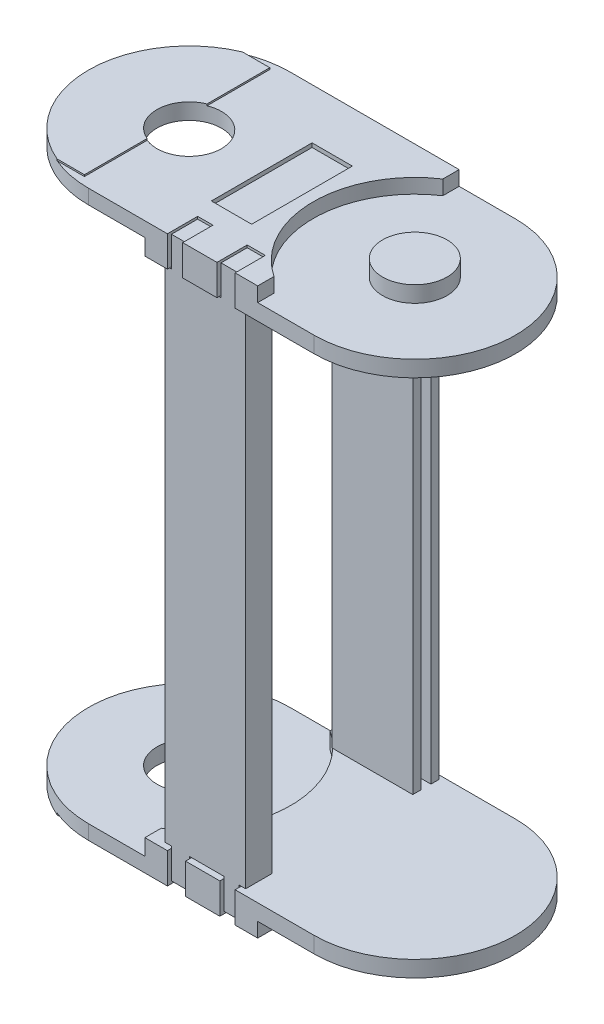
ISO-10303-21;
HEADER;
FILE_DESCRIPTION(('STEP AP214'),'2;1');
FILE_NAME('part.step','',(''),(''),'','','');
FILE_SCHEMA(('AUTOMOTIVE_DESIGN { 1 0 10303 214 1 1 1 1 }'));
ENDSEC;
DATA;
#1=APPLICATION_CONTEXT('core data for automotive mechanical design processes');
#2=APPLICATION_PROTOCOL_DEFINITION('international standard','automotive_design',2000,#1);
#3=PRODUCT_CONTEXT('',#1,'mechanical');
#4=PRODUCT('Part','Part','',(#3));
#5=PRODUCT_RELATED_PRODUCT_CATEGORY('part','',(#4));
#6=PRODUCT_DEFINITION_FORMATION('','',#4);
#7=PRODUCT_DEFINITION_CONTEXT('part definition',#1,'design');
#8=PRODUCT_DEFINITION('design','',#6,#7);
#9=PRODUCT_DEFINITION_SHAPE('','',#8);
#10=(LENGTH_UNIT() NAMED_UNIT(*) SI_UNIT(.MILLI.,.METRE.));
#11=(NAMED_UNIT(*) PLANE_ANGLE_UNIT() SI_UNIT($,.RADIAN.));
#12=(NAMED_UNIT(*) SI_UNIT($,.STERADIAN.) SOLID_ANGLE_UNIT());
#13=UNCERTAINTY_MEASURE_WITH_UNIT(LENGTH_MEASURE(1.E-05),#10,'distance_accuracy_value','');
#14=(GEOMETRIC_REPRESENTATION_CONTEXT(3) GLOBAL_UNCERTAINTY_ASSIGNED_CONTEXT((#13)) GLOBAL_UNIT_ASSIGNED_CONTEXT((#10,
#11,#12)) REPRESENTATION_CONTEXT('',''));
#15=CARTESIAN_POINT('',(0.,0.,0.));
#16=DIRECTION('',(0.,0.,1.));
#17=DIRECTION('',(1.,0.,0.));
#18=AXIS2_PLACEMENT_3D('',#15,#16,#17);
#19=CARTESIAN_POINT('',(-193.1995,124.498,183.5001));
#20=DIRECTION('',(0.,1.,0.));
#21=DIRECTION('',(0.,0.,1.));
#22=AXIS2_PLACEMENT_3D('',#19,#20,#21);
#23=PLANE('',#22);
#24=DIRECTION('',(1.,0.,0.));
#25=VECTOR('',#24,1.);
#26=CARTESIAN_POINT('',(-193.1995,124.498,183.5001));
#27=LINE('',#26,#25);
#28=CARTESIAN_POINT('',(-192.399,124.498,183.5001));
#29=VERTEX_POINT('',#28);
#30=CARTESIAN_POINT('',(-194.,124.498,183.5001));
#31=VERTEX_POINT('',#30);
#32=EDGE_CURVE('P0_E20',#29,#31,#27,.F.);
#33=ORIENTED_EDGE('',*,*,#32,.T.);
#34=DIRECTION('',(0.,0.,1.));
#35=VECTOR('',#34,1.);
#36=CARTESIAN_POINT('',(-194.,124.498,183.5001));
#37=LINE('',#36,#35);
#38=CARTESIAN_POINT('',(-194.,124.498,190.0001));
#39=VERTEX_POINT('',#38);
#40=EDGE_CURVE('P0_E170',#39,#31,#37,.F.);
#41=ORIENTED_EDGE('',*,*,#40,.F.);
#42=DIRECTION('',(1.,0.,0.));
#43=VECTOR('',#42,1.);
#44=CARTESIAN_POINT('',(-184.,124.498,190.0001));
#45=LINE('',#44,#43);
#46=CARTESIAN_POINT('',(-192.399,124.498,190.0001));
#47=VERTEX_POINT('',#46);
#48=EDGE_CURVE('P0_E151',#47,#39,#45,.F.);
#49=ORIENTED_EDGE('',*,*,#48,.F.);
#50=DIRECTION('',(0.,0.,1.));
#51=VECTOR('',#50,1.);
#52=CARTESIAN_POINT('',(-192.399,124.498,183.5001));
#53=LINE('',#52,#51);
#54=EDGE_CURVE('P0_E174',#29,#47,#53,.T.);
#55=ORIENTED_EDGE('',*,*,#54,.F.);
#56=EDGE_LOOP('',(#33,#41,#49,#55));
#57=FACE_BOUND('',#56,.T.);
#58=ADVANCED_FACE('P0_F17',(#57),#23,.T.);
#59=CARTESIAN_POINT('',(-193.1995,0.5,183.5001));
#60=DIRECTION('',(0.,-1.,0.));
#61=DIRECTION('',(0.,0.,-1.));
#62=AXIS2_PLACEMENT_3D('',#59,#60,#61);
#63=PLANE('',#62);
#64=DIRECTION('',(1.,0.,0.));
#65=VECTOR('',#64,1.);
#66=CARTESIAN_POINT('',(-193.1995,0.5,183.5001));
#67=LINE('',#66,#65);
#68=CARTESIAN_POINT('',(-194.,0.5,183.5001));
#69=VERTEX_POINT('',#68);
#70=CARTESIAN_POINT('',(-192.399,0.5,183.5001));
#71=VERTEX_POINT('',#70);
#72=EDGE_CURVE('P0_E190',#69,#71,#67,.T.);
#73=ORIENTED_EDGE('',*,*,#72,.T.);
#74=DIRECTION('',(0.,0.,1.));
#75=VECTOR('',#74,1.);
#76=CARTESIAN_POINT('',(-192.399,0.5,183.5001));
#77=LINE('',#76,#75);
#78=CARTESIAN_POINT('',(-192.399,0.5,190.0001));
#79=VERTEX_POINT('',#78);
#80=EDGE_CURVE('P0_E195',#79,#71,#77,.F.);
#81=ORIENTED_EDGE('',*,*,#80,.F.);
#82=DIRECTION('',(1.,0.,0.));
#83=VECTOR('',#82,1.);
#84=CARTESIAN_POINT('',(-184.,0.5,190.0001));
#85=LINE('',#84,#83);
#86=CARTESIAN_POINT('',(-194.,0.5,190.0001));
#87=VERTEX_POINT('',#86);
#88=EDGE_CURVE('P0_E162',#87,#79,#85,.T.);
#89=ORIENTED_EDGE('',*,*,#88,.F.);
#90=DIRECTION('',(0.,0.,1.));
#91=VECTOR('',#90,1.);
#92=CARTESIAN_POINT('',(-194.,0.5,183.5001));
#93=LINE('',#92,#91);
#94=EDGE_CURVE('P0_E173',#69,#87,#93,.T.);
#95=ORIENTED_EDGE('',*,*,#94,.F.);
#96=EDGE_LOOP('',(#73,#81,#89,#95));
#97=FACE_BOUND('',#96,.T.);
#98=ADVANCED_FACE('P0_F194',(#97),#63,.T.);
#99=CARTESIAN_POINT('',(-174.8005,0.5,183.5001));
#100=DIRECTION('',(0.,-1.,0.));
#101=DIRECTION('',(0.,0.,-1.));
#102=AXIS2_PLACEMENT_3D('',#99,#100,#101);
#103=PLANE('',#102);
#104=DIRECTION('',(1.,0.,0.));
#105=VECTOR('',#104,1.);
#106=CARTESIAN_POINT('',(-174.8005,0.5,183.5001));
#107=LINE('',#106,#105);
#108=CARTESIAN_POINT('',(-175.601,0.5,183.5001));
#109=VERTEX_POINT('',#108);
#110=CARTESIAN_POINT('',(-174.,0.5,183.5001));
#111=VERTEX_POINT('',#110);
#112=EDGE_CURVE('P0_E189',#109,#111,#107,.T.);
#113=ORIENTED_EDGE('',*,*,#112,.T.);
#114=DIRECTION('',(0.,0.,-1.));
#115=VECTOR('',#114,1.);
#116=CARTESIAN_POINT('',(-174.,0.5,183.5001));
#117=LINE('',#116,#115);
#118=CARTESIAN_POINT('',(-174.,0.5,190.0001));
#119=VERTEX_POINT('',#118);
#120=EDGE_CURVE('P0_E254',#119,#111,#117,.T.);
#121=ORIENTED_EDGE('',*,*,#120,.F.);
#122=DIRECTION('',(1.,0.,0.));
#123=VECTOR('',#122,1.);
#124=CARTESIAN_POINT('',(-184.,0.5,190.0001));
#125=LINE('',#124,#123);
#126=CARTESIAN_POINT('',(-175.601,0.5,190.0001));
#127=VERTEX_POINT('',#126);
#128=EDGE_CURVE('P0_E185',#127,#119,#125,.T.);
#129=ORIENTED_EDGE('',*,*,#128,.F.);
#130=DIRECTION('',(0.,0.,-1.));
#131=VECTOR('',#130,1.);
#132=CARTESIAN_POINT('',(-175.601,0.5,183.5001));
#133=LINE('',#132,#131);
#134=EDGE_CURVE('P0_E260',#109,#127,#133,.F.);
#135=ORIENTED_EDGE('',*,*,#134,.F.);
#136=EDGE_LOOP('',(#113,#121,#129,#135));
#137=FACE_BOUND('',#136,.T.);
#138=ADVANCED_FACE('P0_F362',(#137),#103,.T.);
#139=CARTESIAN_POINT('',(-174.8005,124.498,183.5001));
#140=DIRECTION('',(0.,1.,0.));
#141=DIRECTION('',(0.,0.,1.));
#142=AXIS2_PLACEMENT_3D('',#139,#140,#141);
#143=PLANE('',#142);
#144=DIRECTION('',(1.,0.,0.));
#145=VECTOR('',#144,1.);
#146=CARTESIAN_POINT('',(-174.8005,124.498,183.5001));
#147=LINE('',#146,#145);
#148=CARTESIAN_POINT('',(-174.,124.498,183.5001));
#149=VERTEX_POINT('',#148);
#150=CARTESIAN_POINT('',(-175.601,124.498,183.5001));
#151=VERTEX_POINT('',#150);
#152=EDGE_CURVE('P0_E163',#149,#151,#147,.F.);
#153=ORIENTED_EDGE('',*,*,#152,.T.);
#154=DIRECTION('',(0.,0.,-1.));
#155=VECTOR('',#154,1.);
#156=CARTESIAN_POINT('',(-175.601,124.498,183.5001));
#157=LINE('',#156,#155);
#158=CARTESIAN_POINT('',(-175.601,124.498,190.0001));
#159=VERTEX_POINT('',#158);
#160=EDGE_CURVE('P0_E245',#159,#151,#157,.T.);
#161=ORIENTED_EDGE('',*,*,#160,.F.);
#162=DIRECTION('',(1.,0.,0.));
#163=VECTOR('',#162,1.);
#164=CARTESIAN_POINT('',(-184.,124.498,190.0001));
#165=LINE('',#164,#163);
#166=CARTESIAN_POINT('',(-174.,124.498,190.0001));
#167=VERTEX_POINT('',#166);
#168=EDGE_CURVE('P0_E183',#167,#159,#165,.F.);
#169=ORIENTED_EDGE('',*,*,#168,.F.);
#170=DIRECTION('',(0.,0.,-1.));
#171=VECTOR('',#170,1.);
#172=CARTESIAN_POINT('',(-174.,124.498,183.5001));
#173=LINE('',#172,#171);
#174=EDGE_CURVE('P0_E251',#149,#167,#173,.F.);
#175=ORIENTED_EDGE('',*,*,#174,.F.);
#176=EDGE_LOOP('',(#153,#161,#169,#175));
#177=FACE_BOUND('',#176,.T.);
#178=ADVANCED_FACE('P0_F356',(#177),#143,.T.);
#179=CARTESIAN_POINT('',(-184.,62.499,190.0001));
#180=DIRECTION('',(0.,0.,1.));
#181=DIRECTION('',(1.,0.,0.));
#182=AXIS2_PLACEMENT_3D('',#179,#180,#181);
#183=PLANE('',#182);
#184=DIRECTION('',(0.,1.,0.));
#185=VECTOR('',#184,1.);
#186=CARTESIAN_POINT('',(-180.099,128.2485,190.0001));
#187=LINE('',#186,#185);
#188=CARTESIAN_POINT('',(-180.099,124.498,190.0001));
#189=VERTEX_POINT('',#188);
#190=CARTESIAN_POINT('',(-180.099,131.999,190.0001));
#191=VERTEX_POINT('',#190);
#192=EDGE_CURVE('P0_E239',#189,#191,#187,.T.);
#193=ORIENTED_EDGE('',*,*,#192,.F.);
#194=DIRECTION('',(1.,0.,0.));
#195=VECTOR('',#194,1.);
#196=CARTESIAN_POINT('',(-184.35,124.498,190.0001));
#197=LINE('',#196,#195);
#198=CARTESIAN_POINT('',(-188.601,124.498,190.0001));
#199=VERTEX_POINT('',#198);
#200=EDGE_CURVE('P0_E235',#199,#189,#197,.T.);
#201=ORIENTED_EDGE('',*,*,#200,.F.);
#202=DIRECTION('',(0.,1.,0.));
#203=VECTOR('',#202,1.);
#204=CARTESIAN_POINT('',(-188.601,128.2485,190.0001));
#205=LINE('',#204,#203);
#206=CARTESIAN_POINT('',(-188.601,131.999,190.0001));
#207=VERTEX_POINT('',#206);
#208=EDGE_CURVE('P0_E231',#207,#199,#205,.F.);
#209=ORIENTED_EDGE('',*,*,#208,.F.);
#210=DIRECTION('',(1.,0.,0.));
#211=VECTOR('',#210,1.);
#212=CARTESIAN_POINT('',(-190.5,131.999,190.0001));
#213=LINE('',#212,#211);
#214=CARTESIAN_POINT('',(-192.399,131.999,190.0001));
#215=VERTEX_POINT('',#214);
#216=EDGE_CURVE('P0_E227',#215,#207,#213,.T.);
#217=ORIENTED_EDGE('',*,*,#216,.F.);
#218=DIRECTION('',(0.,1.,0.));
#219=VECTOR('',#218,1.);
#220=CARTESIAN_POINT('',(-192.399,128.2485,190.0001));
#221=LINE('',#220,#219);
#222=EDGE_CURVE('P0_E157',#47,#215,#221,.T.);
#223=ORIENTED_EDGE('',*,*,#222,.F.);
#224=ORIENTED_EDGE('',*,*,#48,.T.);
#225=DIRECTION('',(0.,1.,0.));
#226=VECTOR('',#225,1.);
#227=CARTESIAN_POINT('',(-194.,62.499,190.0001));
#228=LINE('',#227,#226);
#229=EDGE_CURVE('P0_E155',#87,#39,#228,.T.);
#230=ORIENTED_EDGE('',*,*,#229,.F.);
#231=ORIENTED_EDGE('',*,*,#88,.T.);
#232=DIRECTION('',(0.,1.,0.));
#233=VECTOR('',#232,1.);
#234=CARTESIAN_POINT('',(-192.399,-3.25050000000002,190.0001));
#235=LINE('',#234,#233);
#236=CARTESIAN_POINT('',(-192.399,-7.001,190.0001));
#237=VERTEX_POINT('',#236);
#238=EDGE_CURVE('P0_E177',#237,#79,#235,.T.);
#239=ORIENTED_EDGE('',*,*,#238,.F.);
#240=DIRECTION('',(1.,0.,0.));
#241=VECTOR('',#240,1.);
#242=CARTESIAN_POINT('',(-190.15,-7.001,190.0001));
#243=LINE('',#242,#241);
#244=CARTESIAN_POINT('',(-187.901,-7.001,190.0001));
#245=VERTEX_POINT('',#244);
#246=EDGE_CURVE('P0_E205',#245,#237,#243,.F.);
#247=ORIENTED_EDGE('',*,*,#246,.F.);
#248=DIRECTION('',(0.,1.,0.));
#249=VECTOR('',#248,1.);
#250=CARTESIAN_POINT('',(-187.901,-3.25050000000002,190.0001));
#251=LINE('',#250,#249);
#252=CARTESIAN_POINT('',(-187.901,0.5,190.0001));
#253=VERTEX_POINT('',#252);
#254=EDGE_CURVE('P0_E281',#253,#245,#251,.F.);
#255=ORIENTED_EDGE('',*,*,#254,.F.);
#256=DIRECTION('',(1.,0.,0.));
#257=VECTOR('',#256,1.);
#258=CARTESIAN_POINT('',(-183.65,0.5,190.0001));
#259=LINE('',#258,#257);
#260=CARTESIAN_POINT('',(-179.399,0.5,190.0001));
#261=VERTEX_POINT('',#260);
#262=EDGE_CURVE('P0_E277',#261,#253,#259,.F.);
#263=ORIENTED_EDGE('',*,*,#262,.F.);
#264=DIRECTION('',(0.,1.,0.));
#265=VECTOR('',#264,1.);
#266=CARTESIAN_POINT('',(-179.399,-3.25050000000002,190.0001));
#267=LINE('',#266,#265);
#268=CARTESIAN_POINT('',(-179.399,-7.001,190.0001));
#269=VERTEX_POINT('',#268);
#270=EDGE_CURVE('P0_E273',#269,#261,#267,.T.);
#271=ORIENTED_EDGE('',*,*,#270,.F.);
#272=DIRECTION('',(1.,0.,0.));
#273=VECTOR('',#272,1.);
#274=CARTESIAN_POINT('',(-177.5,-7.001,190.0001));
#275=LINE('',#274,#273);
#276=CARTESIAN_POINT('',(-175.601,-7.001,190.0001));
#277=VERTEX_POINT('',#276);
#278=EDGE_CURVE('P0_E269',#277,#269,#275,.F.);
#279=ORIENTED_EDGE('',*,*,#278,.F.);
#280=DIRECTION('',(0.,1.,0.));
#281=VECTOR('',#280,1.);
#282=CARTESIAN_POINT('',(-175.601,-3.25050000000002,190.0001));
#283=LINE('',#282,#281);
#284=EDGE_CURVE('P0_E265',#127,#277,#283,.F.);
#285=ORIENTED_EDGE('',*,*,#284,.F.);
#286=ORIENTED_EDGE('',*,*,#128,.T.);
#287=DIRECTION('',(0.,1.,0.));
#288=VECTOR('',#287,1.);
#289=CARTESIAN_POINT('',(-174.,62.499,190.0001));
#290=LINE('',#289,#288);
#291=EDGE_CURVE('P0_E257',#167,#119,#290,.F.);
#292=ORIENTED_EDGE('',*,*,#291,.F.);
#293=ORIENTED_EDGE('',*,*,#168,.T.);
#294=DIRECTION('',(0.,1.,0.));
#295=VECTOR('',#294,1.);
#296=CARTESIAN_POINT('',(-175.601,128.2485,190.0001));
#297=LINE('',#296,#295);
#298=CARTESIAN_POINT('',(-175.601,131.999,190.0001));
#299=VERTEX_POINT('',#298);
#300=EDGE_CURVE('P0_E248',#299,#159,#297,.F.);
#301=ORIENTED_EDGE('',*,*,#300,.F.);
#302=DIRECTION('',(1.,0.,0.));
#303=VECTOR('',#302,1.);
#304=CARTESIAN_POINT('',(-177.85,131.999,190.0001));
#305=LINE('',#304,#303);
#306=EDGE_CURVE('P0_E243',#191,#299,#305,.T.);
#307=ORIENTED_EDGE('',*,*,#306,.F.);
#308=EDGE_LOOP('',(#193,#201,#209,#217,#223,#224,#230,#231,#239,#247,#255,#263,#271,#279,#285,
#286,#292,#293,#301,#307));
#309=FACE_BOUND('',#308,.T.);
#310=ADVANCED_FACE('P0_F154',(#309),#183,.T.);
#311=CARTESIAN_POINT('',(-192.399,128.2485,183.5001));
#312=DIRECTION('',(-1.,0.,0.));
#313=DIRECTION('',(0.,0.,1.));
#314=AXIS2_PLACEMENT_3D('',#311,#312,#313);
#315=PLANE('',#314);
#316=DIRECTION('',(0.,1.,0.));
#317=VECTOR('',#316,1.);
#318=CARTESIAN_POINT('',(-192.399,62.499,183.5001));
#319=LINE('',#318,#317);
#320=CARTESIAN_POINT('',(-192.399,131.999,183.5001));
#321=VERTEX_POINT('',#320);
#322=EDGE_CURVE('P0_E217',#321,#29,#319,.F.);
#323=ORIENTED_EDGE('',*,*,#322,.T.);
#324=ORIENTED_EDGE('',*,*,#54,.T.);
#325=ORIENTED_EDGE('',*,*,#222,.T.);
#326=DIRECTION('',(0.,0.,1.));
#327=VECTOR('',#326,1.);
#328=CARTESIAN_POINT('',(-192.399,131.999,183.5001));
#329=LINE('',#328,#327);
#330=EDGE_CURVE('P0_E223',#321,#215,#329,.T.);
#331=ORIENTED_EDGE('',*,*,#330,.F.);
#332=EDGE_LOOP('',(#323,#324,#325,#331));
#333=FACE_BOUND('',#332,.T.);
#334=ADVANCED_FACE('P0_F504',(#333),#315,.T.);
#335=CARTESIAN_POINT('',(-194.,62.499,183.5001));
#336=DIRECTION('',(-1.,0.,0.));
#337=DIRECTION('',(0.,0.,1.));
#338=AXIS2_PLACEMENT_3D('',#335,#336,#337);
#339=PLANE('',#338);
#340=DIRECTION('',(0.,1.,0.));
#341=VECTOR('',#340,1.);
#342=CARTESIAN_POINT('',(-194.,62.499,183.5001));
#343=LINE('',#342,#341);
#344=EDGE_CURVE('P0_E213',#31,#69,#343,.F.);
#345=ORIENTED_EDGE('',*,*,#344,.T.);
#346=ORIENTED_EDGE('',*,*,#94,.T.);
#347=ORIENTED_EDGE('',*,*,#229,.T.);
#348=ORIENTED_EDGE('',*,*,#40,.T.);
#349=EDGE_LOOP('',(#345,#346,#347,#348));
#350=FACE_BOUND('',#349,.T.);
#351=ADVANCED_FACE('P0_F169',(#350),#339,.T.);
#352=CARTESIAN_POINT('',(-192.399,-3.25050000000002,183.5001));
#353=DIRECTION('',(-1.,0.,0.));
#354=DIRECTION('',(0.,0.,1.));
#355=AXIS2_PLACEMENT_3D('',#352,#353,#354);
#356=PLANE('',#355);
#357=DIRECTION('',(0.,1.,0.));
#358=VECTOR('',#357,1.);
#359=CARTESIAN_POINT('',(-192.399,62.499,183.5001));
#360=LINE('',#359,#358);
#361=CARTESIAN_POINT('',(-192.399,-7.001,183.5001));
#362=VERTEX_POINT('',#361);
#363=EDGE_CURVE('P0_E203',#71,#362,#360,.F.);
#364=ORIENTED_EDGE('',*,*,#363,.T.);
#365=DIRECTION('',(0.,0.,-1.));
#366=VECTOR('',#365,1.);
#367=CARTESIAN_POINT('',(-192.399,-7.001,183.5001));
#368=LINE('',#367,#366);
#369=EDGE_CURVE('P0_E283',#237,#362,#368,.T.);
#370=ORIENTED_EDGE('',*,*,#369,.F.);
#371=ORIENTED_EDGE('',*,*,#238,.T.);
#372=ORIENTED_EDGE('',*,*,#80,.T.);
#373=EDGE_LOOP('',(#364,#370,#371,#372));
#374=FACE_BOUND('',#373,.T.);
#375=ADVANCED_FACE('P0_F201',(#374),#356,.T.);
#376=CARTESIAN_POINT('',(-190.15,-7.001,183.5001));
#377=DIRECTION('',(0.,-1.,0.));
#378=DIRECTION('',(0.,0.,-1.));
#379=AXIS2_PLACEMENT_3D('',#376,#377,#378);
#380=PLANE('',#379);
#381=DIRECTION('',(1.,0.,0.));
#382=VECTOR('',#381,1.);
#383=CARTESIAN_POINT('',(-184.,-7.001,183.5001));
#384=LINE('',#383,#382);
#385=CARTESIAN_POINT('',(-187.901,-7.001,183.5001));
#386=VERTEX_POINT('',#385);
#387=EDGE_CURVE('P0_E212',#362,#386,#384,.T.);
#388=ORIENTED_EDGE('',*,*,#387,.T.);
#389=DIRECTION('',(0.,0.,-1.));
#390=VECTOR('',#389,1.);
#391=CARTESIAN_POINT('',(-187.901,-7.001,183.5001));
#392=LINE('',#391,#390);
#393=EDGE_CURVE('P0_E279',#245,#386,#392,.T.);
#394=ORIENTED_EDGE('',*,*,#393,.F.);
#395=ORIENTED_EDGE('',*,*,#246,.T.);
#396=ORIENTED_EDGE('',*,*,#369,.T.);
#397=EDGE_LOOP('',(#388,#394,#395,#396));
#398=FACE_BOUND('',#397,.T.);
#399=ADVANCED_FACE('P0_F288',(#398),#380,.T.);
#400=CARTESIAN_POINT('',(-187.901,-3.25050000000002,183.5001));
#401=DIRECTION('',(1.,0.,0.));
#402=DIRECTION('',(0.,0.,-1.));
#403=AXIS2_PLACEMENT_3D('',#400,#401,#402);
#404=PLANE('',#403);
#405=DIRECTION('',(0.,1.,0.));
#406=VECTOR('',#405,1.);
#407=CARTESIAN_POINT('',(-187.901,62.499,183.5001));
#408=LINE('',#407,#406);
#409=CARTESIAN_POINT('',(-187.901,0.5,183.5001));
#410=VERTEX_POINT('',#409);
#411=EDGE_CURVE('P0_E215',#386,#410,#408,.T.);
#412=ORIENTED_EDGE('',*,*,#411,.T.);
#413=DIRECTION('',(0.,0.,-1.));
#414=VECTOR('',#413,1.);
#415=CARTESIAN_POINT('',(-187.901,0.5,183.5001));
#416=LINE('',#415,#414);
#417=EDGE_CURVE('P0_E275',#253,#410,#416,.T.);
#418=ORIENTED_EDGE('',*,*,#417,.F.);
#419=ORIENTED_EDGE('',*,*,#254,.T.);
#420=ORIENTED_EDGE('',*,*,#393,.T.);
#421=EDGE_LOOP('',(#412,#418,#419,#420));
#422=FACE_BOUND('',#421,.T.);
#423=ADVANCED_FACE('P0_F296',(#422),#404,.T.);
#424=CARTESIAN_POINT('',(-183.65,0.5,183.5001));
#425=DIRECTION('',(0.,-1.,0.));
#426=DIRECTION('',(0.,0.,-1.));
#427=AXIS2_PLACEMENT_3D('',#424,#425,#426);
#428=PLANE('',#427);
#429=DIRECTION('',(1.,0.,0.));
#430=VECTOR('',#429,1.);
#431=CARTESIAN_POINT('',(-184.,0.5,183.5001));
#432=LINE('',#431,#430);
#433=CARTESIAN_POINT('',(-179.399,0.5,183.5001));
#434=VERTEX_POINT('',#433);
#435=EDGE_CURVE('P0_E301',#410,#434,#432,.T.);
#436=ORIENTED_EDGE('',*,*,#435,.T.);
#437=DIRECTION('',(0.,0.,1.));
#438=VECTOR('',#437,1.);
#439=CARTESIAN_POINT('',(-179.399,0.5,183.5001));
#440=LINE('',#439,#438);
#441=EDGE_CURVE('P0_E271',#261,#434,#440,.F.);
#442=ORIENTED_EDGE('',*,*,#441,.F.);
#443=ORIENTED_EDGE('',*,*,#262,.T.);
#444=ORIENTED_EDGE('',*,*,#417,.T.);
#445=EDGE_LOOP('',(#436,#442,#443,#444));
#446=FACE_BOUND('',#445,.T.);
#447=ADVANCED_FACE('P0_F300',(#446),#428,.T.);
#448=CARTESIAN_POINT('',(-179.399,-3.25050000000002,183.5001));
#449=DIRECTION('',(-1.,0.,0.));
#450=DIRECTION('',(0.,0.,1.));
#451=AXIS2_PLACEMENT_3D('',#448,#449,#450);
#452=PLANE('',#451);
#453=DIRECTION('',(0.,1.,0.));
#454=VECTOR('',#453,1.);
#455=CARTESIAN_POINT('',(-179.399,62.499,183.5001));
#456=LINE('',#455,#454);
#457=CARTESIAN_POINT('',(-179.399,-7.001,183.5001));
#458=VERTEX_POINT('',#457);
#459=EDGE_CURVE('P0_E305',#434,#458,#456,.F.);
#460=ORIENTED_EDGE('',*,*,#459,.T.);
#461=DIRECTION('',(0.,0.,-1.));
#462=VECTOR('',#461,1.);
#463=CARTESIAN_POINT('',(-179.399,-7.001,183.5001));
#464=LINE('',#463,#462);
#465=EDGE_CURVE('P0_E267',#269,#458,#464,.T.);
#466=ORIENTED_EDGE('',*,*,#465,.F.);
#467=ORIENTED_EDGE('',*,*,#270,.T.);
#468=ORIENTED_EDGE('',*,*,#441,.T.);
#469=EDGE_LOOP('',(#460,#466,#467,#468));
#470=FACE_BOUND('',#469,.T.);
#471=ADVANCED_FACE('P0_F372',(#470),#452,.T.);
#472=CARTESIAN_POINT('',(-177.5,-7.001,183.5001));
#473=DIRECTION('',(0.,-1.,0.));
#474=DIRECTION('',(0.,0.,-1.));
#475=AXIS2_PLACEMENT_3D('',#472,#473,#474);
#476=PLANE('',#475);
#477=DIRECTION('',(1.,0.,0.));
#478=VECTOR('',#477,1.);
#479=CARTESIAN_POINT('',(-184.,-7.001,183.5001));
#480=LINE('',#479,#478);
#481=CARTESIAN_POINT('',(-175.601,-7.001,183.5001));
#482=VERTEX_POINT('',#481);
#483=EDGE_CURVE('P0_E307',#458,#482,#480,.T.);
#484=ORIENTED_EDGE('',*,*,#483,.T.);
#485=DIRECTION('',(0.,0.,-1.));
#486=VECTOR('',#485,1.);
#487=CARTESIAN_POINT('',(-175.601,-7.001,183.5001));
#488=LINE('',#487,#486);
#489=EDGE_CURVE('P0_E263',#277,#482,#488,.T.);
#490=ORIENTED_EDGE('',*,*,#489,.F.);
#491=ORIENTED_EDGE('',*,*,#278,.T.);
#492=ORIENTED_EDGE('',*,*,#465,.T.);
#493=EDGE_LOOP('',(#484,#490,#491,#492));
#494=FACE_BOUND('',#493,.T.);
#495=ADVANCED_FACE('P0_F368',(#494),#476,.T.);
#496=CARTESIAN_POINT('',(-175.601,-3.25050000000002,183.5001));
#497=DIRECTION('',(1.,0.,0.));
#498=DIRECTION('',(0.,0.,-1.));
#499=AXIS2_PLACEMENT_3D('',#496,#497,#498);
#500=PLANE('',#499);
#501=DIRECTION('',(0.,1.,0.));
#502=VECTOR('',#501,1.);
#503=CARTESIAN_POINT('',(-175.601,62.499,183.5001));
#504=LINE('',#503,#502);
#505=EDGE_CURVE('P0_E312',#482,#109,#504,.T.);
#506=ORIENTED_EDGE('',*,*,#505,.T.);
#507=ORIENTED_EDGE('',*,*,#134,.T.);
#508=ORIENTED_EDGE('',*,*,#284,.T.);
#509=ORIENTED_EDGE('',*,*,#489,.T.);
#510=EDGE_LOOP('',(#506,#507,#508,#509));
#511=FACE_BOUND('',#510,.T.);
#512=ADVANCED_FACE('P0_F374',(#511),#500,.T.);
#513=CARTESIAN_POINT('',(-174.,62.499,183.5001));
#514=DIRECTION('',(1.,0.,0.));
#515=DIRECTION('',(0.,0.,-1.));
#516=AXIS2_PLACEMENT_3D('',#513,#514,#515);
#517=PLANE('',#516);
#518=DIRECTION('',(0.,1.,0.));
#519=VECTOR('',#518,1.);
#520=CARTESIAN_POINT('',(-174.,62.499,183.5001));
#521=LINE('',#520,#519);
#522=EDGE_CURVE('P0_E315',#111,#149,#521,.T.);
#523=ORIENTED_EDGE('',*,*,#522,.T.);
#524=ORIENTED_EDGE('',*,*,#174,.T.);
#525=ORIENTED_EDGE('',*,*,#291,.T.);
#526=ORIENTED_EDGE('',*,*,#120,.T.);
#527=EDGE_LOOP('',(#523,#524,#525,#526));
#528=FACE_BOUND('',#527,.T.);
#529=ADVANCED_FACE('P0_F359',(#528),#517,.T.);
#530=CARTESIAN_POINT('',(-175.601,128.2485,183.5001));
#531=DIRECTION('',(1.,0.,0.));
#532=DIRECTION('',(0.,0.,-1.));
#533=AXIS2_PLACEMENT_3D('',#530,#531,#532);
#534=PLANE('',#533);
#535=DIRECTION('',(0.,1.,0.));
#536=VECTOR('',#535,1.);
#537=CARTESIAN_POINT('',(-175.601,62.499,183.5001));
#538=LINE('',#537,#536);
#539=CARTESIAN_POINT('',(-175.601,131.999,183.5001));
#540=VERTEX_POINT('',#539);
#541=EDGE_CURVE('P0_E318',#151,#540,#538,.T.);
#542=ORIENTED_EDGE('',*,*,#541,.T.);
#543=DIRECTION('',(0.,0.,1.));
#544=VECTOR('',#543,1.);
#545=CARTESIAN_POINT('',(-175.601,131.999,183.5001));
#546=LINE('',#545,#544);
#547=EDGE_CURVE('P0_E241',#299,#540,#546,.F.);
#548=ORIENTED_EDGE('',*,*,#547,.F.);
#549=ORIENTED_EDGE('',*,*,#300,.T.);
#550=ORIENTED_EDGE('',*,*,#160,.T.);
#551=EDGE_LOOP('',(#542,#548,#549,#550));
#552=FACE_BOUND('',#551,.T.);
#553=ADVANCED_FACE('P0_F351',(#552),#534,.T.);
#554=CARTESIAN_POINT('',(-177.85,131.999,183.5001));
#555=DIRECTION('',(0.,1.,0.));
#556=DIRECTION('',(0.,0.,1.));
#557=AXIS2_PLACEMENT_3D('',#554,#555,#556);
#558=PLANE('',#557);
#559=DIRECTION('',(1.,0.,0.));
#560=VECTOR('',#559,1.);
#561=CARTESIAN_POINT('',(-184.,131.999,183.5001));
#562=LINE('',#561,#560);
#563=CARTESIAN_POINT('',(-180.099,131.999,183.5001));
#564=VERTEX_POINT('',#563);
#565=EDGE_CURVE('P0_E321',#540,#564,#562,.F.);
#566=ORIENTED_EDGE('',*,*,#565,.T.);
#567=DIRECTION('',(0.,0.,1.));
#568=VECTOR('',#567,1.);
#569=CARTESIAN_POINT('',(-180.099,131.999,183.5001));
#570=LINE('',#569,#568);
#571=EDGE_CURVE('P0_E237',#191,#564,#570,.F.);
#572=ORIENTED_EDGE('',*,*,#571,.F.);
#573=ORIENTED_EDGE('',*,*,#306,.T.);
#574=ORIENTED_EDGE('',*,*,#547,.T.);
#575=EDGE_LOOP('',(#566,#572,#573,#574));
#576=FACE_BOUND('',#575,.T.);
#577=ADVANCED_FACE('P0_F347',(#576),#558,.T.);
#578=CARTESIAN_POINT('',(-180.099,128.2485,183.5001));
#579=DIRECTION('',(-1.,0.,0.));
#580=DIRECTION('',(0.,0.,1.));
#581=AXIS2_PLACEMENT_3D('',#578,#579,#580);
#582=PLANE('',#581);
#583=DIRECTION('',(0.,1.,0.));
#584=VECTOR('',#583,1.);
#585=CARTESIAN_POINT('',(-180.099,62.499,183.5001));
#586=LINE('',#585,#584);
#587=CARTESIAN_POINT('',(-180.099,124.498,183.5001));
#588=VERTEX_POINT('',#587);
#589=EDGE_CURVE('P0_E324',#564,#588,#586,.F.);
#590=ORIENTED_EDGE('',*,*,#589,.T.);
#591=DIRECTION('',(0.,0.,1.));
#592=VECTOR('',#591,1.);
#593=CARTESIAN_POINT('',(-180.099,124.498,183.5001));
#594=LINE('',#593,#592);
#595=EDGE_CURVE('P0_E233',#189,#588,#594,.F.);
#596=ORIENTED_EDGE('',*,*,#595,.F.);
#597=ORIENTED_EDGE('',*,*,#192,.T.);
#598=ORIENTED_EDGE('',*,*,#571,.T.);
#599=EDGE_LOOP('',(#590,#596,#597,#598));
#600=FACE_BOUND('',#599,.T.);
#601=ADVANCED_FACE('P0_F341',(#600),#582,.T.);
#602=CARTESIAN_POINT('',(-184.35,124.498,183.5001));
#603=DIRECTION('',(0.,1.,0.));
#604=DIRECTION('',(0.,0.,1.));
#605=AXIS2_PLACEMENT_3D('',#602,#603,#604);
#606=PLANE('',#605);
#607=DIRECTION('',(1.,0.,0.));
#608=VECTOR('',#607,1.);
#609=CARTESIAN_POINT('',(-184.,124.498,183.5001));
#610=LINE('',#609,#608);
#611=CARTESIAN_POINT('',(-188.601,124.498,183.5001));
#612=VERTEX_POINT('',#611);
#613=EDGE_CURVE('P0_E327',#588,#612,#610,.F.);
#614=ORIENTED_EDGE('',*,*,#613,.T.);
#615=DIRECTION('',(0.,0.,-1.));
#616=VECTOR('',#615,1.);
#617=CARTESIAN_POINT('',(-188.601,124.498,183.5001));
#618=LINE('',#617,#616);
#619=EDGE_CURVE('P0_E229',#199,#612,#618,.T.);
#620=ORIENTED_EDGE('',*,*,#619,.F.);
#621=ORIENTED_EDGE('',*,*,#200,.T.);
#622=ORIENTED_EDGE('',*,*,#595,.T.);
#623=EDGE_LOOP('',(#614,#620,#621,#622));
#624=FACE_BOUND('',#623,.T.);
#625=ADVANCED_FACE('P0_F337',(#624),#606,.T.);
#626=CARTESIAN_POINT('',(-188.601,128.2485,183.5001));
#627=DIRECTION('',(1.,0.,0.));
#628=DIRECTION('',(0.,0.,-1.));
#629=AXIS2_PLACEMENT_3D('',#626,#627,#628);
#630=PLANE('',#629);
#631=DIRECTION('',(0.,1.,0.));
#632=VECTOR('',#631,1.);
#633=CARTESIAN_POINT('',(-188.601,62.499,183.5001));
#634=LINE('',#633,#632);
#635=CARTESIAN_POINT('',(-188.601,131.999,183.5001));
#636=VERTEX_POINT('',#635);
#637=EDGE_CURVE('P0_E26',#612,#636,#634,.T.);
#638=ORIENTED_EDGE('',*,*,#637,.T.);
#639=DIRECTION('',(0.,0.,1.));
#640=VECTOR('',#639,1.);
#641=CARTESIAN_POINT('',(-188.601,131.999,183.5001));
#642=LINE('',#641,#640);
#643=EDGE_CURVE('P0_E34',#207,#636,#642,.F.);
#644=ORIENTED_EDGE('',*,*,#643,.F.);
#645=ORIENTED_EDGE('',*,*,#208,.T.);
#646=ORIENTED_EDGE('',*,*,#619,.T.);
#647=EDGE_LOOP('',(#638,#644,#645,#646));
#648=FACE_BOUND('',#647,.T.);
#649=ADVANCED_FACE('P0_F332',(#648),#630,.T.);
#650=CARTESIAN_POINT('',(-190.5,131.999,183.5001));
#651=DIRECTION('',(0.,1.,0.));
#652=DIRECTION('',(0.,0.,1.));
#653=AXIS2_PLACEMENT_3D('',#650,#651,#652);
#654=PLANE('',#653);
#655=DIRECTION('',(1.,0.,0.));
#656=VECTOR('',#655,1.);
#657=CARTESIAN_POINT('',(-184.,131.999,183.5001));
#658=LINE('',#657,#656);
#659=EDGE_CURVE('P0_E11',#636,#321,#658,.F.);
#660=ORIENTED_EDGE('',*,*,#659,.T.);
#661=ORIENTED_EDGE('',*,*,#330,.T.);
#662=ORIENTED_EDGE('',*,*,#216,.T.);
#663=ORIENTED_EDGE('',*,*,#643,.T.);
#664=EDGE_LOOP('',(#660,#661,#662,#663));
#665=FACE_BOUND('',#664,.T.);
#666=ADVANCED_FACE('P0_F385',(#665),#654,.T.);
#667=CARTESIAN_POINT('',(-184.,62.499,183.5001));
#668=DIRECTION('',(0.,0.,1.));
#669=DIRECTION('',(1.,0.,0.));
#670=AXIS2_PLACEMENT_3D('',#667,#668,#669);
#671=PLANE('',#670);
#672=ORIENTED_EDGE('',*,*,#637,.F.);
#673=ORIENTED_EDGE('',*,*,#613,.F.);
#674=ORIENTED_EDGE('',*,*,#589,.F.);
#675=ORIENTED_EDGE('',*,*,#565,.F.);
#676=ORIENTED_EDGE('',*,*,#541,.F.);
#677=ORIENTED_EDGE('',*,*,#152,.F.);
#678=ORIENTED_EDGE('',*,*,#522,.F.);
#679=ORIENTED_EDGE('',*,*,#112,.F.);
#680=ORIENTED_EDGE('',*,*,#505,.F.);
#681=ORIENTED_EDGE('',*,*,#483,.F.);
#682=ORIENTED_EDGE('',*,*,#459,.F.);
#683=ORIENTED_EDGE('',*,*,#435,.F.);
#684=ORIENTED_EDGE('',*,*,#411,.F.);
#685=ORIENTED_EDGE('',*,*,#387,.F.);
#686=ORIENTED_EDGE('',*,*,#363,.F.);
#687=ORIENTED_EDGE('',*,*,#72,.F.);
#688=ORIENTED_EDGE('',*,*,#344,.F.);
#689=ORIENTED_EDGE('',*,*,#32,.F.);
#690=ORIENTED_EDGE('',*,*,#322,.F.);
#691=ORIENTED_EDGE('',*,*,#659,.F.);
#692=EDGE_LOOP('',(#672,#673,#674,#675,#676,#677,#678,#679,#680,#681,#682,#683,#684,#685,#686,
#687,#688,#689,#690,#691));
#693=FACE_BOUND('',#692,.T.);
#694=ADVANCED_FACE('P0_F209',(#693),#671,.F.);
#695=CLOSED_SHELL('',(#58,#98,#138,#178,#310,#334,#351,#375,#399,#423,#447,#471,#495,#512,#529,
#553,#577,#601,#625,#649,#666,#694));
#696=MANIFOLD_SOLID_BREP('P0_B1',#695);
#697=CARTESIAN_POINT('',(-156.,-8.,166.));
#698=DIRECTION('',(0.,-1.,0.));
#699=DIRECTION('',(0.,0.,-1.));
#700=AXIS2_PLACEMENT_3D('',#697,#698,#699);
#701=PLANE('',#700);
#702=CARTESIAN_POINT('',(-156.,-8.,166.));
#703=DIRECTION('',(0.,-1.,0.));
#704=DIRECTION('',(0.,0.,-1.));
#705=AXIS2_PLACEMENT_3D('',#702,#703,#704);
#706=CIRCLE('',#705,8.);
#707=CARTESIAN_POINT('',(-156.,-8.,158.));
#708=VERTEX_POINT('',#707);
#709=EDGE_CURVE('P1_E20',#708,#708,#706,.F.);
#710=ORIENTED_EDGE('',*,*,#709,.F.);
#711=EDGE_LOOP('',(#710));
#712=FACE_BOUND('',#711,.T.);
#713=ADVANCED_FACE('P1_F17',(#712),#701,.T.);
#714=CARTESIAN_POINT('',(-189.,-6.6,166.));
#715=DIRECTION('',(0.,1.,0.));
#716=DIRECTION('',(0.,0.,1.));
#717=AXIS2_PLACEMENT_3D('',#714,#715,#716);
#718=PLANE('',#717);
#719=DIRECTION('',(-1.,0.,0.));
#720=VECTOR('',#719,1.);
#721=CARTESIAN_POINT('',(-189.,-6.6,178.5));
#722=LINE('',#721,#720);
#723=CARTESIAN_POINT('',(-194.,-6.6,178.5));
#724=VERTEX_POINT('',#723);
#725=CARTESIAN_POINT('',(-184.,-6.6,178.5));
#726=VERTEX_POINT('',#725);
#727=EDGE_CURVE('P1_E502',#724,#726,#722,.F.);
#728=ORIENTED_EDGE('',*,*,#727,.F.);
#729=DIRECTION('',(0.,0.,-1.));
#730=VECTOR('',#729,1.);
#731=CARTESIAN_POINT('',(-194.,-6.6,166.));
#732=LINE('',#731,#730);
#733=CARTESIAN_POINT('',(-194.,-6.6,153.5));
#734=VERTEX_POINT('',#733);
#735=EDGE_CURVE('P1_E520',#734,#724,#732,.F.);
#736=ORIENTED_EDGE('',*,*,#735,.F.);
#737=DIRECTION('',(1.,0.,0.));
#738=VECTOR('',#737,1.);
#739=CARTESIAN_POINT('',(-189.,-6.6,153.5));
#740=LINE('',#739,#738);
#741=CARTESIAN_POINT('',(-184.,-6.6,153.5));
#742=VERTEX_POINT('',#741);
#743=EDGE_CURVE('P1_E517',#742,#734,#740,.F.);
#744=ORIENTED_EDGE('',*,*,#743,.F.);
#745=DIRECTION('',(0.,0.,1.));
#746=VECTOR('',#745,1.);
#747=CARTESIAN_POINT('',(-184.,-6.6,166.));
#748=LINE('',#747,#746);
#749=EDGE_CURVE('P1_E511',#726,#742,#748,.F.);
#750=ORIENTED_EDGE('',*,*,#749,.F.);
#751=EDGE_LOOP('',(#728,#736,#744,#750));
#752=FACE_BOUND('',#751,.T.);
#753=ADVANCED_FACE('P1_F668',(#752),#718,.F.);
#754=CARTESIAN_POINT('',(-156.,-6.,166.));
#755=DIRECTION('',(0.,-1.,0.));
#756=DIRECTION('',(0.,0.,-1.));
#757=AXIS2_PLACEMENT_3D('',#754,#755,#756);
#758=CYLINDRICAL_SURFACE('',#757,8.);
#759=ORIENTED_EDGE('',*,*,#709,.T.);
#760=EDGE_LOOP('',(#759));
#761=FACE_BOUND('',#760,.T.);
#762=CARTESIAN_POINT('',(-156.,-4.,166.));
#763=DIRECTION('',(0.,-1.,0.));
#764=DIRECTION('',(0.,0.,-1.));
#765=AXIS2_PLACEMENT_3D('',#762,#763,#764);
#766=CIRCLE('',#765,8.);
#767=CARTESIAN_POINT('',(-156.,-4.,158.));
#768=VERTEX_POINT('',#767);
#769=EDGE_CURVE('P1_E428',#768,#768,#766,.T.);
#770=ORIENTED_EDGE('',*,*,#769,.T.);
#771=EDGE_LOOP('',(#770));
#772=FACE_BOUND('',#771,.T.);
#773=ADVANCED_FACE('P1_F666',(#761,#772),#758,.T.);
#774=CARTESIAN_POINT('',(-156.,-6.,166.));
#775=DIRECTION('',(0.,-1.,0.));
#776=DIRECTION('',(0.,0.,-1.));
#777=AXIS2_PLACEMENT_3D('',#774,#775,#776);
#778=CYLINDRICAL_SURFACE('',#777,25.2);
#779=CARTESIAN_POINT('',(-156.,-7.6,166.));
#780=DIRECTION('',(0.,-1.,0.));
#781=DIRECTION('',(0.,0.,-1.));
#782=AXIS2_PLACEMENT_3D('',#779,#780,#781);
#783=CIRCLE('',#782,25.2);
#784=CARTESIAN_POINT('',(-170.,-7.6,186.953281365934));
#785=VERTEX_POINT('',#784);
#786=CARTESIAN_POINT('',(-170.,-7.6,145.046718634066));
#787=VERTEX_POINT('',#786);
#788=EDGE_CURVE('P1_E403',#785,#787,#783,.T.);
#789=ORIENTED_EDGE('',*,*,#788,.T.);
#790=DIRECTION('',(0.,1.,0.));
#791=VECTOR('',#790,1.);
#792=CARTESIAN_POINT('',(-170.,-6.,145.046718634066));
#793=LINE('',#792,#791);
#794=CARTESIAN_POINT('',(-170.,-4.,145.046718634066));
#795=VERTEX_POINT('',#794);
#796=EDGE_CURVE('P1_E409',#795,#787,#793,.F.);
#797=ORIENTED_EDGE('',*,*,#796,.F.);
#798=CARTESIAN_POINT('',(-156.,-4.,166.));
#799=DIRECTION('',(0.,-1.,0.));
#800=DIRECTION('',(0.,0.,-1.));
#801=AXIS2_PLACEMENT_3D('',#798,#799,#800);
#802=CIRCLE('',#801,25.2);
#803=CARTESIAN_POINT('',(-170.,-4.,186.953281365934));
#804=VERTEX_POINT('',#803);
#805=EDGE_CURVE('P1_E419',#795,#804,#802,.F.);
#806=ORIENTED_EDGE('',*,*,#805,.T.);
#807=DIRECTION('',(0.,1.,0.));
#808=VECTOR('',#807,1.);
#809=CARTESIAN_POINT('',(-170.,-6.,186.953281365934));
#810=LINE('',#809,#808);
#811=EDGE_CURVE('P1_E526',#785,#804,#810,.T.);
#812=ORIENTED_EDGE('',*,*,#811,.F.);
#813=EDGE_LOOP('',(#789,#797,#806,#812));
#814=FACE_BOUND('',#813,.T.);
#815=ADVANCED_FACE('P1_F595',(#814),#778,.F.);
#816=CARTESIAN_POINT('',(-210.5,-7.8,143.));
#817=DIRECTION('',(0.,0.,-1.));
#818=DIRECTION('',(-1.,0.,0.));
#819=AXIS2_PLACEMENT_3D('',#816,#817,#818);
#820=PLANE('',#819);
#821=DIRECTION('',(0.,1.,0.));
#822=VECTOR('',#821,1.);
#823=CARTESIAN_POINT('',(-215.,-7.8,143.));
#824=LINE('',#823,#822);
#825=CARTESIAN_POINT('',(-215.,-8.,143.));
#826=VERTEX_POINT('',#825);
#827=CARTESIAN_POINT('',(-215.,-7.6,143.));
#828=VERTEX_POINT('',#827);
#829=EDGE_CURVE('P1_E133',#826,#828,#824,.T.);
#830=ORIENTED_EDGE('',*,*,#829,.F.);
#831=DIRECTION('',(1.,0.,0.));
#832=VECTOR('',#831,1.);
#833=CARTESIAN_POINT('',(-183.999999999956,-8.,143.));
#834=LINE('',#833,#832);
#835=CARTESIAN_POINT('',(-221.797958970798,-8.,143.));
#836=VERTEX_POINT('',#835);
#837=EDGE_CURVE('P1_E482',#826,#836,#834,.F.);
#838=ORIENTED_EDGE('',*,*,#837,.T.);
#839=DIRECTION('',(0.,1.,0.));
#840=VECTOR('',#839,1.);
#841=CARTESIAN_POINT('',(-221.797958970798,-7.8,143.));
#842=LINE('',#841,#840);
#843=CARTESIAN_POINT('',(-221.797958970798,-7.6,143.));
#844=VERTEX_POINT('',#843);
#845=EDGE_CURVE('P1_E535',#836,#844,#842,.T.);
#846=ORIENTED_EDGE('',*,*,#845,.T.);
#847=DIRECTION('',(1.,0.,0.));
#848=VECTOR('',#847,1.);
#849=CARTESIAN_POINT('',(-162.,-7.6,143.));
#850=LINE('',#849,#848);
#851=EDGE_CURVE('P1_E395',#844,#828,#850,.T.);
#852=ORIENTED_EDGE('',*,*,#851,.T.);
#853=EDGE_LOOP('',(#830,#838,#846,#852));
#854=FACE_BOUND('',#853,.T.);
#855=ADVANCED_FACE('P1_F584',(#854),#820,.T.);
#856=CARTESIAN_POINT('',(-215.,-7.8,166.));
#857=DIRECTION('',(1.,0.,0.));
#858=DIRECTION('',(0.,0.,-1.));
#859=AXIS2_PLACEMENT_3D('',#856,#857,#858);
#860=PLANE('',#859);
#861=DIRECTION('',(0.,1.,0.));
#862=VECTOR('',#861,1.);
#863=CARTESIAN_POINT('',(-215.,-4.,158.573015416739));
#864=LINE('',#863,#862);
#865=CARTESIAN_POINT('',(-215.,-7.6,158.573015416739));
#866=VERTEX_POINT('',#865);
#867=CARTESIAN_POINT('',(-215.,-8.,158.573015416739));
#868=VERTEX_POINT('',#867);
#869=EDGE_CURVE('P1_E484',#866,#868,#864,.F.);
#870=ORIENTED_EDGE('',*,*,#869,.T.);
#871=DIRECTION('',(0.,0.,1.));
#872=VECTOR('',#871,1.);
#873=CARTESIAN_POINT('',(-215.,-8.,165.999999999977));
#874=LINE('',#873,#872);
#875=EDGE_CURVE('P1_E485',#868,#826,#874,.F.);
#876=ORIENTED_EDGE('',*,*,#875,.T.);
#877=ORIENTED_EDGE('',*,*,#829,.T.);
#878=DIRECTION('',(0.,0.,1.));
#879=VECTOR('',#878,1.);
#880=CARTESIAN_POINT('',(-215.,-7.6,166.));
#881=LINE('',#880,#879);
#882=EDGE_CURVE('P1_E392',#828,#866,#881,.T.);
#883=ORIENTED_EDGE('',*,*,#882,.T.);
#884=EDGE_LOOP('',(#870,#876,#877,#883));
#885=FACE_BOUND('',#884,.T.);
#886=ADVANCED_FACE('P1_F747',(#885),#860,.T.);
#887=CARTESIAN_POINT('',(-215.,-7.8,166.));
#888=DIRECTION('',(1.,0.,0.));
#889=DIRECTION('',(0.,0.,-1.));
#890=AXIS2_PLACEMENT_3D('',#887,#888,#889);
#891=PLANE('',#890);
#892=DIRECTION('',(0.,1.,0.));
#893=VECTOR('',#892,1.);
#894=CARTESIAN_POINT('',(-215.,-4.,173.426984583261));
#895=LINE('',#894,#893);
#896=CARTESIAN_POINT('',(-215.,-8.,173.426984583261));
#897=VERTEX_POINT('',#896);
#898=CARTESIAN_POINT('',(-215.,-7.6,173.426984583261));
#899=VERTEX_POINT('',#898);
#900=EDGE_CURVE('P1_E527',#897,#899,#895,.T.);
#901=ORIENTED_EDGE('',*,*,#900,.T.);
#902=DIRECTION('',(0.,0.,1.));
#903=VECTOR('',#902,1.);
#904=CARTESIAN_POINT('',(-215.,-7.6,166.));
#905=LINE('',#904,#903);
#906=CARTESIAN_POINT('',(-215.,-7.6,189.));
#907=VERTEX_POINT('',#906);
#908=EDGE_CURVE('P1_E385',#899,#907,#905,.T.);
#909=ORIENTED_EDGE('',*,*,#908,.T.);
#910=DIRECTION('',(0.,1.,0.));
#911=VECTOR('',#910,1.);
#912=CARTESIAN_POINT('',(-215.,-7.8,189.));
#913=LINE('',#912,#911);
#914=CARTESIAN_POINT('',(-215.,-8.,189.));
#915=VERTEX_POINT('',#914);
#916=EDGE_CURVE('P1_E522',#915,#907,#913,.T.);
#917=ORIENTED_EDGE('',*,*,#916,.F.);
#918=DIRECTION('',(0.,0.,1.));
#919=VECTOR('',#918,1.);
#920=CARTESIAN_POINT('',(-215.,-8.,165.999999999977));
#921=LINE('',#920,#919);
#922=EDGE_CURVE('P1_E118',#915,#897,#921,.F.);
#923=ORIENTED_EDGE('',*,*,#922,.T.);
#924=EDGE_LOOP('',(#901,#909,#917,#923));
#925=FACE_BOUND('',#924,.T.);
#926=ADVANCED_FACE('P1_F571',(#925),#891,.T.);
#927=CARTESIAN_POINT('',(-210.5,-7.8,189.));
#928=DIRECTION('',(0.,0.,1.));
#929=DIRECTION('',(1.,0.,0.));
#930=AXIS2_PLACEMENT_3D('',#927,#928,#929);
#931=PLANE('',#930);
#932=ORIENTED_EDGE('',*,*,#916,.T.);
#933=DIRECTION('',(1.,0.,0.));
#934=VECTOR('',#933,1.);
#935=CARTESIAN_POINT('',(-162.,-7.6,189.));
#936=LINE('',#935,#934);
#937=CARTESIAN_POINT('',(-221.797958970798,-7.6,189.));
#938=VERTEX_POINT('',#937);
#939=EDGE_CURVE('P1_E383',#907,#938,#936,.F.);
#940=ORIENTED_EDGE('',*,*,#939,.T.);
#941=DIRECTION('',(0.,1.,0.));
#942=VECTOR('',#941,1.);
#943=CARTESIAN_POINT('',(-221.797958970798,-8.,189.));
#944=LINE('',#943,#942);
#945=CARTESIAN_POINT('',(-221.797958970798,-8.,189.));
#946=VERTEX_POINT('',#945);
#947=EDGE_CURVE('P1_E523',#946,#938,#944,.T.);
#948=ORIENTED_EDGE('',*,*,#947,.F.);
#949=DIRECTION('',(1.,0.,0.));
#950=VECTOR('',#949,1.);
#951=CARTESIAN_POINT('',(-183.999999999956,-8.,189.));
#952=LINE('',#951,#950);
#953=EDGE_CURVE('P1_E492',#946,#915,#952,.T.);
#954=ORIENTED_EDGE('',*,*,#953,.T.);
#955=EDGE_LOOP('',(#932,#940,#948,#954));
#956=FACE_BOUND('',#955,.T.);
#957=ADVANCED_FACE('P1_F575',(#956),#931,.T.);
#958=CARTESIAN_POINT('',(-194.,-7.1,166.));
#959=DIRECTION('',(1.,0.,0.));
#960=DIRECTION('',(0.,0.,-1.));
#961=AXIS2_PLACEMENT_3D('',#958,#959,#960);
#962=PLANE('',#961);
#963=DIRECTION('',(0.,1.,0.));
#964=VECTOR('',#963,1.);
#965=CARTESIAN_POINT('',(-194.,-7.1,178.5));
#966=LINE('',#965,#964);
#967=CARTESIAN_POINT('',(-194.,-7.6,178.5));
#968=VERTEX_POINT('',#967);
#969=EDGE_CURVE('P1_E505',#968,#724,#966,.T.);
#970=ORIENTED_EDGE('',*,*,#969,.F.);
#971=DIRECTION('',(0.,0.,1.));
#972=VECTOR('',#971,1.);
#973=CARTESIAN_POINT('',(-194.,-7.6,166.));
#974=LINE('',#973,#972);
#975=CARTESIAN_POINT('',(-194.,-7.6,153.5));
#976=VERTEX_POINT('',#975);
#977=EDGE_CURVE('P1_E380',#968,#976,#974,.F.);
#978=ORIENTED_EDGE('',*,*,#977,.T.);
#979=DIRECTION('',(0.,1.,0.));
#980=VECTOR('',#979,1.);
#981=CARTESIAN_POINT('',(-194.,-7.1,153.5));
#982=LINE('',#981,#980);
#983=EDGE_CURVE('P1_E514',#734,#976,#982,.F.);
#984=ORIENTED_EDGE('',*,*,#983,.F.);
#985=ORIENTED_EDGE('',*,*,#735,.T.);
#986=EDGE_LOOP('',(#970,#978,#984,#985));
#987=FACE_BOUND('',#986,.T.);
#988=ADVANCED_FACE('P1_F738',(#987),#962,.T.);
#989=CARTESIAN_POINT('',(-189.,-7.1,153.5));
#990=DIRECTION('',(0.,0.,1.));
#991=DIRECTION('',(1.,0.,0.));
#992=AXIS2_PLACEMENT_3D('',#989,#990,#991);
#993=PLANE('',#992);
#994=ORIENTED_EDGE('',*,*,#983,.T.);
#995=DIRECTION('',(1.,0.,0.));
#996=VECTOR('',#995,1.);
#997=CARTESIAN_POINT('',(-162.,-7.6,153.5));
#998=LINE('',#997,#996);
#999=CARTESIAN_POINT('',(-184.,-7.6,153.5));
#1000=VERTEX_POINT('',#999);
#1001=EDGE_CURVE('P1_E378',#976,#1000,#998,.T.);
#1002=ORIENTED_EDGE('',*,*,#1001,.T.);
#1003=DIRECTION('',(0.,1.,0.));
#1004=VECTOR('',#1003,1.);
#1005=CARTESIAN_POINT('',(-184.,-7.1,153.5));
#1006=LINE('',#1005,#1004);
#1007=EDGE_CURVE('P1_E508',#742,#1000,#1006,.F.);
#1008=ORIENTED_EDGE('',*,*,#1007,.F.);
#1009=ORIENTED_EDGE('',*,*,#743,.T.);
#1010=EDGE_LOOP('',(#994,#1002,#1008,#1009));
#1011=FACE_BOUND('',#1010,.T.);
#1012=ADVANCED_FACE('P1_F734',(#1011),#993,.T.);
#1013=CARTESIAN_POINT('',(-184.,-7.1,166.));
#1014=DIRECTION('',(-1.,0.,0.));
#1015=DIRECTION('',(0.,0.,1.));
#1016=AXIS2_PLACEMENT_3D('',#1013,#1014,#1015);
#1017=PLANE('',#1016);
#1018=ORIENTED_EDGE('',*,*,#1007,.T.);
#1019=DIRECTION('',(0.,0.,1.));
#1020=VECTOR('',#1019,1.);
#1021=CARTESIAN_POINT('',(-184.,-7.6,166.));
#1022=LINE('',#1021,#1020);
#1023=CARTESIAN_POINT('',(-184.,-7.6,178.5));
#1024=VERTEX_POINT('',#1023);
#1025=EDGE_CURVE('P1_E376',#1000,#1024,#1022,.T.);
#1026=ORIENTED_EDGE('',*,*,#1025,.T.);
#1027=DIRECTION('',(0.,1.,0.));
#1028=VECTOR('',#1027,1.);
#1029=CARTESIAN_POINT('',(-184.,-7.1,178.5));
#1030=LINE('',#1029,#1028);
#1031=EDGE_CURVE('P1_E497',#726,#1024,#1030,.F.);
#1032=ORIENTED_EDGE('',*,*,#1031,.F.);
#1033=ORIENTED_EDGE('',*,*,#749,.T.);
#1034=EDGE_LOOP('',(#1018,#1026,#1032,#1033));
#1035=FACE_BOUND('',#1034,.T.);
#1036=ADVANCED_FACE('P1_F730',(#1035),#1017,.T.);
#1037=CARTESIAN_POINT('',(-189.,-7.1,178.5));
#1038=DIRECTION('',(0.,0.,-1.));
#1039=DIRECTION('',(-1.,0.,0.));
#1040=AXIS2_PLACEMENT_3D('',#1037,#1038,#1039);
#1041=PLANE('',#1040);
#1042=ORIENTED_EDGE('',*,*,#1031,.T.);
#1043=DIRECTION('',(1.,0.,0.));
#1044=VECTOR('',#1043,1.);
#1045=CARTESIAN_POINT('',(-162.,-7.6,178.5));
#1046=LINE('',#1045,#1044);
#1047=EDGE_CURVE('P1_E372',#1024,#968,#1046,.F.);
#1048=ORIENTED_EDGE('',*,*,#1047,.T.);
#1049=ORIENTED_EDGE('',*,*,#969,.T.);
#1050=ORIENTED_EDGE('',*,*,#727,.T.);
#1051=EDGE_LOOP('',(#1042,#1048,#1049,#1050));
#1052=FACE_BOUND('',#1051,.T.);
#1053=ADVANCED_FACE('P1_F727',(#1052),#1041,.T.);
#1054=CARTESIAN_POINT('',(-183.999999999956,-8.,165.999999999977));
#1055=DIRECTION('',(0.,1.,0.));
#1056=DIRECTION('',(0.,0.,1.));
#1057=AXIS2_PLACEMENT_3D('',#1054,#1055,#1056);
#1058=PLANE('',#1057);
#1059=ORIENTED_EDGE('',*,*,#875,.F.);
#1060=CARTESIAN_POINT('',(-212.,-8.,166.));
#1061=DIRECTION('',(0.,1.,0.));
#1062=DIRECTION('',(0.,0.,1.));
#1063=AXIS2_PLACEMENT_3D('',#1060,#1061,#1062);
#1064=CIRCLE('',#1063,8.01);
#1065=EDGE_CURVE('P1_E125',#868,#897,#1064,.T.);
#1066=ORIENTED_EDGE('',*,*,#1065,.T.);
#1067=ORIENTED_EDGE('',*,*,#922,.F.);
#1068=ORIENTED_EDGE('',*,*,#953,.F.);
#1069=CARTESIAN_POINT('',(-211.9999999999,-8.,166.0000000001));
#1070=DIRECTION('',(0.,1.,0.));
#1071=DIRECTION('',(0.,0.,1.));
#1072=AXIS2_PLACEMENT_3D('',#1069,#1070,#1071);
#1073=CIRCLE('',#1072,25.);
#1074=EDGE_CURVE('P1_E553',#836,#946,#1073,.T.);
#1075=ORIENTED_EDGE('',*,*,#1074,.F.);
#1076=ORIENTED_EDGE('',*,*,#837,.F.);
#1077=EDGE_LOOP('',(#1059,#1066,#1067,#1068,#1075,#1076));
#1078=FACE_BOUND('',#1077,.T.);
#1079=ADVANCED_FACE('P1_F565',(#1078),#1058,.F.);
#1080=CARTESIAN_POINT('',(-212.,-4.,166.));
#1081=DIRECTION('',(0.,1.,0.));
#1082=DIRECTION('',(0.,0.,1.));
#1083=AXIS2_PLACEMENT_3D('',#1080,#1081,#1082);
#1084=CYLINDRICAL_SURFACE('',#1083,8.01);
#1085=ORIENTED_EDGE('',*,*,#1065,.F.);
#1086=ORIENTED_EDGE('',*,*,#869,.F.);
#1087=CARTESIAN_POINT('',(-212.,-7.6,166.));
#1088=DIRECTION('',(0.,1.,0.));
#1089=DIRECTION('',(0.,0.,1.));
#1090=AXIS2_PLACEMENT_3D('',#1087,#1088,#1089);
#1091=CIRCLE('',#1090,8.01);
#1092=EDGE_CURVE('P1_E389',#866,#899,#1091,.F.);
#1093=ORIENTED_EDGE('',*,*,#1092,.T.);
#1094=ORIENTED_EDGE('',*,*,#900,.F.);
#1095=EDGE_LOOP('',(#1085,#1086,#1093,#1094));
#1096=FACE_BOUND('',#1095,.T.);
#1097=CARTESIAN_POINT('',(-212.,-4.,166.));
#1098=DIRECTION('',(0.,1.,0.));
#1099=DIRECTION('',(0.,0.,1.));
#1100=AXIS2_PLACEMENT_3D('',#1097,#1098,#1099);
#1101=CIRCLE('',#1100,8.01);
#1102=CARTESIAN_POINT('',(-212.,-4.,174.01));
#1103=VERTEX_POINT('',#1102);
#1104=EDGE_CURVE('P1_E550',#1103,#1103,#1101,.T.);
#1105=ORIENTED_EDGE('',*,*,#1104,.T.);
#1106=EDGE_LOOP('',(#1105));
#1107=FACE_BOUND('',#1106,.T.);
#1108=ADVANCED_FACE('P1_F568',(#1096,#1107),#1084,.F.);
#1109=CARTESIAN_POINT('',(-170.,-6.,166.));
#1110=DIRECTION('',(1.,0.,0.));
#1111=DIRECTION('',(0.,0.,-1.));
#1112=AXIS2_PLACEMENT_3D('',#1109,#1110,#1111);
#1113=PLANE('',#1112);
#1114=DIRECTION('',(0.,0.,1.));
#1115=VECTOR('',#1114,1.);
#1116=CARTESIAN_POINT('',(-170.,-4.,166.));
#1117=LINE('',#1116,#1115);
#1118=CARTESIAN_POINT('',(-170.,-4.,191.));
#1119=VERTEX_POINT('',#1118);
#1120=EDGE_CURVE('P1_E426',#804,#1119,#1117,.T.);
#1121=ORIENTED_EDGE('',*,*,#1120,.T.);
#1122=DIRECTION('',(0.,1.,0.));
#1123=VECTOR('',#1122,1.);
#1124=CARTESIAN_POINT('',(-170.,-8.,191.));
#1125=LINE('',#1124,#1123);
#1126=CARTESIAN_POINT('',(-170.,-7.6,191.));
#1127=VERTEX_POINT('',#1126);
#1128=EDGE_CURVE('P1_E433',#1127,#1119,#1125,.T.);
#1129=ORIENTED_EDGE('',*,*,#1128,.F.);
#1130=DIRECTION('',(0.,0.,1.));
#1131=VECTOR('',#1130,1.);
#1132=CARTESIAN_POINT('',(-170.,-7.6,166.));
#1133=LINE('',#1132,#1131);
#1134=EDGE_CURVE('P1_E406',#1127,#785,#1133,.F.);
#1135=ORIENTED_EDGE('',*,*,#1134,.T.);
#1136=ORIENTED_EDGE('',*,*,#811,.T.);
#1137=EDGE_LOOP('',(#1121,#1129,#1135,#1136));
#1138=FACE_BOUND('',#1137,.T.);
#1139=ADVANCED_FACE('P1_F599',(#1138),#1113,.T.);
#1140=CARTESIAN_POINT('',(-156.,-4.,166.));
#1141=DIRECTION('',(0.,1.,0.));
#1142=DIRECTION('',(0.,0.,1.));
#1143=AXIS2_PLACEMENT_3D('',#1140,#1141,#1142);
#1144=PLANE('',#1143);
#1145=DIRECTION('',(0.,0.,-1.));
#1146=VECTOR('',#1145,1.);
#1147=CARTESIAN_POINT('',(-170.,-4.,166.));
#1148=LINE('',#1147,#1146);
#1149=CARTESIAN_POINT('',(-170.,-4.,141.));
#1150=VERTEX_POINT('',#1149);
#1151=EDGE_CURVE('P1_E416',#1150,#795,#1148,.F.);
#1152=ORIENTED_EDGE('',*,*,#1151,.F.);
#1153=DIRECTION('',(-1.,0.,0.));
#1154=VECTOR('',#1153,1.);
#1155=CARTESIAN_POINT('',(-184.,-4.,141.));
#1156=LINE('',#1155,#1154);
#1157=CARTESIAN_POINT('',(-156.,-4.,141.));
#1158=VERTEX_POINT('',#1157);
#1159=EDGE_CURVE('P1_E255',#1158,#1150,#1156,.T.);
#1160=ORIENTED_EDGE('',*,*,#1159,.F.);
#1161=CARTESIAN_POINT('',(-156.,-4.,166.));
#1162=DIRECTION('',(0.,1.,0.));
#1163=DIRECTION('',(0.,0.,1.));
#1164=AXIS2_PLACEMENT_3D('',#1161,#1162,#1163);
#1165=CIRCLE('',#1164,25.);
#1166=CARTESIAN_POINT('',(-156.0000000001,-4.,190.99999999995));
#1167=VERTEX_POINT('',#1166);
#1168=EDGE_CURVE('P1_E256',#1167,#1158,#1165,.T.);
#1169=ORIENTED_EDGE('',*,*,#1168,.F.);
#1170=DIRECTION('',(1.,0.,0.));
#1171=VECTOR('',#1170,1.);
#1172=CARTESIAN_POINT('',(-184.,-4.,191.));
#1173=LINE('',#1172,#1171);
#1174=EDGE_CURVE('P1_E260',#1119,#1167,#1173,.T.);
#1175=ORIENTED_EDGE('',*,*,#1174,.F.);
#1176=ORIENTED_EDGE('',*,*,#1120,.F.);
#1177=ORIENTED_EDGE('',*,*,#805,.F.);
#1178=EDGE_LOOP('',(#1152,#1160,#1169,#1175,#1176,#1177));
#1179=FACE_BOUND('',#1178,.T.);
#1180=ORIENTED_EDGE('',*,*,#769,.F.);
#1181=EDGE_LOOP('',(#1180));
#1182=FACE_BOUND('',#1181,.T.);
#1183=ADVANCED_FACE('P1_F659',(#1179,#1182),#1144,.F.);
#1184=CARTESIAN_POINT('',(-170.,-6.,166.));
#1185=DIRECTION('',(1.,0.,0.));
#1186=DIRECTION('',(0.,0.,-1.));
#1187=AXIS2_PLACEMENT_3D('',#1184,#1185,#1186);
#1188=PLANE('',#1187);
#1189=ORIENTED_EDGE('',*,*,#1151,.T.);
#1190=ORIENTED_EDGE('',*,*,#796,.T.);
#1191=DIRECTION('',(0.,0.,1.));
#1192=VECTOR('',#1191,1.);
#1193=CARTESIAN_POINT('',(-170.,-7.6,166.));
#1194=LINE('',#1193,#1192);
#1195=CARTESIAN_POINT('',(-170.,-7.6,141.));
#1196=VERTEX_POINT('',#1195);
#1197=EDGE_CURVE('P1_E399',#787,#1196,#1194,.F.);
#1198=ORIENTED_EDGE('',*,*,#1197,.T.);
#1199=DIRECTION('',(0.,1.,0.));
#1200=VECTOR('',#1199,1.);
#1201=CARTESIAN_POINT('',(-170.,-8.,141.));
#1202=LINE('',#1201,#1200);
#1203=EDGE_CURVE('P1_E369',#1150,#1196,#1202,.F.);
#1204=ORIENTED_EDGE('',*,*,#1203,.F.);
#1205=EDGE_LOOP('',(#1189,#1190,#1198,#1204));
#1206=FACE_BOUND('',#1205,.T.);
#1207=ADVANCED_FACE('P1_F592',(#1206),#1188,.T.);
#1208=CARTESIAN_POINT('',(-162.,-7.6,166.));
#1209=DIRECTION('',(0.,1.,0.));
#1210=DIRECTION('',(0.,0.,1.));
#1211=AXIS2_PLACEMENT_3D('',#1208,#1209,#1210);
#1212=PLANE('',#1211);
#1213=ORIENTED_EDGE('',*,*,#1025,.F.);
#1214=ORIENTED_EDGE('',*,*,#1001,.F.);
#1215=ORIENTED_EDGE('',*,*,#977,.F.);
#1216=ORIENTED_EDGE('',*,*,#1047,.F.);
#1217=EDGE_LOOP('',(#1213,#1214,#1215,#1216));
#1218=FACE_BOUND('',#1217,.T.);
#1219=DIRECTION('',(1.,0.,0.));
#1220=VECTOR('',#1219,1.);
#1221=CARTESIAN_POINT('',(-190.15,-7.6,183.5));
#1222=LINE('',#1221,#1220);
#1223=CARTESIAN_POINT('',(-192.4,-7.6,183.5));
#1224=VERTEX_POINT('',#1223);
#1225=CARTESIAN_POINT('',(-187.9,-7.6,183.5));
#1226=VERTEX_POINT('',#1225);
#1227=EDGE_CURVE('P1_E332',#1224,#1226,#1222,.T.);
#1228=ORIENTED_EDGE('',*,*,#1227,.F.);
#1229=DIRECTION('',(0.,0.,-1.));
#1230=VECTOR('',#1229,1.);
#1231=CARTESIAN_POINT('',(-192.4,-7.6,187.25));
#1232=LINE('',#1231,#1230);
#1233=CARTESIAN_POINT('',(-192.4,-7.6,191.));
#1234=VERTEX_POINT('',#1233);
#1235=EDGE_CURVE('P1_E343',#1234,#1224,#1232,.T.);
#1236=ORIENTED_EDGE('',*,*,#1235,.F.);
#1237=DIRECTION('',(1.,0.,0.));
#1238=VECTOR('',#1237,1.);
#1239=CARTESIAN_POINT('',(-184.,-7.6,191.));
#1240=LINE('',#1239,#1238);
#1241=CARTESIAN_POINT('',(-211.99999999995,-7.6,191.));
#1242=VERTEX_POINT('',#1241);
#1243=EDGE_CURVE('P1_E468',#1242,#1234,#1240,.T.);
#1244=ORIENTED_EDGE('',*,*,#1243,.F.);
#1245=CARTESIAN_POINT('',(-211.9999999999,-7.6,165.9999999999));
#1246=DIRECTION('',(0.,1.,0.));
#1247=DIRECTION('',(0.,0.,1.));
#1248=AXIS2_PLACEMENT_3D('',#1245,#1246,#1247);
#1249=CIRCLE('',#1248,25.);
#1250=EDGE_CURVE('P1_E382',#938,#1242,#1249,.T.);
#1251=ORIENTED_EDGE('',*,*,#1250,.F.);
#1252=ORIENTED_EDGE('',*,*,#939,.F.);
#1253=ORIENTED_EDGE('',*,*,#908,.F.);
#1254=ORIENTED_EDGE('',*,*,#1092,.F.);
#1255=ORIENTED_EDGE('',*,*,#882,.F.);
#1256=ORIENTED_EDGE('',*,*,#851,.F.);
#1257=CARTESIAN_POINT('',(-211.9999999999,-7.6,166.0000000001));
#1258=DIRECTION('',(0.,1.,0.));
#1259=DIRECTION('',(0.,0.,1.));
#1260=AXIS2_PLACEMENT_3D('',#1257,#1258,#1259);
#1261=CIRCLE('',#1260,25.);
#1262=CARTESIAN_POINT('',(-211.99999999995,-7.6,141.));
#1263=VERTEX_POINT('',#1262);
#1264=EDGE_CURVE('P1_E375',#1263,#844,#1261,.T.);
#1265=ORIENTED_EDGE('',*,*,#1264,.F.);
#1266=DIRECTION('',(-1.,0.,0.));
#1267=VECTOR('',#1266,1.);
#1268=CARTESIAN_POINT('',(-184.,-7.6,141.));
#1269=LINE('',#1268,#1267);
#1270=EDGE_CURVE('P1_E367',#1196,#1263,#1269,.T.);
#1271=ORIENTED_EDGE('',*,*,#1270,.F.);
#1272=ORIENTED_EDGE('',*,*,#1197,.F.);
#1273=ORIENTED_EDGE('',*,*,#788,.F.);
#1274=ORIENTED_EDGE('',*,*,#1134,.F.);
#1275=DIRECTION('',(1.,0.,0.));
#1276=VECTOR('',#1275,1.);
#1277=CARTESIAN_POINT('',(-184.,-7.6,191.));
#1278=LINE('',#1277,#1276);
#1279=CARTESIAN_POINT('',(-175.6,-7.6,191.));
#1280=VERTEX_POINT('',#1279);
#1281=EDGE_CURVE('P1_E264',#1280,#1127,#1278,.T.);
#1282=ORIENTED_EDGE('',*,*,#1281,.F.);
#1283=DIRECTION('',(0.,0.,1.));
#1284=VECTOR('',#1283,1.);
#1285=CARTESIAN_POINT('',(-175.6,-7.6,187.25));
#1286=LINE('',#1285,#1284);
#1287=CARTESIAN_POINT('',(-175.6,-7.6,183.5));
#1288=VERTEX_POINT('',#1287);
#1289=EDGE_CURVE('P1_E277',#1288,#1280,#1286,.T.);
#1290=ORIENTED_EDGE('',*,*,#1289,.F.);
#1291=DIRECTION('',(1.,0.,0.));
#1292=VECTOR('',#1291,1.);
#1293=CARTESIAN_POINT('',(-177.5,-7.6,183.5));
#1294=LINE('',#1293,#1292);
#1295=CARTESIAN_POINT('',(-179.4,-7.6,183.5));
#1296=VERTEX_POINT('',#1295);
#1297=EDGE_CURVE('P1_E288',#1296,#1288,#1294,.T.);
#1298=ORIENTED_EDGE('',*,*,#1297,.F.);
#1299=DIRECTION('',(0.,0.,-1.));
#1300=VECTOR('',#1299,1.);
#1301=CARTESIAN_POINT('',(-179.4,-7.6,187.25));
#1302=LINE('',#1301,#1300);
#1303=CARTESIAN_POINT('',(-179.4,-7.6,191.));
#1304=VERTEX_POINT('',#1303);
#1305=EDGE_CURVE('P1_E299',#1304,#1296,#1302,.T.);
#1306=ORIENTED_EDGE('',*,*,#1305,.F.);
#1307=DIRECTION('',(1.,0.,0.));
#1308=VECTOR('',#1307,1.);
#1309=CARTESIAN_POINT('',(-184.,-7.6,191.));
#1310=LINE('',#1309,#1308);
#1311=CARTESIAN_POINT('',(-187.9,-7.6,191.));
#1312=VERTEX_POINT('',#1311);
#1313=EDGE_CURVE('P1_E310',#1312,#1304,#1310,.T.);
#1314=ORIENTED_EDGE('',*,*,#1313,.F.);
#1315=DIRECTION('',(0.,0.,1.));
#1316=VECTOR('',#1315,1.);
#1317=CARTESIAN_POINT('',(-187.9,-7.6,187.25));
#1318=LINE('',#1317,#1316);
#1319=EDGE_CURVE('P1_E321',#1226,#1312,#1318,.T.);
#1320=ORIENTED_EDGE('',*,*,#1319,.F.);
#1321=EDGE_LOOP('',(#1228,#1236,#1244,#1251,#1252,#1253,#1254,#1255,#1256,#1265,#1271,#1272,
#1273,#1274,#1282,#1290,#1298,#1306,#1314,#1320));
#1322=FACE_BOUND('',#1321,.T.);
#1323=ADVANCED_FACE('P1_F578',(#1218,#1322),#1212,.F.);
#1324=CARTESIAN_POINT('',(-211.9999999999,-8.,166.0000000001));
#1325=DIRECTION('',(0.,1.,0.));
#1326=DIRECTION('',(0.,0.,1.));
#1327=AXIS2_PLACEMENT_3D('',#1324,#1325,#1326);
#1328=CYLINDRICAL_SURFACE('',#1327,25.);
#1329=ORIENTED_EDGE('',*,*,#1074,.T.);
#1330=ORIENTED_EDGE('',*,*,#947,.T.);
#1331=ORIENTED_EDGE('',*,*,#1250,.T.);
#1332=DIRECTION('',(0.,1.,0.));
#1333=VECTOR('',#1332,1.);
#1334=CARTESIAN_POINT('',(-212.,-8.,191.));
#1335=LINE('',#1334,#1333);
#1336=CARTESIAN_POINT('',(-211.99999999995,-4.,191.));
#1337=VERTEX_POINT('',#1336);
#1338=EDGE_CURVE('P1_E473',#1337,#1242,#1335,.F.);
#1339=ORIENTED_EDGE('',*,*,#1338,.F.);
#1340=CARTESIAN_POINT('',(-211.9999999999,-4.,166.0000000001));
#1341=DIRECTION('',(0.,1.,0.));
#1342=DIRECTION('',(0.,0.,1.));
#1343=AXIS2_PLACEMENT_3D('',#1340,#1341,#1342);
#1344=CIRCLE('',#1343,25.);
#1345=CARTESIAN_POINT('',(-211.99999999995,-4.,141.));
#1346=VERTEX_POINT('',#1345);
#1347=EDGE_CURVE('P1_E359',#1337,#1346,#1344,.F.);
#1348=ORIENTED_EDGE('',*,*,#1347,.T.);
#1349=DIRECTION('',(0.,1.,0.));
#1350=VECTOR('',#1349,1.);
#1351=CARTESIAN_POINT('',(-212.,-8.,141.));
#1352=LINE('',#1351,#1350);
#1353=EDGE_CURVE('P1_E234',#1263,#1346,#1352,.T.);
#1354=ORIENTED_EDGE('',*,*,#1353,.F.);
#1355=ORIENTED_EDGE('',*,*,#1264,.T.);
#1356=ORIENTED_EDGE('',*,*,#845,.F.);
#1357=EDGE_LOOP('',(#1329,#1330,#1331,#1339,#1348,#1354,#1355,#1356));
#1358=FACE_BOUND('',#1357,.T.);
#1359=ADVANCED_FACE('P1_F582',(#1358),#1328,.T.);
#1360=CARTESIAN_POINT('',(-212.,-4.,166.));
#1361=DIRECTION('',(0.,-1.,0.));
#1362=DIRECTION('',(0.,0.,-1.));
#1363=AXIS2_PLACEMENT_3D('',#1360,#1361,#1362);
#1364=PLANE('',#1363);
#1365=DIRECTION('',(0.,0.,1.));
#1366=VECTOR('',#1365,1.);
#1367=CARTESIAN_POINT('',(-198.,-4.,166.));
#1368=LINE('',#1367,#1366);
#1369=CARTESIAN_POINT('',(-198.,-4.,141.));
#1370=VERTEX_POINT('',#1369);
#1371=CARTESIAN_POINT('',(-198.,-4.,145.046718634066));
#1372=VERTEX_POINT('',#1371);
#1373=EDGE_CURVE('P1_E237',#1370,#1372,#1368,.T.);
#1374=ORIENTED_EDGE('',*,*,#1373,.F.);
#1375=DIRECTION('',(-1.,0.,0.));
#1376=VECTOR('',#1375,1.);
#1377=CARTESIAN_POINT('',(-184.,-4.,141.));
#1378=LINE('',#1377,#1376);
#1379=EDGE_CURVE('P1_E226',#1346,#1370,#1378,.F.);
#1380=ORIENTED_EDGE('',*,*,#1379,.F.);
#1381=ORIENTED_EDGE('',*,*,#1347,.F.);
#1382=DIRECTION('',(1.,0.,0.));
#1383=VECTOR('',#1382,1.);
#1384=CARTESIAN_POINT('',(-184.,-4.,191.));
#1385=LINE('',#1384,#1383);
#1386=CARTESIAN_POINT('',(-198.,-4.,191.));
#1387=VERTEX_POINT('',#1386);
#1388=EDGE_CURVE('P1_E354',#1387,#1337,#1385,.F.);
#1389=ORIENTED_EDGE('',*,*,#1388,.F.);
#1390=DIRECTION('',(0.,0.,1.));
#1391=VECTOR('',#1390,1.);
#1392=CARTESIAN_POINT('',(-198.,-4.,166.));
#1393=LINE('',#1392,#1391);
#1394=CARTESIAN_POINT('',(-198.,-4.,186.953281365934));
#1395=VERTEX_POINT('',#1394);
#1396=EDGE_CURVE('P1_E355',#1395,#1387,#1393,.T.);
#1397=ORIENTED_EDGE('',*,*,#1396,.F.);
#1398=CARTESIAN_POINT('',(-212.,-4.,166.));
#1399=DIRECTION('',(0.,1.,0.));
#1400=DIRECTION('',(0.,0.,1.));
#1401=AXIS2_PLACEMENT_3D('',#1398,#1399,#1400);
#1402=CIRCLE('',#1401,25.2);
#1403=EDGE_CURVE('P1_E241',#1395,#1372,#1402,.T.);
#1404=ORIENTED_EDGE('',*,*,#1403,.T.);
#1405=EDGE_LOOP('',(#1374,#1380,#1381,#1389,#1397,#1404));
#1406=FACE_BOUND('',#1405,.T.);
#1407=ORIENTED_EDGE('',*,*,#1104,.F.);
#1408=EDGE_LOOP('',(#1407));
#1409=FACE_BOUND('',#1408,.T.);
#1410=ADVANCED_FACE('P1_F238',(#1406,#1409),#1364,.F.);
#1411=CARTESIAN_POINT('',(-198.,0.,166.));
#1412=DIRECTION('',(-1.,0.,0.));
#1413=DIRECTION('',(0.,0.,1.));
#1414=AXIS2_PLACEMENT_3D('',#1411,#1412,#1413);
#1415=PLANE('',#1414);
#1416=ORIENTED_EDGE('',*,*,#1396,.T.);
#1417=DIRECTION('',(0.,1.,0.));
#1418=VECTOR('',#1417,1.);
#1419=CARTESIAN_POINT('',(-198.,-8.,191.));
#1420=LINE('',#1419,#1418);
#1421=CARTESIAN_POINT('',(-198.,0.,191.));
#1422=VERTEX_POINT('',#1421);
#1423=EDGE_CURVE('P1_E351',#1422,#1387,#1420,.F.);
#1424=ORIENTED_EDGE('',*,*,#1423,.F.);
#1425=DIRECTION('',(0.,0.,1.));
#1426=VECTOR('',#1425,1.);
#1427=CARTESIAN_POINT('',(-198.,0.,165.999999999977));
#1428=LINE('',#1427,#1426);
#1429=CARTESIAN_POINT('',(-198.,0.,186.953281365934));
#1430=VERTEX_POINT('',#1429);
#1431=EDGE_CURVE('P1_E348',#1430,#1422,#1428,.T.);
#1432=ORIENTED_EDGE('',*,*,#1431,.F.);
#1433=DIRECTION('',(0.,1.,0.));
#1434=VECTOR('',#1433,1.);
#1435=CARTESIAN_POINT('',(-198.,0.,186.953281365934));
#1436=LINE('',#1435,#1434);
#1437=EDGE_CURVE('P1_E547',#1430,#1395,#1436,.F.);
#1438=ORIENTED_EDGE('',*,*,#1437,.T.);
#1439=EDGE_LOOP('',(#1416,#1424,#1432,#1438));
#1440=FACE_BOUND('',#1439,.T.);
#1441=ADVANCED_FACE('P1_F638',(#1440),#1415,.T.);
#1442=CARTESIAN_POINT('',(-184.,-8.,191.));
#1443=DIRECTION('',(0.,0.,1.));
#1444=DIRECTION('',(1.,0.,0.));
#1445=AXIS2_PLACEMENT_3D('',#1442,#1443,#1444);
#1446=PLANE('',#1445);
#1447=DIRECTION('',(0.,1.,0.));
#1448=VECTOR('',#1447,1.);
#1449=CARTESIAN_POINT('',(-192.4,-4.,191.));
#1450=LINE('',#1449,#1448);
#1451=CARTESIAN_POINT('',(-192.4,0.,191.));
#1452=VERTEX_POINT('',#1451);
#1453=EDGE_CURVE('P1_E340',#1452,#1234,#1450,.F.);
#1454=ORIENTED_EDGE('',*,*,#1453,.F.);
#1455=DIRECTION('',(1.,0.,0.));
#1456=VECTOR('',#1455,1.);
#1457=CARTESIAN_POINT('',(-183.999999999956,0.,191.));
#1458=LINE('',#1457,#1456);
#1459=EDGE_CURVE('P1_E337',#1422,#1452,#1458,.T.);
#1460=ORIENTED_EDGE('',*,*,#1459,.F.);
#1461=ORIENTED_EDGE('',*,*,#1423,.T.);
#1462=ORIENTED_EDGE('',*,*,#1388,.T.);
#1463=ORIENTED_EDGE('',*,*,#1338,.T.);
#1464=ORIENTED_EDGE('',*,*,#1243,.T.);
#1465=EDGE_LOOP('',(#1454,#1460,#1461,#1462,#1463,#1464));
#1466=FACE_BOUND('',#1465,.T.);
#1467=ADVANCED_FACE('P1_F632',(#1466),#1446,.T.);
#1468=CARTESIAN_POINT('',(-192.4,-4.,187.25));
#1469=DIRECTION('',(1.,0.,0.));
#1470=DIRECTION('',(0.,0.,-1.));
#1471=AXIS2_PLACEMENT_3D('',#1468,#1469,#1470);
#1472=PLANE('',#1471);
#1473=DIRECTION('',(0.,0.,1.));
#1474=VECTOR('',#1473,1.);
#1475=CARTESIAN_POINT('',(-192.4,0.,165.999999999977));
#1476=LINE('',#1475,#1474);
#1477=CARTESIAN_POINT('',(-192.4,0.,183.5));
#1478=VERTEX_POINT('',#1477);
#1479=EDGE_CURVE('P1_E326',#1452,#1478,#1476,.F.);
#1480=ORIENTED_EDGE('',*,*,#1479,.F.);
#1481=ORIENTED_EDGE('',*,*,#1453,.T.);
#1482=ORIENTED_EDGE('',*,*,#1235,.T.);
#1483=DIRECTION('',(0.,1.,0.));
#1484=VECTOR('',#1483,1.);
#1485=CARTESIAN_POINT('',(-192.4,-4.,183.5));
#1486=LINE('',#1485,#1484);
#1487=EDGE_CURVE('P1_E329',#1478,#1224,#1486,.F.);
#1488=ORIENTED_EDGE('',*,*,#1487,.F.);
#1489=EDGE_LOOP('',(#1480,#1481,#1482,#1488));
#1490=FACE_BOUND('',#1489,.T.);
#1491=ADVANCED_FACE('P1_F630',(#1490),#1472,.T.);
#1492=CARTESIAN_POINT('',(-190.15,-4.,183.5));
#1493=DIRECTION('',(0.,0.,1.));
#1494=DIRECTION('',(1.,0.,0.));
#1495=AXIS2_PLACEMENT_3D('',#1492,#1493,#1494);
#1496=PLANE('',#1495);
#1497=DIRECTION('',(1.,0.,0.));
#1498=VECTOR('',#1497,1.);
#1499=CARTESIAN_POINT('',(-183.999999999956,0.,183.5));
#1500=LINE('',#1499,#1498);
#1501=CARTESIAN_POINT('',(-187.9,0.,183.5));
#1502=VERTEX_POINT('',#1501);
#1503=EDGE_CURVE('P1_E316',#1478,#1502,#1500,.T.);
#1504=ORIENTED_EDGE('',*,*,#1503,.F.);
#1505=ORIENTED_EDGE('',*,*,#1487,.T.);
#1506=ORIENTED_EDGE('',*,*,#1227,.T.);
#1507=DIRECTION('',(0.,1.,0.));
#1508=VECTOR('',#1507,1.);
#1509=CARTESIAN_POINT('',(-187.9,-4.,183.5));
#1510=LINE('',#1509,#1508);
#1511=EDGE_CURVE('P1_E311',#1502,#1226,#1510,.F.);
#1512=ORIENTED_EDGE('',*,*,#1511,.F.);
#1513=EDGE_LOOP('',(#1504,#1505,#1506,#1512));
#1514=FACE_BOUND('',#1513,.T.);
#1515=ADVANCED_FACE('P1_F621',(#1514),#1496,.T.);
#1516=CARTESIAN_POINT('',(-187.9,-4.,187.25));
#1517=DIRECTION('',(-1.,0.,0.));
#1518=DIRECTION('',(0.,0.,1.));
#1519=AXIS2_PLACEMENT_3D('',#1516,#1517,#1518);
#1520=PLANE('',#1519);
#1521=DIRECTION('',(0.,0.,1.));
#1522=VECTOR('',#1521,1.);
#1523=CARTESIAN_POINT('',(-187.9,0.,165.999999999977));
#1524=LINE('',#1523,#1522);
#1525=CARTESIAN_POINT('',(-187.9,0.,191.));
#1526=VERTEX_POINT('',#1525);
#1527=EDGE_CURVE('P1_E304',#1502,#1526,#1524,.T.);
#1528=ORIENTED_EDGE('',*,*,#1527,.F.);
#1529=ORIENTED_EDGE('',*,*,#1511,.T.);
#1530=ORIENTED_EDGE('',*,*,#1319,.T.);
#1531=DIRECTION('',(0.,1.,0.));
#1532=VECTOR('',#1531,1.);
#1533=CARTESIAN_POINT('',(-187.9,-8.,191.));
#1534=LINE('',#1533,#1532);
#1535=EDGE_CURVE('P1_E307',#1526,#1312,#1534,.F.);
#1536=ORIENTED_EDGE('',*,*,#1535,.F.);
#1537=EDGE_LOOP('',(#1528,#1529,#1530,#1536));
#1538=FACE_BOUND('',#1537,.T.);
#1539=ADVANCED_FACE('P1_F623',(#1538),#1520,.T.);
#1540=CARTESIAN_POINT('',(-184.,-8.,191.));
#1541=DIRECTION('',(0.,0.,1.));
#1542=DIRECTION('',(1.,0.,0.));
#1543=AXIS2_PLACEMENT_3D('',#1540,#1541,#1542);
#1544=PLANE('',#1543);
#1545=DIRECTION('',(0.,1.,0.));
#1546=VECTOR('',#1545,1.);
#1547=CARTESIAN_POINT('',(-179.4,-4.,191.));
#1548=LINE('',#1547,#1546);
#1549=CARTESIAN_POINT('',(-179.4,0.,191.));
#1550=VERTEX_POINT('',#1549);
#1551=EDGE_CURVE('P1_E296',#1550,#1304,#1548,.F.);
#1552=ORIENTED_EDGE('',*,*,#1551,.F.);
#1553=DIRECTION('',(1.,0.,0.));
#1554=VECTOR('',#1553,1.);
#1555=CARTESIAN_POINT('',(-183.999999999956,0.,191.));
#1556=LINE('',#1555,#1554);
#1557=EDGE_CURVE('P1_E293',#1526,#1550,#1556,.T.);
#1558=ORIENTED_EDGE('',*,*,#1557,.F.);
#1559=ORIENTED_EDGE('',*,*,#1535,.T.);
#1560=ORIENTED_EDGE('',*,*,#1313,.T.);
#1561=EDGE_LOOP('',(#1552,#1558,#1559,#1560));
#1562=FACE_BOUND('',#1561,.T.);
#1563=ADVANCED_FACE('P1_F617',(#1562),#1544,.T.);
#1564=CARTESIAN_POINT('',(-179.4,-4.,187.25));
#1565=DIRECTION('',(1.,0.,0.));
#1566=DIRECTION('',(0.,0.,-1.));
#1567=AXIS2_PLACEMENT_3D('',#1564,#1565,#1566);
#1568=PLANE('',#1567);
#1569=DIRECTION('',(0.,0.,1.));
#1570=VECTOR('',#1569,1.);
#1571=CARTESIAN_POINT('',(-179.4,0.,165.999999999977));
#1572=LINE('',#1571,#1570);
#1573=CARTESIAN_POINT('',(-179.4,0.,183.5));
#1574=VERTEX_POINT('',#1573);
#1575=EDGE_CURVE('P1_E282',#1550,#1574,#1572,.F.);
#1576=ORIENTED_EDGE('',*,*,#1575,.F.);
#1577=ORIENTED_EDGE('',*,*,#1551,.T.);
#1578=ORIENTED_EDGE('',*,*,#1305,.T.);
#1579=DIRECTION('',(0.,1.,0.));
#1580=VECTOR('',#1579,1.);
#1581=CARTESIAN_POINT('',(-179.4,-4.,183.5));
#1582=LINE('',#1581,#1580);
#1583=EDGE_CURVE('P1_E285',#1574,#1296,#1582,.F.);
#1584=ORIENTED_EDGE('',*,*,#1583,.F.);
#1585=EDGE_LOOP('',(#1576,#1577,#1578,#1584));
#1586=FACE_BOUND('',#1585,.T.);
#1587=ADVANCED_FACE('P1_F614',(#1586),#1568,.T.);
#1588=CARTESIAN_POINT('',(-177.5,-4.,183.5));
#1589=DIRECTION('',(0.,0.,1.));
#1590=DIRECTION('',(1.,0.,0.));
#1591=AXIS2_PLACEMENT_3D('',#1588,#1589,#1590);
#1592=PLANE('',#1591);
#1593=DIRECTION('',(1.,0.,0.));
#1594=VECTOR('',#1593,1.);
#1595=CARTESIAN_POINT('',(-183.999999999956,0.,183.5));
#1596=LINE('',#1595,#1594);
#1597=CARTESIAN_POINT('',(-175.6,0.,183.5));
#1598=VERTEX_POINT('',#1597);
#1599=EDGE_CURVE('P1_E272',#1574,#1598,#1596,.T.);
#1600=ORIENTED_EDGE('',*,*,#1599,.F.);
#1601=ORIENTED_EDGE('',*,*,#1583,.T.);
#1602=ORIENTED_EDGE('',*,*,#1297,.T.);
#1603=DIRECTION('',(0.,1.,0.));
#1604=VECTOR('',#1603,1.);
#1605=CARTESIAN_POINT('',(-175.6,-4.,183.5));
#1606=LINE('',#1605,#1604);
#1607=EDGE_CURVE('P1_E265',#1598,#1288,#1606,.F.);
#1608=ORIENTED_EDGE('',*,*,#1607,.F.);
#1609=EDGE_LOOP('',(#1600,#1601,#1602,#1608));
#1610=FACE_BOUND('',#1609,.T.);
#1611=ADVANCED_FACE('P1_F610',(#1610),#1592,.T.);
#1612=CARTESIAN_POINT('',(-175.6,-4.,187.25));
#1613=DIRECTION('',(-1.,0.,0.));
#1614=DIRECTION('',(0.,0.,1.));
#1615=AXIS2_PLACEMENT_3D('',#1612,#1613,#1614);
#1616=PLANE('',#1615);
#1617=DIRECTION('',(0.,0.,1.));
#1618=VECTOR('',#1617,1.);
#1619=CARTESIAN_POINT('',(-175.6,0.,165.999999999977));
#1620=LINE('',#1619,#1618);
#1621=CARTESIAN_POINT('',(-175.6,0.,191.));
#1622=VERTEX_POINT('',#1621);
#1623=EDGE_CURVE('P1_E268',#1598,#1622,#1620,.T.);
#1624=ORIENTED_EDGE('',*,*,#1623,.F.);
#1625=ORIENTED_EDGE('',*,*,#1607,.T.);
#1626=ORIENTED_EDGE('',*,*,#1289,.T.);
#1627=DIRECTION('',(0.,1.,0.));
#1628=VECTOR('',#1627,1.);
#1629=CARTESIAN_POINT('',(-175.6,-8.,191.));
#1630=LINE('',#1629,#1628);
#1631=EDGE_CURVE('P1_E261',#1622,#1280,#1630,.F.);
#1632=ORIENTED_EDGE('',*,*,#1631,.F.);
#1633=EDGE_LOOP('',(#1624,#1625,#1626,#1632));
#1634=FACE_BOUND('',#1633,.T.);
#1635=ADVANCED_FACE('P1_F607',(#1634),#1616,.T.);
#1636=CARTESIAN_POINT('',(-184.,-8.,191.));
#1637=DIRECTION('',(0.,0.,1.));
#1638=DIRECTION('',(1.,0.,0.));
#1639=AXIS2_PLACEMENT_3D('',#1636,#1637,#1638);
#1640=PLANE('',#1639);
#1641=DIRECTION('',(0.,1.,0.));
#1642=VECTOR('',#1641,1.);
#1643=CARTESIAN_POINT('',(-156.0000000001,-8.,190.9999999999));
#1644=LINE('',#1643,#1642);
#1645=CARTESIAN_POINT('',(-156.0000000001,0.,190.99999999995));
#1646=VERTEX_POINT('',#1645);
#1647=EDGE_CURVE('P1_E257',#1646,#1167,#1644,.F.);
#1648=ORIENTED_EDGE('',*,*,#1647,.F.);
#1649=DIRECTION('',(1.,0.,0.));
#1650=VECTOR('',#1649,1.);
#1651=CARTESIAN_POINT('',(-183.999999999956,0.,191.));
#1652=LINE('',#1651,#1650);
#1653=EDGE_CURVE('P1_E271',#1622,#1646,#1652,.T.);
#1654=ORIENTED_EDGE('',*,*,#1653,.F.);
#1655=ORIENTED_EDGE('',*,*,#1631,.T.);
#1656=ORIENTED_EDGE('',*,*,#1281,.T.);
#1657=ORIENTED_EDGE('',*,*,#1128,.T.);
#1658=ORIENTED_EDGE('',*,*,#1174,.T.);
#1659=EDGE_LOOP('',(#1648,#1654,#1655,#1656,#1657,#1658));
#1660=FACE_BOUND('',#1659,.T.);
#1661=ADVANCED_FACE('P1_F603',(#1660),#1640,.T.);
#1662=CARTESIAN_POINT('',(-156.,-8.,166.));
#1663=DIRECTION('',(0.,1.,0.));
#1664=DIRECTION('',(0.,0.,1.));
#1665=AXIS2_PLACEMENT_3D('',#1662,#1663,#1664);
#1666=CYLINDRICAL_SURFACE('',#1665,25.);
#1667=DIRECTION('',(0.,1.,0.));
#1668=VECTOR('',#1667,1.);
#1669=CARTESIAN_POINT('',(-156.,-8.,141.));
#1670=LINE('',#1669,#1668);
#1671=CARTESIAN_POINT('',(-156.,0.,141.));
#1672=VERTEX_POINT('',#1671);
#1673=EDGE_CURVE('P1_E252',#1672,#1158,#1670,.F.);
#1674=ORIENTED_EDGE('',*,*,#1673,.F.);
#1675=CARTESIAN_POINT('',(-156.0000000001,0.,165.9999999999));
#1676=DIRECTION('',(0.,1.,0.));
#1677=DIRECTION('',(0.,0.,1.));
#1678=AXIS2_PLACEMENT_3D('',#1675,#1676,#1677);
#1679=CIRCLE('',#1678,25.);
#1680=EDGE_CURVE('P1_E543',#1646,#1672,#1679,.T.);
#1681=ORIENTED_EDGE('',*,*,#1680,.F.);
#1682=ORIENTED_EDGE('',*,*,#1647,.T.);
#1683=ORIENTED_EDGE('',*,*,#1168,.T.);
#1684=EDGE_LOOP('',(#1674,#1681,#1682,#1683));
#1685=FACE_BOUND('',#1684,.T.);
#1686=ADVANCED_FACE('P1_F656',(#1685),#1666,.T.);
#1687=CARTESIAN_POINT('',(-184.,-8.,141.));
#1688=DIRECTION('',(0.,0.,-1.));
#1689=DIRECTION('',(-1.,0.,0.));
#1690=AXIS2_PLACEMENT_3D('',#1687,#1688,#1689);
#1691=PLANE('',#1690);
#1692=ORIENTED_EDGE('',*,*,#1353,.T.);
#1693=ORIENTED_EDGE('',*,*,#1379,.T.);
#1694=DIRECTION('',(0.,1.,0.));
#1695=VECTOR('',#1694,1.);
#1696=CARTESIAN_POINT('',(-198.,0.,141.));
#1697=LINE('',#1696,#1695);
#1698=CARTESIAN_POINT('',(-198.,0.,141.));
#1699=VERTEX_POINT('',#1698);
#1700=EDGE_CURVE('P1_E231',#1699,#1370,#1697,.F.);
#1701=ORIENTED_EDGE('',*,*,#1700,.F.);
#1702=DIRECTION('',(1.,0.,0.));
#1703=VECTOR('',#1702,1.);
#1704=CARTESIAN_POINT('',(-183.999999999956,0.,141.));
#1705=LINE('',#1704,#1703);
#1706=EDGE_CURVE('P1_E545',#1672,#1699,#1705,.F.);
#1707=ORIENTED_EDGE('',*,*,#1706,.F.);
#1708=ORIENTED_EDGE('',*,*,#1673,.T.);
#1709=ORIENTED_EDGE('',*,*,#1159,.T.);
#1710=ORIENTED_EDGE('',*,*,#1203,.T.);
#1711=ORIENTED_EDGE('',*,*,#1270,.T.);
#1712=EDGE_LOOP('',(#1692,#1693,#1701,#1707,#1708,#1709,#1710,#1711));
#1713=FACE_BOUND('',#1712,.T.);
#1714=ADVANCED_FACE('P1_F228',(#1713),#1691,.T.);
#1715=CARTESIAN_POINT('',(-198.,0.,166.));
#1716=DIRECTION('',(-1.,0.,0.));
#1717=DIRECTION('',(0.,0.,1.));
#1718=AXIS2_PLACEMENT_3D('',#1715,#1716,#1717);
#1719=PLANE('',#1718);
#1720=ORIENTED_EDGE('',*,*,#1373,.T.);
#1721=DIRECTION('',(0.,1.,0.));
#1722=VECTOR('',#1721,1.);
#1723=CARTESIAN_POINT('',(-198.,0.,145.046718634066));
#1724=LINE('',#1723,#1722);
#1725=CARTESIAN_POINT('',(-198.,0.,145.046718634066));
#1726=VERTEX_POINT('',#1725);
#1727=EDGE_CURVE('P1_E35',#1372,#1726,#1724,.T.);
#1728=ORIENTED_EDGE('',*,*,#1727,.T.);
#1729=DIRECTION('',(0.,0.,1.));
#1730=VECTOR('',#1729,1.);
#1731=CARTESIAN_POINT('',(-198.,0.,165.999999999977));
#1732=LINE('',#1731,#1730);
#1733=EDGE_CURVE('P1_E26',#1699,#1726,#1732,.T.);
#1734=ORIENTED_EDGE('',*,*,#1733,.F.);
#1735=ORIENTED_EDGE('',*,*,#1700,.T.);
#1736=EDGE_LOOP('',(#1720,#1728,#1734,#1735));
#1737=FACE_BOUND('',#1736,.T.);
#1738=ADVANCED_FACE('P1_F243',(#1737),#1719,.T.);
#1739=CARTESIAN_POINT('',(-212.,0.,166.));
#1740=DIRECTION('',(0.,1.,0.));
#1741=DIRECTION('',(0.,0.,1.));
#1742=AXIS2_PLACEMENT_3D('',#1739,#1740,#1741);
#1743=CYLINDRICAL_SURFACE('',#1742,25.2);
#1744=ORIENTED_EDGE('',*,*,#1403,.F.);
#1745=ORIENTED_EDGE('',*,*,#1437,.F.);
#1746=CARTESIAN_POINT('',(-212.,0.,166.));
#1747=DIRECTION('',(0.,1.,0.));
#1748=DIRECTION('',(0.,0.,1.));
#1749=AXIS2_PLACEMENT_3D('',#1746,#1747,#1748);
#1750=CIRCLE('',#1749,25.2);
#1751=EDGE_CURVE('P1_E11',#1726,#1430,#1750,.F.);
#1752=ORIENTED_EDGE('',*,*,#1751,.F.);
#1753=ORIENTED_EDGE('',*,*,#1727,.F.);
#1754=EDGE_LOOP('',(#1744,#1745,#1752,#1753));
#1755=FACE_BOUND('',#1754,.T.);
#1756=ADVANCED_FACE('P1_F640',(#1755),#1743,.F.);
#1757=CARTESIAN_POINT('',(-183.999999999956,0.,165.999999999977));
#1758=DIRECTION('',(0.,1.,0.));
#1759=DIRECTION('',(0.,0.,1.));
#1760=AXIS2_PLACEMENT_3D('',#1757,#1758,#1759);
#1761=PLANE('',#1760);
#1762=ORIENTED_EDGE('',*,*,#1751,.T.);
#1763=ORIENTED_EDGE('',*,*,#1431,.T.);
#1764=ORIENTED_EDGE('',*,*,#1459,.T.);
#1765=ORIENTED_EDGE('',*,*,#1479,.T.);
#1766=ORIENTED_EDGE('',*,*,#1503,.T.);
#1767=ORIENTED_EDGE('',*,*,#1527,.T.);
#1768=ORIENTED_EDGE('',*,*,#1557,.T.);
#1769=ORIENTED_EDGE('',*,*,#1575,.T.);
#1770=ORIENTED_EDGE('',*,*,#1599,.T.);
#1771=ORIENTED_EDGE('',*,*,#1623,.T.);
#1772=ORIENTED_EDGE('',*,*,#1653,.T.);
#1773=ORIENTED_EDGE('',*,*,#1680,.T.);
#1774=ORIENTED_EDGE('',*,*,#1706,.T.);
#1775=ORIENTED_EDGE('',*,*,#1733,.T.);
#1776=EDGE_LOOP('',(#1762,#1763,#1764,#1765,#1766,#1767,#1768,#1769,#1770,#1771,#1772,#1773,
#1774,#1775));
#1777=FACE_BOUND('',#1776,.T.);
#1778=ADVANCED_FACE('P1_F625',(#1777),#1761,.T.);
#1779=CLOSED_SHELL('',(#713,#753,#773,#815,#855,#886,#926,#957,#988,#1012,#1036,#1053,#1079,
#1108,#1139,#1183,#1207,#1323,#1359,#1410,#1441,#1467,#1491,#1515,#1539,#1563,#1587,#1611,#1635,
#1661,#1686,#1714,#1738,#1756,#1778));
#1780=MANIFOLD_SOLID_BREP('P1_B1',#1779);
#1781=CARTESIAN_POINT('',(-156.,133.,166.));
#1782=DIRECTION('',(0.,1.,0.));
#1783=DIRECTION('',(0.,0.,1.));
#1784=AXIS2_PLACEMENT_3D('',#1781,#1782,#1783);
#1785=PLANE('',#1784);
#1786=CARTESIAN_POINT('',(-156.,133.,166.));
#1787=DIRECTION('',(0.,1.,0.));
#1788=DIRECTION('',(0.,0.,1.));
#1789=AXIS2_PLACEMENT_3D('',#1786,#1787,#1788);
#1790=CIRCLE('',#1789,8.);
#1791=CARTESIAN_POINT('',(-156.,133.,174.));
#1792=VERTEX_POINT('',#1791);
#1793=EDGE_CURVE('P2_E20',#1792,#1792,#1790,.F.);
#1794=ORIENTED_EDGE('',*,*,#1793,.F.);
#1795=EDGE_LOOP('',(#1794));
#1796=FACE_BOUND('',#1795,.T.);
#1797=ADVANCED_FACE('P2_F17',(#1796),#1785,.T.);
#1798=CARTESIAN_POINT('',(-189.,131.6,166.));
#1799=DIRECTION('',(0.,-1.,0.));
#1800=DIRECTION('',(0.,0.,-1.));
#1801=AXIS2_PLACEMENT_3D('',#1798,#1799,#1800);
#1802=PLANE('',#1801);
#1803=DIRECTION('',(1.,0.,0.));
#1804=VECTOR('',#1803,1.);
#1805=CARTESIAN_POINT('',(-189.,131.6,153.5));
#1806=LINE('',#1805,#1804);
#1807=CARTESIAN_POINT('',(-194.,131.6,153.5));
#1808=VERTEX_POINT('',#1807);
#1809=CARTESIAN_POINT('',(-184.,131.6,153.5));
#1810=VERTEX_POINT('',#1809);
#1811=EDGE_CURVE('P2_E388',#1808,#1810,#1806,.T.);
#1812=ORIENTED_EDGE('',*,*,#1811,.F.);
#1813=DIRECTION('',(0.,0.,-1.));
#1814=VECTOR('',#1813,1.);
#1815=CARTESIAN_POINT('',(-194.,131.6,166.));
#1816=LINE('',#1815,#1814);
#1817=CARTESIAN_POINT('',(-194.,131.6,178.5));
#1818=VERTEX_POINT('',#1817);
#1819=EDGE_CURVE('P2_E406',#1818,#1808,#1816,.T.);
#1820=ORIENTED_EDGE('',*,*,#1819,.F.);
#1821=DIRECTION('',(-1.,0.,0.));
#1822=VECTOR('',#1821,1.);
#1823=CARTESIAN_POINT('',(-189.,131.6,178.5));
#1824=LINE('',#1823,#1822);
#1825=CARTESIAN_POINT('',(-184.,131.6,178.5));
#1826=VERTEX_POINT('',#1825);
#1827=EDGE_CURVE('P2_E403',#1826,#1818,#1824,.T.);
#1828=ORIENTED_EDGE('',*,*,#1827,.F.);
#1829=DIRECTION('',(0.,0.,1.));
#1830=VECTOR('',#1829,1.);
#1831=CARTESIAN_POINT('',(-184.,131.6,166.));
#1832=LINE('',#1831,#1830);
#1833=EDGE_CURVE('P2_E397',#1810,#1826,#1832,.T.);
#1834=ORIENTED_EDGE('',*,*,#1833,.F.);
#1835=EDGE_LOOP('',(#1812,#1820,#1828,#1834));
#1836=FACE_BOUND('',#1835,.T.);
#1837=ADVANCED_FACE('P2_F1384',(#1836),#1802,.F.);
#1838=CARTESIAN_POINT('',(-156.,131.,166.));
#1839=DIRECTION('',(0.,1.,0.));
#1840=DIRECTION('',(0.,0.,1.));
#1841=AXIS2_PLACEMENT_3D('',#1838,#1839,#1840);
#1842=CYLINDRICAL_SURFACE('',#1841,8.);
#1843=ORIENTED_EDGE('',*,*,#1793,.T.);
#1844=EDGE_LOOP('',(#1843));
#1845=FACE_BOUND('',#1844,.T.);
#1846=CARTESIAN_POINT('',(-156.,129.,166.));
#1847=DIRECTION('',(0.,1.,0.));
#1848=DIRECTION('',(0.,0.,1.));
#1849=AXIS2_PLACEMENT_3D('',#1846,#1847,#1848);
#1850=CIRCLE('',#1849,8.);
#1851=CARTESIAN_POINT('',(-156.,129.,174.));
#1852=VERTEX_POINT('',#1851);
#1853=EDGE_CURVE('P2_E264',#1852,#1852,#1850,.T.);
#1854=ORIENTED_EDGE('',*,*,#1853,.T.);
#1855=EDGE_LOOP('',(#1854));
#1856=FACE_BOUND('',#1855,.T.);
#1857=ADVANCED_FACE('P2_F1376',(#1845,#1856),#1842,.T.);
#1858=CARTESIAN_POINT('',(-210.5,132.8,189.));
#1859=DIRECTION('',(0.,0.,1.));
#1860=DIRECTION('',(1.,0.,0.));
#1861=AXIS2_PLACEMENT_3D('',#1858,#1859,#1860);
#1862=PLANE('',#1861);
#1863=DIRECTION('',(0.,1.,0.));
#1864=VECTOR('',#1863,1.);
#1865=CARTESIAN_POINT('',(-215.,132.8,189.));
#1866=LINE('',#1865,#1864);
#1867=CARTESIAN_POINT('',(-215.,133.,189.));
#1868=VERTEX_POINT('',#1867);
#1869=CARTESIAN_POINT('',(-215.,132.6,189.));
#1870=VERTEX_POINT('',#1869);
#1871=EDGE_CURVE('P2_E151',#1868,#1870,#1866,.F.);
#1872=ORIENTED_EDGE('',*,*,#1871,.F.);
#1873=DIRECTION('',(1.,0.,0.));
#1874=VECTOR('',#1873,1.);
#1875=CARTESIAN_POINT('',(-183.999999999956,133.,189.));
#1876=LINE('',#1875,#1874);
#1877=CARTESIAN_POINT('',(-221.797958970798,133.,189.));
#1878=VERTEX_POINT('',#1877);
#1879=EDGE_CURVE('P2_E370',#1868,#1878,#1876,.F.);
#1880=ORIENTED_EDGE('',*,*,#1879,.T.);
#1881=DIRECTION('',(0.,1.,0.));
#1882=VECTOR('',#1881,1.);
#1883=CARTESIAN_POINT('',(-221.797958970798,132.8,189.));
#1884=LINE('',#1883,#1882);
#1885=CARTESIAN_POINT('',(-221.797958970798,132.6,189.));
#1886=VERTEX_POINT('',#1885);
#1887=EDGE_CURVE('P2_E167',#1878,#1886,#1884,.F.);
#1888=ORIENTED_EDGE('',*,*,#1887,.T.);
#1889=DIRECTION('',(1.,0.,0.));
#1890=VECTOR('',#1889,1.);
#1891=CARTESIAN_POINT('',(-162.,132.6,189.));
#1892=LINE('',#1891,#1890);
#1893=EDGE_CURVE('P2_E165',#1886,#1870,#1892,.T.);
#1894=ORIENTED_EDGE('',*,*,#1893,.T.);
#1895=EDGE_LOOP('',(#1872,#1880,#1888,#1894));
#1896=FACE_BOUND('',#1895,.T.);
#1897=ADVANCED_FACE('P2_F166',(#1896),#1862,.T.);
#1898=CARTESIAN_POINT('',(-215.,132.8,166.));
#1899=DIRECTION('',(1.,0.,0.));
#1900=DIRECTION('',(0.,0.,-1.));
#1901=AXIS2_PLACEMENT_3D('',#1898,#1899,#1900);
#1902=PLANE('',#1901);
#1903=DIRECTION('',(0.,-1.,0.));
#1904=VECTOR('',#1903,1.);
#1905=CARTESIAN_POINT('',(-215.,129.,173.426984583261));
#1906=LINE('',#1905,#1904);
#1907=CARTESIAN_POINT('',(-215.,132.6,173.426984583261));
#1908=VERTEX_POINT('',#1907);
#1909=CARTESIAN_POINT('',(-215.,133.,173.426984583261));
#1910=VERTEX_POINT('',#1909);
#1911=EDGE_CURVE('P2_E372',#1908,#1910,#1906,.F.);
#1912=ORIENTED_EDGE('',*,*,#1911,.T.);
#1913=DIRECTION('',(0.,0.,-1.));
#1914=VECTOR('',#1913,1.);
#1915=CARTESIAN_POINT('',(-215.,133.,166.000000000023));
#1916=LINE('',#1915,#1914);
#1917=EDGE_CURVE('P2_E178',#1910,#1868,#1916,.F.);
#1918=ORIENTED_EDGE('',*,*,#1917,.T.);
#1919=ORIENTED_EDGE('',*,*,#1871,.T.);
#1920=DIRECTION('',(0.,0.,-1.));
#1921=VECTOR('',#1920,1.);
#1922=CARTESIAN_POINT('',(-215.,132.6,166.));
#1923=LINE('',#1922,#1921);
#1924=EDGE_CURVE('P2_E171',#1870,#1908,#1923,.T.);
#1925=ORIENTED_EDGE('',*,*,#1924,.T.);
#1926=EDGE_LOOP('',(#1912,#1918,#1919,#1925));
#1927=FACE_BOUND('',#1926,.T.);
#1928=ADVANCED_FACE('P2_F176',(#1927),#1902,.T.);
#1929=CARTESIAN_POINT('',(-215.,132.8,166.));
#1930=DIRECTION('',(1.,0.,0.));
#1931=DIRECTION('',(0.,0.,-1.));
#1932=AXIS2_PLACEMENT_3D('',#1929,#1930,#1931);
#1933=PLANE('',#1932);
#1934=DIRECTION('',(0.,-1.,0.));
#1935=VECTOR('',#1934,1.);
#1936=CARTESIAN_POINT('',(-215.,129.,158.573015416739));
#1937=LINE('',#1936,#1935);
#1938=CARTESIAN_POINT('',(-215.,133.,158.573015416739));
#1939=VERTEX_POINT('',#1938);
#1940=CARTESIAN_POINT('',(-215.,132.6,158.573015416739));
#1941=VERTEX_POINT('',#1940);
#1942=EDGE_CURVE('P2_E417',#1939,#1941,#1937,.T.);
#1943=ORIENTED_EDGE('',*,*,#1942,.T.);
#1944=DIRECTION('',(0.,0.,-1.));
#1945=VECTOR('',#1944,1.);
#1946=CARTESIAN_POINT('',(-215.,132.6,166.));
#1947=LINE('',#1946,#1945);
#1948=CARTESIAN_POINT('',(-215.,132.6,143.));
#1949=VERTEX_POINT('',#1948);
#1950=EDGE_CURVE('P2_E187',#1941,#1949,#1947,.T.);
#1951=ORIENTED_EDGE('',*,*,#1950,.T.);
#1952=DIRECTION('',(0.,1.,0.));
#1953=VECTOR('',#1952,1.);
#1954=CARTESIAN_POINT('',(-215.,132.8,143.));
#1955=LINE('',#1954,#1953);
#1956=CARTESIAN_POINT('',(-215.,133.,143.));
#1957=VERTEX_POINT('',#1956);
#1958=EDGE_CURVE('P2_E157',#1957,#1949,#1955,.F.);
#1959=ORIENTED_EDGE('',*,*,#1958,.F.);
#1960=DIRECTION('',(0.,0.,-1.));
#1961=VECTOR('',#1960,1.);
#1962=CARTESIAN_POINT('',(-215.,133.,166.000000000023));
#1963=LINE('',#1962,#1961);
#1964=EDGE_CURVE('P2_E137',#1957,#1939,#1963,.F.);
#1965=ORIENTED_EDGE('',*,*,#1964,.T.);
#1966=EDGE_LOOP('',(#1943,#1951,#1959,#1965));
#1967=FACE_BOUND('',#1966,.T.);
#1968=ADVANCED_FACE('P2_F472',(#1967),#1933,.T.);
#1969=CARTESIAN_POINT('',(-210.5,132.8,143.));
#1970=DIRECTION('',(0.,0.,-1.));
#1971=DIRECTION('',(-1.,0.,0.));
#1972=AXIS2_PLACEMENT_3D('',#1969,#1970,#1971);
#1973=PLANE('',#1972);
#1974=ORIENTED_EDGE('',*,*,#1958,.T.);
#1975=DIRECTION('',(1.,0.,0.));
#1976=VECTOR('',#1975,1.);
#1977=CARTESIAN_POINT('',(-162.,132.6,143.));
#1978=LINE('',#1977,#1976);
#1979=CARTESIAN_POINT('',(-221.797958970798,132.6,143.));
#1980=VERTEX_POINT('',#1979);
#1981=EDGE_CURVE('P2_E463',#1949,#1980,#1978,.F.);
#1982=ORIENTED_EDGE('',*,*,#1981,.T.);
#1983=DIRECTION('',(0.,-1.,0.));
#1984=VECTOR('',#1983,1.);
#1985=CARTESIAN_POINT('',(-221.797958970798,133.,143.));
#1986=LINE('',#1985,#1984);
#1987=CARTESIAN_POINT('',(-221.797958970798,133.,143.));
#1988=VERTEX_POINT('',#1987);
#1989=EDGE_CURVE('P2_E414',#1988,#1980,#1986,.T.);
#1990=ORIENTED_EDGE('',*,*,#1989,.F.);
#1991=DIRECTION('',(1.,0.,0.));
#1992=VECTOR('',#1991,1.);
#1993=CARTESIAN_POINT('',(-183.999999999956,133.,143.));
#1994=LINE('',#1993,#1992);
#1995=EDGE_CURVE('P2_E379',#1988,#1957,#1994,.T.);
#1996=ORIENTED_EDGE('',*,*,#1995,.T.);
#1997=EDGE_LOOP('',(#1974,#1982,#1990,#1996));
#1998=FACE_BOUND('',#1997,.T.);
#1999=ADVANCED_FACE('P2_F475',(#1998),#1973,.T.);
#2000=CARTESIAN_POINT('',(-156.,131.,166.));
#2001=DIRECTION('',(0.,1.,0.));
#2002=DIRECTION('',(0.,0.,1.));
#2003=AXIS2_PLACEMENT_3D('',#2000,#2001,#2002);
#2004=CYLINDRICAL_SURFACE('',#2003,25.2);
#2005=CARTESIAN_POINT('',(-156.,132.6,166.));
#2006=DIRECTION('',(0.,1.,0.));
#2007=DIRECTION('',(0.,0.,1.));
#2008=AXIS2_PLACEMENT_3D('',#2005,#2006,#2007);
#2009=CIRCLE('',#2008,25.2);
#2010=CARTESIAN_POINT('',(-170.,132.6,145.046718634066));
#2011=VERTEX_POINT('',#2010);
#2012=CARTESIAN_POINT('',(-170.,132.6,186.953281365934));
#2013=VERTEX_POINT('',#2012);
#2014=EDGE_CURVE('P2_E458',#2011,#2013,#2009,.T.);
#2015=ORIENTED_EDGE('',*,*,#2014,.T.);
#2016=DIRECTION('',(0.,1.,0.));
#2017=VECTOR('',#2016,1.);
#2018=CARTESIAN_POINT('',(-170.,131.,186.953281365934));
#2019=LINE('',#2018,#2017);
#2020=CARTESIAN_POINT('',(-170.,129.,186.953281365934));
#2021=VERTEX_POINT('',#2020);
#2022=EDGE_CURVE('P2_E172',#2021,#2013,#2019,.T.);
#2023=ORIENTED_EDGE('',*,*,#2022,.F.);
#2024=CARTESIAN_POINT('',(-156.,129.,166.));
#2025=DIRECTION('',(0.,1.,0.));
#2026=DIRECTION('',(0.,0.,1.));
#2027=AXIS2_PLACEMENT_3D('',#2024,#2025,#2026);
#2028=CIRCLE('',#2027,25.2);
#2029=CARTESIAN_POINT('',(-170.,129.,145.046718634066));
#2030=VERTEX_POINT('',#2029);
#2031=EDGE_CURVE('P2_E253',#2021,#2030,#2028,.F.);
#2032=ORIENTED_EDGE('',*,*,#2031,.T.);
#2033=DIRECTION('',(0.,1.,0.));
#2034=VECTOR('',#2033,1.);
#2035=CARTESIAN_POINT('',(-170.,131.,145.046718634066));
#2036=LINE('',#2035,#2034);
#2037=EDGE_CURVE('P2_E411',#2011,#2030,#2036,.F.);
#2038=ORIENTED_EDGE('',*,*,#2037,.F.);
#2039=EDGE_LOOP('',(#2015,#2023,#2032,#2038));
#2040=FACE_BOUND('',#2039,.T.);
#2041=ADVANCED_FACE('P2_F812',(#2040),#2004,.F.);
#2042=CARTESIAN_POINT('',(-194.,132.1,166.));
#2043=DIRECTION('',(1.,0.,0.));
#2044=DIRECTION('',(0.,0.,-1.));
#2045=AXIS2_PLACEMENT_3D('',#2042,#2043,#2044);
#2046=PLANE('',#2045);
#2047=DIRECTION('',(0.,1.,0.));
#2048=VECTOR('',#2047,1.);
#2049=CARTESIAN_POINT('',(-194.,132.1,153.5));
#2050=LINE('',#2049,#2048);
#2051=CARTESIAN_POINT('',(-194.,132.6,153.5));
#2052=VERTEX_POINT('',#2051);
#2053=EDGE_CURVE('P2_E391',#2052,#1808,#2050,.F.);
#2054=ORIENTED_EDGE('',*,*,#2053,.F.);
#2055=DIRECTION('',(0.,0.,-1.));
#2056=VECTOR('',#2055,1.);
#2057=CARTESIAN_POINT('',(-194.,132.6,166.));
#2058=LINE('',#2057,#2056);
#2059=CARTESIAN_POINT('',(-194.,132.6,178.5));
#2060=VERTEX_POINT('',#2059);
#2061=EDGE_CURVE('P2_E491',#2052,#2060,#2058,.F.);
#2062=ORIENTED_EDGE('',*,*,#2061,.T.);
#2063=DIRECTION('',(0.,1.,0.));
#2064=VECTOR('',#2063,1.);
#2065=CARTESIAN_POINT('',(-194.,132.1,178.5));
#2066=LINE('',#2065,#2064);
#2067=EDGE_CURVE('P2_E400',#1818,#2060,#2066,.T.);
#2068=ORIENTED_EDGE('',*,*,#2067,.F.);
#2069=ORIENTED_EDGE('',*,*,#1819,.T.);
#2070=EDGE_LOOP('',(#2054,#2062,#2068,#2069));
#2071=FACE_BOUND('',#2070,.T.);
#2072=ADVANCED_FACE('P2_F1331',(#2071),#2046,.T.);
#2073=CARTESIAN_POINT('',(-189.,132.1,178.5));
#2074=DIRECTION('',(0.,0.,-1.));
#2075=DIRECTION('',(-1.,0.,0.));
#2076=AXIS2_PLACEMENT_3D('',#2073,#2074,#2075);
#2077=PLANE('',#2076);
#2078=ORIENTED_EDGE('',*,*,#2067,.T.);
#2079=DIRECTION('',(1.,0.,0.));
#2080=VECTOR('',#2079,1.);
#2081=CARTESIAN_POINT('',(-162.,132.6,178.5));
#2082=LINE('',#2081,#2080);
#2083=CARTESIAN_POINT('',(-184.,132.6,178.5));
#2084=VERTEX_POINT('',#2083);
#2085=EDGE_CURVE('P2_E494',#2060,#2084,#2082,.T.);
#2086=ORIENTED_EDGE('',*,*,#2085,.T.);
#2087=DIRECTION('',(0.,1.,0.));
#2088=VECTOR('',#2087,1.);
#2089=CARTESIAN_POINT('',(-184.,132.1,178.5));
#2090=LINE('',#2089,#2088);
#2091=EDGE_CURVE('P2_E394',#1826,#2084,#2090,.T.);
#2092=ORIENTED_EDGE('',*,*,#2091,.F.);
#2093=ORIENTED_EDGE('',*,*,#1827,.T.);
#2094=EDGE_LOOP('',(#2078,#2086,#2092,#2093));
#2095=FACE_BOUND('',#2094,.T.);
#2096=ADVANCED_FACE('P2_F1322',(#2095),#2077,.T.);
#2097=CARTESIAN_POINT('',(-184.,132.1,166.));
#2098=DIRECTION('',(-1.,0.,0.));
#2099=DIRECTION('',(0.,0.,1.));
#2100=AXIS2_PLACEMENT_3D('',#2097,#2098,#2099);
#2101=PLANE('',#2100);
#2102=ORIENTED_EDGE('',*,*,#2091,.T.);
#2103=DIRECTION('',(0.,0.,-1.));
#2104=VECTOR('',#2103,1.);
#2105=CARTESIAN_POINT('',(-184.,132.6,166.));
#2106=LINE('',#2105,#2104);
#2107=CARTESIAN_POINT('',(-184.,132.6,153.5));
#2108=VERTEX_POINT('',#2107);
#2109=EDGE_CURVE('P2_E497',#2084,#2108,#2106,.T.);
#2110=ORIENTED_EDGE('',*,*,#2109,.T.);
#2111=DIRECTION('',(0.,1.,0.));
#2112=VECTOR('',#2111,1.);
#2113=CARTESIAN_POINT('',(-184.,132.1,153.5));
#2114=LINE('',#2113,#2112);
#2115=EDGE_CURVE('P2_E383',#1810,#2108,#2114,.T.);
#2116=ORIENTED_EDGE('',*,*,#2115,.F.);
#2117=ORIENTED_EDGE('',*,*,#1833,.T.);
#2118=EDGE_LOOP('',(#2102,#2110,#2116,#2117));
#2119=FACE_BOUND('',#2118,.T.);
#2120=ADVANCED_FACE('P2_F1313',(#2119),#2101,.T.);
#2121=CARTESIAN_POINT('',(-189.,132.1,153.5));
#2122=DIRECTION('',(0.,0.,1.));
#2123=DIRECTION('',(1.,0.,0.));
#2124=AXIS2_PLACEMENT_3D('',#2121,#2122,#2123);
#2125=PLANE('',#2124);
#2126=ORIENTED_EDGE('',*,*,#2115,.T.);
#2127=DIRECTION('',(1.,0.,0.));
#2128=VECTOR('',#2127,1.);
#2129=CARTESIAN_POINT('',(-162.,132.6,153.5));
#2130=LINE('',#2129,#2128);
#2131=EDGE_CURVE('P2_E457',#2108,#2052,#2130,.F.);
#2132=ORIENTED_EDGE('',*,*,#2131,.T.);
#2133=ORIENTED_EDGE('',*,*,#2053,.T.);
#2134=ORIENTED_EDGE('',*,*,#1811,.T.);
#2135=EDGE_LOOP('',(#2126,#2132,#2133,#2134));
#2136=FACE_BOUND('',#2135,.T.);
#2137=ADVANCED_FACE('P2_F1305',(#2136),#2125,.T.);
#2138=CARTESIAN_POINT('',(-183.999999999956,133.,166.000000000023));
#2139=DIRECTION('',(0.,-1.,0.));
#2140=DIRECTION('',(0.,0.,-1.));
#2141=AXIS2_PLACEMENT_3D('',#2138,#2139,#2140);
#2142=PLANE('',#2141);
#2143=ORIENTED_EDGE('',*,*,#1917,.F.);
#2144=CARTESIAN_POINT('',(-212.,133.,166.));
#2145=DIRECTION('',(0.,-1.,0.));
#2146=DIRECTION('',(0.,0.,-1.));
#2147=AXIS2_PLACEMENT_3D('',#2144,#2145,#2146);
#2148=CIRCLE('',#2147,8.01);
#2149=EDGE_CURVE('P2_E143',#1910,#1939,#2148,.T.);
#2150=ORIENTED_EDGE('',*,*,#2149,.T.);
#2151=ORIENTED_EDGE('',*,*,#1964,.F.);
#2152=ORIENTED_EDGE('',*,*,#1995,.F.);
#2153=CARTESIAN_POINT('',(-211.9999999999,133.,165.9999999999));
#2154=DIRECTION('',(0.,-1.,0.));
#2155=DIRECTION('',(0.,0.,-1.));
#2156=AXIS2_PLACEMENT_3D('',#2153,#2154,#2155);
#2157=CIRCLE('',#2156,25.);
#2158=EDGE_CURVE('P2_E453',#1878,#1988,#2157,.T.);
#2159=ORIENTED_EDGE('',*,*,#2158,.F.);
#2160=ORIENTED_EDGE('',*,*,#1879,.F.);
#2161=EDGE_LOOP('',(#2143,#2150,#2151,#2152,#2159,#2160));
#2162=FACE_BOUND('',#2161,.T.);
#2163=ADVANCED_FACE('P2_F468',(#2162),#2142,.F.);
#2164=CARTESIAN_POINT('',(-212.,129.,166.));
#2165=DIRECTION('',(0.,-1.,0.));
#2166=DIRECTION('',(0.,0.,-1.));
#2167=AXIS2_PLACEMENT_3D('',#2164,#2165,#2166);
#2168=CYLINDRICAL_SURFACE('',#2167,8.01);
#2169=ORIENTED_EDGE('',*,*,#2149,.F.);
#2170=ORIENTED_EDGE('',*,*,#1911,.F.);
#2171=CARTESIAN_POINT('',(-212.,132.6,166.));
#2172=DIRECTION('',(0.,-1.,0.));
#2173=DIRECTION('',(0.,0.,-1.));
#2174=AXIS2_PLACEMENT_3D('',#2171,#2172,#2173);
#2175=CIRCLE('',#2174,8.01);
#2176=EDGE_CURVE('P2_E185',#1908,#1941,#2175,.F.);
#2177=ORIENTED_EDGE('',*,*,#2176,.T.);
#2178=ORIENTED_EDGE('',*,*,#1942,.F.);
#2179=EDGE_LOOP('',(#2169,#2170,#2177,#2178));
#2180=FACE_BOUND('',#2179,.T.);
#2181=CARTESIAN_POINT('',(-212.,129.,166.));
#2182=DIRECTION('',(0.,-1.,0.));
#2183=DIRECTION('',(0.,0.,-1.));
#2184=AXIS2_PLACEMENT_3D('',#2181,#2182,#2183);
#2185=CIRCLE('',#2184,8.01);
#2186=CARTESIAN_POINT('',(-212.,129.,157.99));
#2187=VERTEX_POINT('',#2186);
#2188=EDGE_CURVE('P2_E450',#2187,#2187,#2185,.T.);
#2189=ORIENTED_EDGE('',*,*,#2188,.T.);
#2190=EDGE_LOOP('',(#2189));
#2191=FACE_BOUND('',#2190,.T.);
#2192=ADVANCED_FACE('P2_F470',(#2180,#2191),#2168,.F.);
#2193=CARTESIAN_POINT('',(-184.,0.00300000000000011,145.25));
#2194=DIRECTION('',(0.,-1.,0.));
#2195=DIRECTION('',(0.,0.,-1.));
#2196=AXIS2_PLACEMENT_3D('',#2193,#2194,#2195);
#2197=PLANE('',#2196);
#2198=DIRECTION('',(0.,0.,1.));
#2199=VECTOR('',#2198,1.);
#2200=CARTESIAN_POINT('',(-189.,0.003000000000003,145.25));
#2201=LINE('',#2200,#2199);
#2202=CARTESIAN_POINT('',(-189.,0.003000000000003,144.));
#2203=VERTEX_POINT('',#2202);
#2204=CARTESIAN_POINT('',(-189.,0.003000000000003,146.5));
#2205=VERTEX_POINT('',#2204);
#2206=EDGE_CURVE('P2_E317',#2203,#2205,#2201,.T.);
#2207=ORIENTED_EDGE('',*,*,#2206,.F.);
#2208=DIRECTION('',(1.,0.,0.));
#2209=VECTOR('',#2208,1.);
#2210=CARTESIAN_POINT('',(-191.5,0.003000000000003,144.));
#2211=LINE('',#2210,#2209);
#2212=CARTESIAN_POINT('',(-194.,0.003000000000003,144.));
#2213=VERTEX_POINT('',#2212);
#2214=EDGE_CURVE('P2_E323',#2213,#2203,#2211,.T.);
#2215=ORIENTED_EDGE('',*,*,#2214,.F.);
#2216=DIRECTION('',(0.,0.,1.));
#2217=VECTOR('',#2216,1.);
#2218=CARTESIAN_POINT('',(-194.,0.003000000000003,143.));
#2219=LINE('',#2218,#2217);
#2220=CARTESIAN_POINT('',(-194.,0.003000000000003,142.));
#2221=VERTEX_POINT('',#2220);
#2222=EDGE_CURVE('P2_E329',#2221,#2213,#2219,.T.);
#2223=ORIENTED_EDGE('',*,*,#2222,.F.);
#2224=DIRECTION('',(-1.,0.,0.));
#2225=VECTOR('',#2224,1.);
#2226=CARTESIAN_POINT('',(-184.,0.003000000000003,142.));
#2227=LINE('',#2226,#2225);
#2228=CARTESIAN_POINT('',(-174.,0.003000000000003,142.));
#2229=VERTEX_POINT('',#2228);
#2230=EDGE_CURVE('P2_E335',#2229,#2221,#2227,.T.);
#2231=ORIENTED_EDGE('',*,*,#2230,.F.);
#2232=DIRECTION('',(0.,0.,-1.));
#2233=VECTOR('',#2232,1.);
#2234=CARTESIAN_POINT('',(-174.,0.003000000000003,143.));
#2235=LINE('',#2234,#2233);
#2236=CARTESIAN_POINT('',(-174.,0.003000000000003,144.));
#2237=VERTEX_POINT('',#2236);
#2238=EDGE_CURVE('P2_E341',#2237,#2229,#2235,.T.);
#2239=ORIENTED_EDGE('',*,*,#2238,.F.);
#2240=DIRECTION('',(1.,0.,0.));
#2241=VECTOR('',#2240,1.);
#2242=CARTESIAN_POINT('',(-176.5,0.003000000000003,144.));
#2243=LINE('',#2242,#2241);
#2244=CARTESIAN_POINT('',(-179.,0.003000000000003,144.));
#2245=VERTEX_POINT('',#2244);
#2246=EDGE_CURVE('P2_E347',#2245,#2237,#2243,.T.);
#2247=ORIENTED_EDGE('',*,*,#2246,.F.);
#2248=DIRECTION('',(0.,0.,-1.));
#2249=VECTOR('',#2248,1.);
#2250=CARTESIAN_POINT('',(-179.,0.003000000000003,145.25));
#2251=LINE('',#2250,#2249);
#2252=CARTESIAN_POINT('',(-179.,0.003000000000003,146.5));
#2253=VERTEX_POINT('',#2252);
#2254=EDGE_CURVE('P2_E353',#2253,#2245,#2251,.T.);
#2255=ORIENTED_EDGE('',*,*,#2254,.F.);
#2256=DIRECTION('',(-1.,0.,0.));
#2257=VECTOR('',#2256,1.);
#2258=CARTESIAN_POINT('',(-176.5,0.003000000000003,146.5));
#2259=LINE('',#2258,#2257);
#2260=CARTESIAN_POINT('',(-174.,0.003000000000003,146.5));
#2261=VERTEX_POINT('',#2260);
#2262=EDGE_CURVE('P2_E359',#2261,#2253,#2259,.T.);
#2263=ORIENTED_EDGE('',*,*,#2262,.F.);
#2264=DIRECTION('',(0.,0.,-1.));
#2265=VECTOR('',#2264,1.);
#2266=CARTESIAN_POINT('',(-174.,0.003000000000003,147.5));
#2267=LINE('',#2266,#2265);
#2268=CARTESIAN_POINT('',(-174.,0.003000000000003,148.5));
#2269=VERTEX_POINT('',#2268);
#2270=EDGE_CURVE('P2_E365',#2269,#2261,#2267,.T.);
#2271=ORIENTED_EDGE('',*,*,#2270,.F.);
#2272=DIRECTION('',(1.,0.,0.));
#2273=VECTOR('',#2272,1.);
#2274=CARTESIAN_POINT('',(-184.,0.003000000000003,148.5));
#2275=LINE('',#2274,#2273);
#2276=CARTESIAN_POINT('',(-194.,0.003000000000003,148.5));
#2277=VERTEX_POINT('',#2276);
#2278=EDGE_CURVE('P2_E299',#2277,#2269,#2275,.T.);
#2279=ORIENTED_EDGE('',*,*,#2278,.F.);
#2280=DIRECTION('',(0.,0.,1.));
#2281=VECTOR('',#2280,1.);
#2282=CARTESIAN_POINT('',(-194.,0.003000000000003,147.5));
#2283=LINE('',#2282,#2281);
#2284=CARTESIAN_POINT('',(-194.,0.003000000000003,146.5));
#2285=VERTEX_POINT('',#2284);
#2286=EDGE_CURVE('P2_E296',#2285,#2277,#2283,.T.);
#2287=ORIENTED_EDGE('',*,*,#2286,.F.);
#2288=DIRECTION('',(-1.,0.,0.));
#2289=VECTOR('',#2288,1.);
#2290=CARTESIAN_POINT('',(-191.5,0.003000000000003,146.5));
#2291=LINE('',#2290,#2289);
#2292=EDGE_CURVE('P2_E311',#2205,#2285,#2291,.T.);
#2293=ORIENTED_EDGE('',*,*,#2292,.F.);
#2294=EDGE_LOOP('',(#2207,#2215,#2223,#2231,#2239,#2247,#2255,#2263,#2271,#2279,#2287,#2293));
#2295=FACE_BOUND('',#2294,.T.);
#2296=ADVANCED_FACE('P2_F931',(#2295),#2197,.T.);
#2297=CARTESIAN_POINT('',(-170.,131.,166.));
#2298=DIRECTION('',(1.,0.,0.));
#2299=DIRECTION('',(0.,0.,-1.));
#2300=AXIS2_PLACEMENT_3D('',#2297,#2298,#2299);
#2301=PLANE('',#2300);
#2302=DIRECTION('',(0.,0.,-1.));
#2303=VECTOR('',#2302,1.);
#2304=CARTESIAN_POINT('',(-170.,129.,166.));
#2305=LINE('',#2304,#2303);
#2306=CARTESIAN_POINT('',(-170.,129.,141.));
#2307=VERTEX_POINT('',#2306);
#2308=EDGE_CURVE('P2_E261',#2030,#2307,#2305,.T.);
#2309=ORIENTED_EDGE('',*,*,#2308,.T.);
#2310=DIRECTION('',(0.,1.,0.));
#2311=VECTOR('',#2310,1.);
#2312=CARTESIAN_POINT('',(-170.,133.,141.));
#2313=LINE('',#2312,#2311);
#2314=CARTESIAN_POINT('',(-170.,132.6,141.000000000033));
#2315=VERTEX_POINT('',#2314);
#2316=EDGE_CURVE('P2_E271',#2315,#2307,#2313,.F.);
#2317=ORIENTED_EDGE('',*,*,#2316,.F.);
#2318=DIRECTION('',(0.,0.,-1.));
#2319=VECTOR('',#2318,1.);
#2320=CARTESIAN_POINT('',(-170.,132.6,166.));
#2321=LINE('',#2320,#2319);
#2322=EDGE_CURVE('P2_E461',#2315,#2011,#2321,.F.);
#2323=ORIENTED_EDGE('',*,*,#2322,.T.);
#2324=ORIENTED_EDGE('',*,*,#2037,.T.);
#2325=EDGE_LOOP('',(#2309,#2317,#2323,#2324));
#2326=FACE_BOUND('',#2325,.T.);
#2327=ADVANCED_FACE('P2_F799',(#2326),#2301,.T.);
#2328=CARTESIAN_POINT('',(-156.,129.,166.));
#2329=DIRECTION('',(0.,-1.,0.));
#2330=DIRECTION('',(0.,0.,-1.));
#2331=AXIS2_PLACEMENT_3D('',#2328,#2329,#2330);
#2332=PLANE('',#2331);
#2333=DIRECTION('',(0.,0.,-1.));
#2334=VECTOR('',#2333,1.);
#2335=CARTESIAN_POINT('',(-170.,129.,166.));
#2336=LINE('',#2335,#2334);
#2337=CARTESIAN_POINT('',(-170.,129.,191.));
#2338=VERTEX_POINT('',#2337);
#2339=EDGE_CURVE('P2_E250',#2338,#2021,#2336,.T.);
#2340=ORIENTED_EDGE('',*,*,#2339,.F.);
#2341=DIRECTION('',(1.,0.,0.));
#2342=VECTOR('',#2341,1.);
#2343=CARTESIAN_POINT('',(-184.,129.,191.));
#2344=LINE('',#2343,#2342);
#2345=CARTESIAN_POINT('',(-156.,129.,191.));
#2346=VERTEX_POINT('',#2345);
#2347=EDGE_CURVE('P2_E247',#2346,#2338,#2344,.F.);
#2348=ORIENTED_EDGE('',*,*,#2347,.F.);
#2349=CARTESIAN_POINT('',(-156.,129.,166.));
#2350=DIRECTION('',(0.,-1.,0.));
#2351=DIRECTION('',(0.,0.,-1.));
#2352=AXIS2_PLACEMENT_3D('',#2349,#2350,#2351);
#2353=CIRCLE('',#2352,25.);
#2354=CARTESIAN_POINT('',(-156.0000000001,129.,141.00000000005));
#2355=VERTEX_POINT('',#2354);
#2356=EDGE_CURVE('P2_E446',#2355,#2346,#2353,.T.);
#2357=ORIENTED_EDGE('',*,*,#2356,.F.);
#2358=DIRECTION('',(-1.,0.,0.));
#2359=VECTOR('',#2358,1.);
#2360=CARTESIAN_POINT('',(-184.,129.,141.));
#2361=LINE('',#2360,#2359);
#2362=EDGE_CURVE('P2_E267',#2307,#2355,#2361,.F.);
#2363=ORIENTED_EDGE('',*,*,#2362,.F.);
#2364=ORIENTED_EDGE('',*,*,#2308,.F.);
#2365=ORIENTED_EDGE('',*,*,#2031,.F.);
#2366=EDGE_LOOP('',(#2340,#2348,#2357,#2363,#2364,#2365));
#2367=FACE_BOUND('',#2366,.T.);
#2368=ORIENTED_EDGE('',*,*,#1853,.F.);
#2369=EDGE_LOOP('',(#2368));
#2370=FACE_BOUND('',#2369,.T.);
#2371=ADVANCED_FACE('P2_F802',(#2367,#2370),#2332,.F.);
#2372=CARTESIAN_POINT('',(-170.,131.,166.));
#2373=DIRECTION('',(1.,0.,0.));
#2374=DIRECTION('',(0.,0.,-1.));
#2375=AXIS2_PLACEMENT_3D('',#2372,#2373,#2374);
#2376=PLANE('',#2375);
#2377=ORIENTED_EDGE('',*,*,#2339,.T.);
#2378=ORIENTED_EDGE('',*,*,#2022,.T.);
#2379=DIRECTION('',(0.,0.,-1.));
#2380=VECTOR('',#2379,1.);
#2381=CARTESIAN_POINT('',(-170.,132.6,166.));
#2382=LINE('',#2381,#2380);
#2383=CARTESIAN_POINT('',(-170.,132.6,191.));
#2384=VERTEX_POINT('',#2383);
#2385=EDGE_CURVE('P2_E460',#2013,#2384,#2382,.F.);
#2386=ORIENTED_EDGE('',*,*,#2385,.T.);
#2387=DIRECTION('',(0.,1.,0.));
#2388=VECTOR('',#2387,1.);
#2389=CARTESIAN_POINT('',(-170.,133.,191.));
#2390=LINE('',#2389,#2388);
#2391=EDGE_CURVE('P2_E242',#2338,#2384,#2390,.T.);
#2392=ORIENTED_EDGE('',*,*,#2391,.F.);
#2393=EDGE_LOOP('',(#2377,#2378,#2386,#2392));
#2394=FACE_BOUND('',#2393,.T.);
#2395=ADVANCED_FACE('P2_F815',(#2394),#2376,.T.);
#2396=CARTESIAN_POINT('',(-162.,132.6,166.));
#2397=DIRECTION('',(0.,-1.,0.));
#2398=DIRECTION('',(0.,0.,-1.));
#2399=AXIS2_PLACEMENT_3D('',#2396,#2397,#2398);
#2400=PLANE('',#2399);
#2401=ORIENTED_EDGE('',*,*,#2109,.F.);
#2402=ORIENTED_EDGE('',*,*,#2085,.F.);
#2403=ORIENTED_EDGE('',*,*,#2061,.F.);
#2404=ORIENTED_EDGE('',*,*,#2131,.F.);
#2405=EDGE_LOOP('',(#2401,#2402,#2403,#2404));
#2406=FACE_BOUND('',#2405,.T.);
#2407=DIRECTION('',(1.,0.,0.));
#2408=VECTOR('',#2407,1.);
#2409=CARTESIAN_POINT('',(-177.85,132.6,183.5));
#2410=LINE('',#2409,#2408);
#2411=CARTESIAN_POINT('',(-175.6,132.6,183.5));
#2412=VERTEX_POINT('',#2411);
#2413=CARTESIAN_POINT('',(-180.1,132.6,183.5));
#2414=VERTEX_POINT('',#2413);
#2415=EDGE_CURVE('P2_E228',#2412,#2414,#2410,.F.);
#2416=ORIENTED_EDGE('',*,*,#2415,.F.);
#2417=DIRECTION('',(0.,0.,1.));
#2418=VECTOR('',#2417,1.);
#2419=CARTESIAN_POINT('',(-175.6,132.6,187.25));
#2420=LINE('',#2419,#2418);
#2421=CARTESIAN_POINT('',(-175.6,132.6,191.));
#2422=VERTEX_POINT('',#2421);
#2423=EDGE_CURVE('P2_E234',#2422,#2412,#2420,.F.);
#2424=ORIENTED_EDGE('',*,*,#2423,.F.);
#2425=DIRECTION('',(1.,0.,0.));
#2426=VECTOR('',#2425,1.);
#2427=CARTESIAN_POINT('',(-184.,132.6,191.));
#2428=LINE('',#2427,#2426);
#2429=EDGE_CURVE('P2_E237',#2384,#2422,#2428,.F.);
#2430=ORIENTED_EDGE('',*,*,#2429,.F.);
#2431=ORIENTED_EDGE('',*,*,#2385,.F.);
#2432=ORIENTED_EDGE('',*,*,#2014,.F.);
#2433=ORIENTED_EDGE('',*,*,#2322,.F.);
#2434=DIRECTION('',(-1.,0.,0.));
#2435=VECTOR('',#2434,1.);
#2436=CARTESIAN_POINT('',(-184.,132.6,141.));
#2437=LINE('',#2436,#2435);
#2438=CARTESIAN_POINT('',(-211.99999999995,132.6,141.));
#2439=VERTEX_POINT('',#2438);
#2440=EDGE_CURVE('P2_E276',#2439,#2315,#2437,.F.);
#2441=ORIENTED_EDGE('',*,*,#2440,.F.);
#2442=CARTESIAN_POINT('',(-211.9999999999,132.6,166.0000000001));
#2443=DIRECTION('',(0.,-1.,0.));
#2444=DIRECTION('',(0.,0.,-1.));
#2445=AXIS2_PLACEMENT_3D('',#2442,#2443,#2444);
#2446=CIRCLE('',#2445,25.);
#2447=EDGE_CURVE('P2_E462',#1980,#2439,#2446,.T.);
#2448=ORIENTED_EDGE('',*,*,#2447,.F.);
#2449=ORIENTED_EDGE('',*,*,#1981,.F.);
#2450=ORIENTED_EDGE('',*,*,#1950,.F.);
#2451=ORIENTED_EDGE('',*,*,#2176,.F.);
#2452=ORIENTED_EDGE('',*,*,#1924,.F.);
#2453=ORIENTED_EDGE('',*,*,#1893,.F.);
#2454=CARTESIAN_POINT('',(-211.9999999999,132.6,165.9999999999));
#2455=DIRECTION('',(0.,-1.,0.));
#2456=DIRECTION('',(0.,0.,-1.));
#2457=AXIS2_PLACEMENT_3D('',#2454,#2455,#2456);
#2458=CIRCLE('',#2457,25.);
#2459=CARTESIAN_POINT('',(-211.99999999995,132.6,191.));
#2460=VERTEX_POINT('',#2459);
#2461=EDGE_CURVE('P2_E455',#2460,#1886,#2458,.T.);
#2462=ORIENTED_EDGE('',*,*,#2461,.F.);
#2463=DIRECTION('',(1.,0.,0.));
#2464=VECTOR('',#2463,1.);
#2465=CARTESIAN_POINT('',(-184.,132.6,191.));
#2466=LINE('',#2465,#2464);
#2467=CARTESIAN_POINT('',(-192.4,132.6,191.));
#2468=VERTEX_POINT('',#2467);
#2469=EDGE_CURVE('P2_E504',#2468,#2460,#2466,.F.);
#2470=ORIENTED_EDGE('',*,*,#2469,.F.);
#2471=DIRECTION('',(0.,0.,-1.));
#2472=VECTOR('',#2471,1.);
#2473=CARTESIAN_POINT('',(-192.4,132.6,187.25));
#2474=LINE('',#2473,#2472);
#2475=CARTESIAN_POINT('',(-192.4,132.6,183.5));
#2476=VERTEX_POINT('',#2475);
#2477=EDGE_CURVE('P2_E197',#2476,#2468,#2474,.F.);
#2478=ORIENTED_EDGE('',*,*,#2477,.F.);
#2479=DIRECTION('',(1.,0.,0.));
#2480=VECTOR('',#2479,1.);
#2481=CARTESIAN_POINT('',(-190.5,132.6,183.5));
#2482=LINE('',#2481,#2480);
#2483=CARTESIAN_POINT('',(-188.6,132.6,183.5));
#2484=VERTEX_POINT('',#2483);
#2485=EDGE_CURVE('P2_E204',#2484,#2476,#2482,.F.);
#2486=ORIENTED_EDGE('',*,*,#2485,.F.);
#2487=DIRECTION('',(0.,0.,1.));
#2488=VECTOR('',#2487,1.);
#2489=CARTESIAN_POINT('',(-188.6,132.6,187.25));
#2490=LINE('',#2489,#2488);
#2491=CARTESIAN_POINT('',(-188.6,132.6,191.));
#2492=VERTEX_POINT('',#2491);
#2493=EDGE_CURVE('P2_E210',#2492,#2484,#2490,.F.);
#2494=ORIENTED_EDGE('',*,*,#2493,.F.);
#2495=DIRECTION('',(1.,0.,0.));
#2496=VECTOR('',#2495,1.);
#2497=CARTESIAN_POINT('',(-184.,132.6,191.));
#2498=LINE('',#2497,#2496);
#2499=CARTESIAN_POINT('',(-180.1,132.6,191.));
#2500=VERTEX_POINT('',#2499);
#2501=EDGE_CURVE('P2_E213',#2500,#2492,#2498,.F.);
#2502=ORIENTED_EDGE('',*,*,#2501,.F.);
#2503=DIRECTION('',(0.,0.,-1.));
#2504=VECTOR('',#2503,1.);
#2505=CARTESIAN_POINT('',(-180.1,132.6,187.25));
#2506=LINE('',#2505,#2504);
#2507=EDGE_CURVE('P2_E221',#2414,#2500,#2506,.F.);
#2508=ORIENTED_EDGE('',*,*,#2507,.F.);
#2509=EDGE_LOOP('',(#2416,#2424,#2430,#2431,#2432,#2433,#2441,#2448,#2449,#2450,#2451,#2452,
#2453,#2462,#2470,#2478,#2486,#2494,#2502,#2508));
#2510=FACE_BOUND('',#2509,.T.);
#2511=ADVANCED_FACE('P2_F182',(#2406,#2510),#2400,.F.);
#2512=CARTESIAN_POINT('',(-211.9999999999,133.,165.9999999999));
#2513=DIRECTION('',(0.,-1.,0.));
#2514=DIRECTION('',(0.,0.,-1.));
#2515=AXIS2_PLACEMENT_3D('',#2512,#2513,#2514);
#2516=CYLINDRICAL_SURFACE('',#2515,25.);
#2517=ORIENTED_EDGE('',*,*,#2158,.T.);
#2518=ORIENTED_EDGE('',*,*,#1989,.T.);
#2519=ORIENTED_EDGE('',*,*,#2447,.T.);
#2520=DIRECTION('',(0.,1.,0.));
#2521=VECTOR('',#2520,1.);
#2522=CARTESIAN_POINT('',(-212.,133.,141.));
#2523=LINE('',#2522,#2521);
#2524=CARTESIAN_POINT('',(-211.99999999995,129.,141.));
#2525=VERTEX_POINT('',#2524);
#2526=EDGE_CURVE('P2_E281',#2525,#2439,#2523,.T.);
#2527=ORIENTED_EDGE('',*,*,#2526,.F.);
#2528=CARTESIAN_POINT('',(-211.9999999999,129.,165.9999999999));
#2529=DIRECTION('',(0.,-1.,0.));
#2530=DIRECTION('',(0.,0.,-1.));
#2531=AXIS2_PLACEMENT_3D('',#2528,#2529,#2530);
#2532=CIRCLE('',#2531,25.);
#2533=CARTESIAN_POINT('',(-211.99999999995,129.,191.));
#2534=VERTEX_POINT('',#2533);
#2535=EDGE_CURVE('P2_E448',#2525,#2534,#2532,.F.);
#2536=ORIENTED_EDGE('',*,*,#2535,.T.);
#2537=DIRECTION('',(0.,1.,0.));
#2538=VECTOR('',#2537,1.);
#2539=CARTESIAN_POINT('',(-212.,133.,191.));
#2540=LINE('',#2539,#2538);
#2541=EDGE_CURVE('P2_E507',#2460,#2534,#2540,.F.);
#2542=ORIENTED_EDGE('',*,*,#2541,.F.);
#2543=ORIENTED_EDGE('',*,*,#2461,.T.);
#2544=ORIENTED_EDGE('',*,*,#1887,.F.);
#2545=EDGE_LOOP('',(#2517,#2518,#2519,#2527,#2536,#2542,#2543,#2544));
#2546=FACE_BOUND('',#2545,.T.);
#2547=ADVANCED_FACE('P2_F831',(#2546),#2516,.T.);
#2548=CARTESIAN_POINT('',(-184.,125.001,145.25));
#2549=DIRECTION('',(0.,-1.,0.));
#2550=DIRECTION('',(0.,0.,-1.));
#2551=AXIS2_PLACEMENT_3D('',#2548,#2549,#2550);
#2552=PLANE('',#2551);
#2553=DIRECTION('',(0.,0.,1.));
#2554=VECTOR('',#2553,1.);
#2555=CARTESIAN_POINT('',(-194.,125.001,147.5));
#2556=LINE('',#2555,#2554);
#2557=CARTESIAN_POINT('',(-194.,125.001,148.5));
#2558=VERTEX_POINT('',#2557);
#2559=CARTESIAN_POINT('',(-194.,125.001,148.363673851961));
#2560=VERTEX_POINT('',#2559);
#2561=EDGE_CURVE('P2_E295',#2558,#2560,#2556,.F.);
#2562=ORIENTED_EDGE('',*,*,#2561,.F.);
#2563=DIRECTION('',(1.,0.,0.));
#2564=VECTOR('',#2563,1.);
#2565=CARTESIAN_POINT('',(-184.,125.001,148.5));
#2566=LINE('',#2565,#2564);
#2567=CARTESIAN_POINT('',(-193.867432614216,125.001,148.5));
#2568=VERTEX_POINT('',#2567);
#2569=EDGE_CURVE('P2_E303',#2568,#2558,#2566,.F.);
#2570=ORIENTED_EDGE('',*,*,#2569,.F.);
#2571=CARTESIAN_POINT('',(-212.,125.001,166.));
#2572=DIRECTION('',(0.,-1.,0.));
#2573=DIRECTION('',(0.,0.,-1.));
#2574=AXIS2_PLACEMENT_3D('',#2571,#2572,#2573);
#2575=CIRCLE('',#2574,25.2);
#2576=EDGE_CURVE('P2_E441',#2568,#2560,#2575,.F.);
#2577=ORIENTED_EDGE('',*,*,#2576,.T.);
#2578=EDGE_LOOP('',(#2562,#2570,#2577));
#2579=FACE_BOUND('',#2578,.T.);
#2580=ADVANCED_FACE('P2_F968',(#2579),#2552,.F.);
#2581=CARTESIAN_POINT('',(-212.,129.,166.));
#2582=DIRECTION('',(0.,1.,0.));
#2583=DIRECTION('',(0.,0.,1.));
#2584=AXIS2_PLACEMENT_3D('',#2581,#2582,#2583);
#2585=PLANE('',#2584);
#2586=DIRECTION('',(0.,0.,1.));
#2587=VECTOR('',#2586,1.);
#2588=CARTESIAN_POINT('',(-198.,129.,166.));
#2589=LINE('',#2588,#2587);
#2590=CARTESIAN_POINT('',(-198.,129.,191.));
#2591=VERTEX_POINT('',#2590);
#2592=CARTESIAN_POINT('',(-198.,129.,186.953281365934));
#2593=VERTEX_POINT('',#2592);
#2594=EDGE_CURVE('P2_E519',#2591,#2593,#2589,.F.);
#2595=ORIENTED_EDGE('',*,*,#2594,.F.);
#2596=DIRECTION('',(1.,0.,0.));
#2597=VECTOR('',#2596,1.);
#2598=CARTESIAN_POINT('',(-184.,129.,191.));
#2599=LINE('',#2598,#2597);
#2600=EDGE_CURVE('P2_E511',#2534,#2591,#2599,.T.);
#2601=ORIENTED_EDGE('',*,*,#2600,.F.);
#2602=ORIENTED_EDGE('',*,*,#2535,.F.);
#2603=DIRECTION('',(-1.,0.,0.));
#2604=VECTOR('',#2603,1.);
#2605=CARTESIAN_POINT('',(-184.,129.,141.));
#2606=LINE('',#2605,#2604);
#2607=CARTESIAN_POINT('',(-198.,129.,141.));
#2608=VERTEX_POINT('',#2607);
#2609=EDGE_CURVE('P2_E286',#2608,#2525,#2606,.T.);
#2610=ORIENTED_EDGE('',*,*,#2609,.F.);
#2611=DIRECTION('',(0.,0.,1.));
#2612=VECTOR('',#2611,1.);
#2613=CARTESIAN_POINT('',(-198.,129.,166.));
#2614=LINE('',#2613,#2612);
#2615=CARTESIAN_POINT('',(-198.,129.,145.046718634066));
#2616=VERTEX_POINT('',#2615);
#2617=EDGE_CURVE('P2_E523',#2616,#2608,#2614,.F.);
#2618=ORIENTED_EDGE('',*,*,#2617,.F.);
#2619=CARTESIAN_POINT('',(-212.,129.,166.));
#2620=DIRECTION('',(0.,-1.,0.));
#2621=DIRECTION('',(0.,0.,-1.));
#2622=AXIS2_PLACEMENT_3D('',#2619,#2620,#2621);
#2623=CIRCLE('',#2622,25.2);
#2624=EDGE_CURVE('P2_E435',#2616,#2593,#2623,.T.);
#2625=ORIENTED_EDGE('',*,*,#2624,.T.);
#2626=EDGE_LOOP('',(#2595,#2601,#2602,#2610,#2618,#2625));
#2627=FACE_BOUND('',#2626,.T.);
#2628=ORIENTED_EDGE('',*,*,#2188,.F.);
#2629=EDGE_LOOP('',(#2628));
#2630=FACE_BOUND('',#2629,.T.);
#2631=ADVANCED_FACE('P2_F750',(#2627,#2630),#2585,.F.);
#2632=CARTESIAN_POINT('',(-184.,125.001,148.5));
#2633=DIRECTION('',(0.,0.,1.));
#2634=DIRECTION('',(1.,0.,0.));
#2635=AXIS2_PLACEMENT_3D('',#2632,#2633,#2634);
#2636=PLANE('',#2635);
#2637=ORIENTED_EDGE('',*,*,#2278,.T.);
#2638=DIRECTION('',(0.,1.,0.));
#2639=VECTOR('',#2638,1.);
#2640=CARTESIAN_POINT('',(-174.,125.001,148.5));
#2641=LINE('',#2640,#2639);
#2642=CARTESIAN_POINT('',(-174.,125.,148.5));
#2643=VERTEX_POINT('',#2642);
#2644=EDGE_CURVE('P2_E302',#2643,#2269,#2641,.F.);
#2645=ORIENTED_EDGE('',*,*,#2644,.F.);
#2646=DIRECTION('',(1.,0.,0.));
#2647=VECTOR('',#2646,1.);
#2648=CARTESIAN_POINT('',(-183.999999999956,125.,148.5));
#2649=LINE('',#2648,#2647);
#2650=CARTESIAN_POINT('',(-193.867432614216,125.,148.5));
#2651=VERTEX_POINT('',#2650);
#2652=EDGE_CURVE('P2_E437',#2651,#2643,#2649,.T.);
#2653=ORIENTED_EDGE('',*,*,#2652,.F.);
#2654=DIRECTION('',(0.,1.,0.));
#2655=VECTOR('',#2654,1.);
#2656=CARTESIAN_POINT('',(-193.867432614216,125.001,148.5));
#2657=LINE('',#2656,#2655);
#2658=EDGE_CURVE('P2_E443',#2651,#2568,#2657,.T.);
#2659=ORIENTED_EDGE('',*,*,#2658,.T.);
#2660=ORIENTED_EDGE('',*,*,#2569,.T.);
#2661=DIRECTION('',(0.,1.,0.));
#2662=VECTOR('',#2661,1.);
#2663=CARTESIAN_POINT('',(-194.,125.001,148.5));
#2664=LINE('',#2663,#2662);
#2665=EDGE_CURVE('P2_E292',#2277,#2558,#2664,.T.);
#2666=ORIENTED_EDGE('',*,*,#2665,.F.);
#2667=EDGE_LOOP('',(#2637,#2645,#2653,#2659,#2660,#2666));
#2668=FACE_BOUND('',#2667,.T.);
#2669=ADVANCED_FACE('P2_F762',(#2668),#2636,.T.);
#2670=CARTESIAN_POINT('',(-174.,125.001,147.5));
#2671=DIRECTION('',(1.,0.,0.));
#2672=DIRECTION('',(0.,0.,-1.));
#2673=AXIS2_PLACEMENT_3D('',#2670,#2671,#2672);
#2674=PLANE('',#2673);
#2675=ORIENTED_EDGE('',*,*,#2270,.T.);
#2676=DIRECTION('',(0.,1.,0.));
#2677=VECTOR('',#2676,1.);
#2678=CARTESIAN_POINT('',(-174.,125.001,146.5));
#2679=LINE('',#2678,#2677);
#2680=CARTESIAN_POINT('',(-174.,125.,146.5));
#2681=VERTEX_POINT('',#2680);
#2682=EDGE_CURVE('P2_E362',#2681,#2261,#2679,.F.);
#2683=ORIENTED_EDGE('',*,*,#2682,.F.);
#2684=DIRECTION('',(0.,0.,-1.));
#2685=VECTOR('',#2684,1.);
#2686=CARTESIAN_POINT('',(-174.,125.,166.000000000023));
#2687=LINE('',#2686,#2685);
#2688=EDGE_CURVE('P2_E536',#2643,#2681,#2687,.T.);
#2689=ORIENTED_EDGE('',*,*,#2688,.F.);
#2690=ORIENTED_EDGE('',*,*,#2644,.T.);
#2691=EDGE_LOOP('',(#2675,#2683,#2689,#2690));
#2692=FACE_BOUND('',#2691,.T.);
#2693=ADVANCED_FACE('P2_F927',(#2692),#2674,.T.);
#2694=CARTESIAN_POINT('',(-176.5,125.001,146.5));
#2695=DIRECTION('',(0.,0.,-1.));
#2696=DIRECTION('',(-1.,0.,0.));
#2697=AXIS2_PLACEMENT_3D('',#2694,#2695,#2696);
#2698=PLANE('',#2697);
#2699=ORIENTED_EDGE('',*,*,#2262,.T.);
#2700=DIRECTION('',(0.,1.,0.));
#2701=VECTOR('',#2700,1.);
#2702=CARTESIAN_POINT('',(-179.,125.001,146.5));
#2703=LINE('',#2702,#2701);
#2704=CARTESIAN_POINT('',(-179.,125.,146.5));
#2705=VERTEX_POINT('',#2704);
#2706=EDGE_CURVE('P2_E356',#2705,#2253,#2703,.F.);
#2707=ORIENTED_EDGE('',*,*,#2706,.F.);
#2708=DIRECTION('',(1.,0.,0.));
#2709=VECTOR('',#2708,1.);
#2710=CARTESIAN_POINT('',(-183.999999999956,125.,146.5));
#2711=LINE('',#2710,#2709);
#2712=EDGE_CURVE('P2_E539',#2681,#2705,#2711,.F.);
#2713=ORIENTED_EDGE('',*,*,#2712,.F.);
#2714=ORIENTED_EDGE('',*,*,#2682,.T.);
#2715=EDGE_LOOP('',(#2699,#2707,#2713,#2714));
#2716=FACE_BOUND('',#2715,.T.);
#2717=ADVANCED_FACE('P2_F933',(#2716),#2698,.T.);
#2718=CARTESIAN_POINT('',(-179.,125.001,145.25));
#2719=DIRECTION('',(1.,0.,0.));
#2720=DIRECTION('',(0.,0.,-1.));
#2721=AXIS2_PLACEMENT_3D('',#2718,#2719,#2720);
#2722=PLANE('',#2721);
#2723=ORIENTED_EDGE('',*,*,#2254,.T.);
#2724=DIRECTION('',(0.,1.,0.));
#2725=VECTOR('',#2724,1.);
#2726=CARTESIAN_POINT('',(-179.,125.001,144.));
#2727=LINE('',#2726,#2725);
#2728=CARTESIAN_POINT('',(-179.,125.,144.));
#2729=VERTEX_POINT('',#2728);
#2730=EDGE_CURVE('P2_E350',#2729,#2245,#2727,.F.);
#2731=ORIENTED_EDGE('',*,*,#2730,.F.);
#2732=DIRECTION('',(0.,0.,-1.));
#2733=VECTOR('',#2732,1.);
#2734=CARTESIAN_POINT('',(-179.,125.,166.000000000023));
#2735=LINE('',#2734,#2733);
#2736=EDGE_CURVE('P2_E548',#2705,#2729,#2735,.T.);
#2737=ORIENTED_EDGE('',*,*,#2736,.F.);
#2738=ORIENTED_EDGE('',*,*,#2706,.T.);
#2739=EDGE_LOOP('',(#2723,#2731,#2737,#2738));
#2740=FACE_BOUND('',#2739,.T.);
#2741=ADVANCED_FACE('P2_F937',(#2740),#2722,.T.);
#2742=CARTESIAN_POINT('',(-176.5,125.001,144.));
#2743=DIRECTION('',(0.,0.,1.));
#2744=DIRECTION('',(1.,0.,0.));
#2745=AXIS2_PLACEMENT_3D('',#2742,#2743,#2744);
#2746=PLANE('',#2745);
#2747=ORIENTED_EDGE('',*,*,#2246,.T.);
#2748=DIRECTION('',(0.,1.,0.));
#2749=VECTOR('',#2748,1.);
#2750=CARTESIAN_POINT('',(-174.,125.001,144.));
#2751=LINE('',#2750,#2749);
#2752=CARTESIAN_POINT('',(-174.,125.,144.));
#2753=VERTEX_POINT('',#2752);
#2754=EDGE_CURVE('P2_E344',#2753,#2237,#2751,.F.);
#2755=ORIENTED_EDGE('',*,*,#2754,.F.);
#2756=DIRECTION('',(1.,0.,0.));
#2757=VECTOR('',#2756,1.);
#2758=CARTESIAN_POINT('',(-183.999999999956,125.,144.));
#2759=LINE('',#2758,#2757);
#2760=EDGE_CURVE('P2_E557',#2729,#2753,#2759,.T.);
#2761=ORIENTED_EDGE('',*,*,#2760,.F.);
#2762=ORIENTED_EDGE('',*,*,#2730,.T.);
#2763=EDGE_LOOP('',(#2747,#2755,#2761,#2762));
#2764=FACE_BOUND('',#2763,.T.);
#2765=ADVANCED_FACE('P2_F939',(#2764),#2746,.T.);
#2766=CARTESIAN_POINT('',(-174.,125.001,143.));
#2767=DIRECTION('',(1.,0.,0.));
#2768=DIRECTION('',(0.,0.,-1.));
#2769=AXIS2_PLACEMENT_3D('',#2766,#2767,#2768);
#2770=PLANE('',#2769);
#2771=ORIENTED_EDGE('',*,*,#2238,.T.);
#2772=DIRECTION('',(0.,1.,0.));
#2773=VECTOR('',#2772,1.);
#2774=CARTESIAN_POINT('',(-174.,125.001,142.));
#2775=LINE('',#2774,#2773);
#2776=CARTESIAN_POINT('',(-174.,125.,142.));
#2777=VERTEX_POINT('',#2776);
#2778=EDGE_CURVE('P2_E338',#2777,#2229,#2775,.F.);
#2779=ORIENTED_EDGE('',*,*,#2778,.F.);
#2780=DIRECTION('',(0.,0.,-1.));
#2781=VECTOR('',#2780,1.);
#2782=CARTESIAN_POINT('',(-174.,125.,166.000000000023));
#2783=LINE('',#2782,#2781);
#2784=EDGE_CURVE('P2_E566',#2753,#2777,#2783,.T.);
#2785=ORIENTED_EDGE('',*,*,#2784,.F.);
#2786=ORIENTED_EDGE('',*,*,#2754,.T.);
#2787=EDGE_LOOP('',(#2771,#2779,#2785,#2786));
#2788=FACE_BOUND('',#2787,.T.);
#2789=ADVANCED_FACE('P2_F943',(#2788),#2770,.T.);
#2790=CARTESIAN_POINT('',(-184.,125.001,142.));
#2791=DIRECTION('',(0.,0.,-1.));
#2792=DIRECTION('',(-1.,0.,0.));
#2793=AXIS2_PLACEMENT_3D('',#2790,#2791,#2792);
#2794=PLANE('',#2793);
#2795=ORIENTED_EDGE('',*,*,#2230,.T.);
#2796=DIRECTION('',(0.,1.,0.));
#2797=VECTOR('',#2796,1.);
#2798=CARTESIAN_POINT('',(-194.,125.001,142.));
#2799=LINE('',#2798,#2797);
#2800=CARTESIAN_POINT('',(-194.,125.,142.));
#2801=VERTEX_POINT('',#2800);
#2802=EDGE_CURVE('P2_E332',#2801,#2221,#2799,.F.);
#2803=ORIENTED_EDGE('',*,*,#2802,.F.);
#2804=DIRECTION('',(1.,0.,0.));
#2805=VECTOR('',#2804,1.);
#2806=CARTESIAN_POINT('',(-183.999999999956,125.,142.));
#2807=LINE('',#2806,#2805);
#2808=EDGE_CURVE('P2_E575',#2777,#2801,#2807,.F.);
#2809=ORIENTED_EDGE('',*,*,#2808,.F.);
#2810=ORIENTED_EDGE('',*,*,#2778,.T.);
#2811=EDGE_LOOP('',(#2795,#2803,#2809,#2810));
#2812=FACE_BOUND('',#2811,.T.);
#2813=ADVANCED_FACE('P2_F947',(#2812),#2794,.T.);
#2814=CARTESIAN_POINT('',(-194.,125.001,143.));
#2815=DIRECTION('',(-1.,0.,0.));
#2816=DIRECTION('',(0.,0.,1.));
#2817=AXIS2_PLACEMENT_3D('',#2814,#2815,#2816);
#2818=PLANE('',#2817);
#2819=ORIENTED_EDGE('',*,*,#2222,.T.);
#2820=DIRECTION('',(0.,1.,0.));
#2821=VECTOR('',#2820,1.);
#2822=CARTESIAN_POINT('',(-194.,125.001,144.));
#2823=LINE('',#2822,#2821);
#2824=CARTESIAN_POINT('',(-194.,125.,144.));
#2825=VERTEX_POINT('',#2824);
#2826=EDGE_CURVE('P2_E326',#2825,#2213,#2823,.F.);
#2827=ORIENTED_EDGE('',*,*,#2826,.F.);
#2828=DIRECTION('',(0.,0.,-1.));
#2829=VECTOR('',#2828,1.);
#2830=CARTESIAN_POINT('',(-194.,125.,166.000000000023));
#2831=LINE('',#2830,#2829);
#2832=EDGE_CURVE('P2_E584',#2801,#2825,#2831,.F.);
#2833=ORIENTED_EDGE('',*,*,#2832,.F.);
#2834=ORIENTED_EDGE('',*,*,#2802,.T.);
#2835=EDGE_LOOP('',(#2819,#2827,#2833,#2834));
#2836=FACE_BOUND('',#2835,.T.);
#2837=ADVANCED_FACE('P2_F951',(#2836),#2818,.T.);
#2838=CARTESIAN_POINT('',(-191.5,125.001,144.));
#2839=DIRECTION('',(0.,0.,1.));
#2840=DIRECTION('',(1.,0.,0.));
#2841=AXIS2_PLACEMENT_3D('',#2838,#2839,#2840);
#2842=PLANE('',#2841);
#2843=ORIENTED_EDGE('',*,*,#2214,.T.);
#2844=DIRECTION('',(0.,1.,0.));
#2845=VECTOR('',#2844,1.);
#2846=CARTESIAN_POINT('',(-189.,125.001,144.));
#2847=LINE('',#2846,#2845);
#2848=CARTESIAN_POINT('',(-189.,125.,144.));
#2849=VERTEX_POINT('',#2848);
#2850=EDGE_CURVE('P2_E320',#2849,#2203,#2847,.F.);
#2851=ORIENTED_EDGE('',*,*,#2850,.F.);
#2852=DIRECTION('',(1.,0.,0.));
#2853=VECTOR('',#2852,1.);
#2854=CARTESIAN_POINT('',(-183.999999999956,125.,144.));
#2855=LINE('',#2854,#2853);
#2856=EDGE_CURVE('P2_E593',#2825,#2849,#2855,.T.);
#2857=ORIENTED_EDGE('',*,*,#2856,.F.);
#2858=ORIENTED_EDGE('',*,*,#2826,.T.);
#2859=EDGE_LOOP('',(#2843,#2851,#2857,#2858));
#2860=FACE_BOUND('',#2859,.T.);
#2861=ADVANCED_FACE('P2_F955',(#2860),#2842,.T.);
#2862=CARTESIAN_POINT('',(-189.,125.001,145.25));
#2863=DIRECTION('',(-1.,0.,0.));
#2864=DIRECTION('',(0.,0.,1.));
#2865=AXIS2_PLACEMENT_3D('',#2862,#2863,#2864);
#2866=PLANE('',#2865);
#2867=ORIENTED_EDGE('',*,*,#2206,.T.);
#2868=DIRECTION('',(0.,1.,0.));
#2869=VECTOR('',#2868,1.);
#2870=CARTESIAN_POINT('',(-189.,125.001,146.5));
#2871=LINE('',#2870,#2869);
#2872=CARTESIAN_POINT('',(-189.,125.,146.5));
#2873=VERTEX_POINT('',#2872);
#2874=EDGE_CURVE('P2_E314',#2873,#2205,#2871,.F.);
#2875=ORIENTED_EDGE('',*,*,#2874,.F.);
#2876=DIRECTION('',(0.,0.,-1.));
#2877=VECTOR('',#2876,1.);
#2878=CARTESIAN_POINT('',(-189.,125.,166.000000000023));
#2879=LINE('',#2878,#2877);
#2880=EDGE_CURVE('P2_E602',#2849,#2873,#2879,.F.);
#2881=ORIENTED_EDGE('',*,*,#2880,.F.);
#2882=ORIENTED_EDGE('',*,*,#2850,.T.);
#2883=EDGE_LOOP('',(#2867,#2875,#2881,#2882));
#2884=FACE_BOUND('',#2883,.T.);
#2885=ADVANCED_FACE('P2_F959',(#2884),#2866,.T.);
#2886=CARTESIAN_POINT('',(-191.5,125.001,146.5));
#2887=DIRECTION('',(0.,0.,-1.));
#2888=DIRECTION('',(-1.,0.,0.));
#2889=AXIS2_PLACEMENT_3D('',#2886,#2887,#2888);
#2890=PLANE('',#2889);
#2891=ORIENTED_EDGE('',*,*,#2292,.T.);
#2892=DIRECTION('',(0.,1.,0.));
#2893=VECTOR('',#2892,1.);
#2894=CARTESIAN_POINT('',(-194.,125.001,146.5));
#2895=LINE('',#2894,#2893);
#2896=CARTESIAN_POINT('',(-194.,125.,146.5));
#2897=VERTEX_POINT('',#2896);
#2898=EDGE_CURVE('P2_E308',#2897,#2285,#2895,.F.);
#2899=ORIENTED_EDGE('',*,*,#2898,.F.);
#2900=DIRECTION('',(1.,0.,0.));
#2901=VECTOR('',#2900,1.);
#2902=CARTESIAN_POINT('',(-183.999999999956,125.,146.5));
#2903=LINE('',#2902,#2901);
#2904=EDGE_CURVE('P2_E611',#2873,#2897,#2903,.F.);
#2905=ORIENTED_EDGE('',*,*,#2904,.F.);
#2906=ORIENTED_EDGE('',*,*,#2874,.T.);
#2907=EDGE_LOOP('',(#2891,#2899,#2905,#2906));
#2908=FACE_BOUND('',#2907,.T.);
#2909=ADVANCED_FACE('P2_F962',(#2908),#2890,.T.);
#2910=CARTESIAN_POINT('',(-194.,125.001,147.5));
#2911=DIRECTION('',(-1.,0.,0.));
#2912=DIRECTION('',(0.,0.,1.));
#2913=AXIS2_PLACEMENT_3D('',#2910,#2911,#2912);
#2914=PLANE('',#2913);
#2915=ORIENTED_EDGE('',*,*,#2665,.T.);
#2916=ORIENTED_EDGE('',*,*,#2561,.T.);
#2917=DIRECTION('',(0.,1.,0.));
#2918=VECTOR('',#2917,1.);
#2919=CARTESIAN_POINT('',(-194.,125.001,148.363673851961));
#2920=LINE('',#2919,#2918);
#2921=CARTESIAN_POINT('',(-194.,125.,148.363673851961));
#2922=VERTEX_POINT('',#2921);
#2923=EDGE_CURVE('P2_E439',#2560,#2922,#2920,.F.);
#2924=ORIENTED_EDGE('',*,*,#2923,.T.);
#2925=DIRECTION('',(0.,0.,-1.));
#2926=VECTOR('',#2925,1.);
#2927=CARTESIAN_POINT('',(-194.,125.,166.000000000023));
#2928=LINE('',#2927,#2926);
#2929=EDGE_CURVE('P2_E434',#2897,#2922,#2928,.F.);
#2930=ORIENTED_EDGE('',*,*,#2929,.F.);
#2931=ORIENTED_EDGE('',*,*,#2898,.T.);
#2932=ORIENTED_EDGE('',*,*,#2286,.T.);
#2933=EDGE_LOOP('',(#2915,#2916,#2924,#2930,#2931,#2932));
#2934=FACE_BOUND('',#2933,.T.);
#2935=ADVANCED_FACE('P2_F966',(#2934),#2914,.T.);
#2936=CARTESIAN_POINT('',(-198.,125.,166.));
#2937=DIRECTION('',(-1.,0.,0.));
#2938=DIRECTION('',(0.,0.,1.));
#2939=AXIS2_PLACEMENT_3D('',#2936,#2937,#2938);
#2940=PLANE('',#2939);
#2941=ORIENTED_EDGE('',*,*,#2617,.T.);
#2942=DIRECTION('',(0.,1.,0.));
#2943=VECTOR('',#2942,1.);
#2944=CARTESIAN_POINT('',(-198.,133.,141.));
#2945=LINE('',#2944,#2943);
#2946=CARTESIAN_POINT('',(-198.,125.,141.));
#2947=VERTEX_POINT('',#2946);
#2948=EDGE_CURVE('P2_E289',#2947,#2608,#2945,.T.);
#2949=ORIENTED_EDGE('',*,*,#2948,.F.);
#2950=DIRECTION('',(0.,0.,-1.));
#2951=VECTOR('',#2950,1.);
#2952=CARTESIAN_POINT('',(-198.,125.,166.000000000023));
#2953=LINE('',#2952,#2951);
#2954=CARTESIAN_POINT('',(-198.,125.,145.046718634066));
#2955=VERTEX_POINT('',#2954);
#2956=EDGE_CURVE('P2_E433',#2955,#2947,#2953,.T.);
#2957=ORIENTED_EDGE('',*,*,#2956,.F.);
#2958=DIRECTION('',(0.,-1.,0.));
#2959=VECTOR('',#2958,1.);
#2960=CARTESIAN_POINT('',(-198.,125.,145.046718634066));
#2961=LINE('',#2960,#2959);
#2962=EDGE_CURVE('P2_E438',#2955,#2616,#2961,.F.);
#2963=ORIENTED_EDGE('',*,*,#2962,.T.);
#2964=EDGE_LOOP('',(#2941,#2949,#2957,#2963));
#2965=FACE_BOUND('',#2964,.T.);
#2966=ADVANCED_FACE('P2_F828',(#2965),#2940,.T.);
#2967=CARTESIAN_POINT('',(-184.,133.,141.));
#2968=DIRECTION('',(0.,0.,-1.));
#2969=DIRECTION('',(-1.,0.,0.));
#2970=AXIS2_PLACEMENT_3D('',#2967,#2968,#2969);
#2971=PLANE('',#2970);
#2972=DIRECTION('',(0.,-1.,0.));
#2973=VECTOR('',#2972,1.);
#2974=CARTESIAN_POINT('',(-156.0000000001,133.,141.0000000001));
#2975=LINE('',#2974,#2973);
#2976=CARTESIAN_POINT('',(-156.0000000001,125.,141.00000000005));
#2977=VERTEX_POINT('',#2976);
#2978=EDGE_CURVE('P2_E270',#2977,#2355,#2975,.F.);
#2979=ORIENTED_EDGE('',*,*,#2978,.F.);
#2980=DIRECTION('',(1.,0.,0.));
#2981=VECTOR('',#2980,1.);
#2982=CARTESIAN_POINT('',(-183.999999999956,125.,141.));
#2983=LINE('',#2982,#2981);
#2984=EDGE_CURVE('P2_E429',#2947,#2977,#2983,.T.);
#2985=ORIENTED_EDGE('',*,*,#2984,.F.);
#2986=ORIENTED_EDGE('',*,*,#2948,.T.);
#2987=ORIENTED_EDGE('',*,*,#2609,.T.);
#2988=ORIENTED_EDGE('',*,*,#2526,.T.);
#2989=ORIENTED_EDGE('',*,*,#2440,.T.);
#2990=ORIENTED_EDGE('',*,*,#2316,.T.);
#2991=ORIENTED_EDGE('',*,*,#2362,.T.);
#2992=EDGE_LOOP('',(#2979,#2985,#2986,#2987,#2988,#2989,#2990,#2991));
#2993=FACE_BOUND('',#2992,.T.);
#2994=ADVANCED_FACE('P2_F806',(#2993),#2971,.T.);
#2995=CARTESIAN_POINT('',(-156.,133.,166.));
#2996=DIRECTION('',(0.,-1.,0.));
#2997=DIRECTION('',(0.,0.,-1.));
#2998=AXIS2_PLACEMENT_3D('',#2995,#2996,#2997);
#2999=CYLINDRICAL_SURFACE('',#2998,25.);
#3000=DIRECTION('',(0.,1.,0.));
#3001=VECTOR('',#3000,1.);
#3002=CARTESIAN_POINT('',(-156.,133.,191.));
#3003=LINE('',#3002,#3001);
#3004=CARTESIAN_POINT('',(-156.,125.,191.));
#3005=VERTEX_POINT('',#3004);
#3006=EDGE_CURVE('P2_E258',#3005,#2346,#3003,.T.);
#3007=ORIENTED_EDGE('',*,*,#3006,.F.);
#3008=CARTESIAN_POINT('',(-156.0000000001,125.,166.0000000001));
#3009=DIRECTION('',(0.,-1.,0.));
#3010=DIRECTION('',(0.,0.,-1.));
#3011=AXIS2_PLACEMENT_3D('',#3008,#3009,#3010);
#3012=CIRCLE('',#3011,25.);
#3013=EDGE_CURVE('P2_E426',#2977,#3005,#3012,.T.);
#3014=ORIENTED_EDGE('',*,*,#3013,.F.);
#3015=ORIENTED_EDGE('',*,*,#2978,.T.);
#3016=ORIENTED_EDGE('',*,*,#2356,.T.);
#3017=EDGE_LOOP('',(#3007,#3014,#3015,#3016));
#3018=FACE_BOUND('',#3017,.T.);
#3019=ADVANCED_FACE('P2_F823',(#3018),#2999,.T.);
#3020=CARTESIAN_POINT('',(-184.,133.,191.));
#3021=DIRECTION('',(0.,0.,1.));
#3022=DIRECTION('',(1.,0.,0.));
#3023=AXIS2_PLACEMENT_3D('',#3020,#3021,#3022);
#3024=PLANE('',#3023);
#3025=ORIENTED_EDGE('',*,*,#2391,.T.);
#3026=ORIENTED_EDGE('',*,*,#2429,.T.);
#3027=DIRECTION('',(0.,1.,0.));
#3028=VECTOR('',#3027,1.);
#3029=CARTESIAN_POINT('',(-175.6,129.,191.));
#3030=LINE('',#3029,#3028);
#3031=CARTESIAN_POINT('',(-175.6,125.,191.));
#3032=VERTEX_POINT('',#3031);
#3033=EDGE_CURVE('P2_E231',#3032,#2422,#3030,.T.);
#3034=ORIENTED_EDGE('',*,*,#3033,.F.);
#3035=DIRECTION('',(1.,0.,0.));
#3036=VECTOR('',#3035,1.);
#3037=CARTESIAN_POINT('',(-183.999999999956,125.,191.));
#3038=LINE('',#3037,#3036);
#3039=EDGE_CURVE('P2_E428',#3005,#3032,#3038,.F.);
#3040=ORIENTED_EDGE('',*,*,#3039,.F.);
#3041=ORIENTED_EDGE('',*,*,#3006,.T.);
#3042=ORIENTED_EDGE('',*,*,#2347,.T.);
#3043=EDGE_LOOP('',(#3025,#3026,#3034,#3040,#3041,#3042));
#3044=FACE_BOUND('',#3043,.T.);
#3045=ADVANCED_FACE('P2_F817',(#3044),#3024,.T.);
#3046=CARTESIAN_POINT('',(-175.6,129.,187.25));
#3047=DIRECTION('',(-1.,0.,0.));
#3048=DIRECTION('',(0.,0.,1.));
#3049=AXIS2_PLACEMENT_3D('',#3046,#3047,#3048);
#3050=PLANE('',#3049);
#3051=DIRECTION('',(0.,0.,-1.));
#3052=VECTOR('',#3051,1.);
#3053=CARTESIAN_POINT('',(-175.6,125.,166.000000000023));
#3054=LINE('',#3053,#3052);
#3055=CARTESIAN_POINT('',(-175.6,125.,183.5));
#3056=VERTEX_POINT('',#3055);
#3057=EDGE_CURVE('P2_E644',#3032,#3056,#3054,.T.);
#3058=ORIENTED_EDGE('',*,*,#3057,.F.);
#3059=ORIENTED_EDGE('',*,*,#3033,.T.);
#3060=ORIENTED_EDGE('',*,*,#2423,.T.);
#3061=DIRECTION('',(0.,1.,0.));
#3062=VECTOR('',#3061,1.);
#3063=CARTESIAN_POINT('',(-175.6,129.,183.5));
#3064=LINE('',#3063,#3062);
#3065=EDGE_CURVE('P2_E225',#3056,#2412,#3064,.T.);
#3066=ORIENTED_EDGE('',*,*,#3065,.F.);
#3067=EDGE_LOOP('',(#3058,#3059,#3060,#3066));
#3068=FACE_BOUND('',#3067,.T.);
#3069=ADVANCED_FACE('P2_F1010',(#3068),#3050,.T.);
#3070=CARTESIAN_POINT('',(-177.85,129.,183.5));
#3071=DIRECTION('',(0.,0.,1.));
#3072=DIRECTION('',(1.,0.,0.));
#3073=AXIS2_PLACEMENT_3D('',#3070,#3071,#3072);
#3074=PLANE('',#3073);
#3075=DIRECTION('',(1.,0.,0.));
#3076=VECTOR('',#3075,1.);
#3077=CARTESIAN_POINT('',(-183.999999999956,125.,183.5));
#3078=LINE('',#3077,#3076);
#3079=CARTESIAN_POINT('',(-180.1,125.,183.5));
#3080=VERTEX_POINT('',#3079);
#3081=EDGE_CURVE('P2_E647',#3056,#3080,#3078,.F.);
#3082=ORIENTED_EDGE('',*,*,#3081,.F.);
#3083=ORIENTED_EDGE('',*,*,#3065,.T.);
#3084=ORIENTED_EDGE('',*,*,#2415,.T.);
#3085=DIRECTION('',(0.,1.,0.));
#3086=VECTOR('',#3085,1.);
#3087=CARTESIAN_POINT('',(-180.1,129.,183.5));
#3088=LINE('',#3087,#3086);
#3089=EDGE_CURVE('P2_E224',#3080,#2414,#3088,.T.);
#3090=ORIENTED_EDGE('',*,*,#3089,.F.);
#3091=EDGE_LOOP('',(#3082,#3083,#3084,#3090));
#3092=FACE_BOUND('',#3091,.T.);
#3093=ADVANCED_FACE('P2_F1006',(#3092),#3074,.T.);
#3094=CARTESIAN_POINT('',(-180.1,129.,187.25));
#3095=DIRECTION('',(1.,0.,0.));
#3096=DIRECTION('',(0.,0.,-1.));
#3097=AXIS2_PLACEMENT_3D('',#3094,#3095,#3096);
#3098=PLANE('',#3097);
#3099=DIRECTION('',(0.,0.,-1.));
#3100=VECTOR('',#3099,1.);
#3101=CARTESIAN_POINT('',(-180.1,125.,166.000000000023));
#3102=LINE('',#3101,#3100);
#3103=CARTESIAN_POINT('',(-180.1,125.,191.));
#3104=VERTEX_POINT('',#3103);
#3105=EDGE_CURVE('P2_E656',#3080,#3104,#3102,.F.);
#3106=ORIENTED_EDGE('',*,*,#3105,.F.);
#3107=ORIENTED_EDGE('',*,*,#3089,.T.);
#3108=ORIENTED_EDGE('',*,*,#2507,.T.);
#3109=DIRECTION('',(0.,1.,0.));
#3110=VECTOR('',#3109,1.);
#3111=CARTESIAN_POINT('',(-180.1,133.,191.));
#3112=LINE('',#3111,#3110);
#3113=EDGE_CURVE('P2_E218',#3104,#2500,#3112,.T.);
#3114=ORIENTED_EDGE('',*,*,#3113,.F.);
#3115=EDGE_LOOP('',(#3106,#3107,#3108,#3114));
#3116=FACE_BOUND('',#3115,.T.);
#3117=ADVANCED_FACE('P2_F1002',(#3116),#3098,.T.);
#3118=CARTESIAN_POINT('',(-184.,133.,191.));
#3119=DIRECTION('',(0.,0.,1.));
#3120=DIRECTION('',(1.,0.,0.));
#3121=AXIS2_PLACEMENT_3D('',#3118,#3119,#3120);
#3122=PLANE('',#3121);
#3123=DIRECTION('',(0.,1.,0.));
#3124=VECTOR('',#3123,1.);
#3125=CARTESIAN_POINT('',(-188.6,129.,191.));
#3126=LINE('',#3125,#3124);
#3127=CARTESIAN_POINT('',(-188.6,125.,191.));
#3128=VERTEX_POINT('',#3127);
#3129=EDGE_CURVE('P2_E207',#3128,#2492,#3126,.T.);
#3130=ORIENTED_EDGE('',*,*,#3129,.F.);
#3131=DIRECTION('',(1.,0.,0.));
#3132=VECTOR('',#3131,1.);
#3133=CARTESIAN_POINT('',(-183.999999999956,125.,191.));
#3134=LINE('',#3133,#3132);
#3135=EDGE_CURVE('P2_E665',#3104,#3128,#3134,.F.);
#3136=ORIENTED_EDGE('',*,*,#3135,.F.);
#3137=ORIENTED_EDGE('',*,*,#3113,.T.);
#3138=ORIENTED_EDGE('',*,*,#2501,.T.);
#3139=EDGE_LOOP('',(#3130,#3136,#3137,#3138));
#3140=FACE_BOUND('',#3139,.T.);
#3141=ADVANCED_FACE('P2_F998',(#3140),#3122,.T.);
#3142=CARTESIAN_POINT('',(-188.6,129.,187.25));
#3143=DIRECTION('',(-1.,0.,0.));
#3144=DIRECTION('',(0.,0.,1.));
#3145=AXIS2_PLACEMENT_3D('',#3142,#3143,#3144);
#3146=PLANE('',#3145);
#3147=DIRECTION('',(0.,0.,-1.));
#3148=VECTOR('',#3147,1.);
#3149=CARTESIAN_POINT('',(-188.6,125.,166.000000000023));
#3150=LINE('',#3149,#3148);
#3151=CARTESIAN_POINT('',(-188.6,125.,183.5));
#3152=VERTEX_POINT('',#3151);
#3153=EDGE_CURVE('P2_E674',#3128,#3152,#3150,.T.);
#3154=ORIENTED_EDGE('',*,*,#3153,.F.);
#3155=ORIENTED_EDGE('',*,*,#3129,.T.);
#3156=ORIENTED_EDGE('',*,*,#2493,.T.);
#3157=DIRECTION('',(0.,1.,0.));
#3158=VECTOR('',#3157,1.);
#3159=CARTESIAN_POINT('',(-188.6,129.,183.5));
#3160=LINE('',#3159,#3158);
#3161=EDGE_CURVE('P2_E201',#3152,#2484,#3160,.T.);
#3162=ORIENTED_EDGE('',*,*,#3161,.F.);
#3163=EDGE_LOOP('',(#3154,#3155,#3156,#3162));
#3164=FACE_BOUND('',#3163,.T.);
#3165=ADVANCED_FACE('P2_F994',(#3164),#3146,.T.);
#3166=CARTESIAN_POINT('',(-190.5,129.,183.5));
#3167=DIRECTION('',(0.,0.,1.));
#3168=DIRECTION('',(1.,0.,0.));
#3169=AXIS2_PLACEMENT_3D('',#3166,#3167,#3168);
#3170=PLANE('',#3169);
#3171=DIRECTION('',(1.,0.,0.));
#3172=VECTOR('',#3171,1.);
#3173=CARTESIAN_POINT('',(-183.999999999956,125.,183.5));
#3174=LINE('',#3173,#3172);
#3175=CARTESIAN_POINT('',(-192.4,125.,183.5));
#3176=VERTEX_POINT('',#3175);
#3177=EDGE_CURVE('P2_E683',#3152,#3176,#3174,.F.);
#3178=ORIENTED_EDGE('',*,*,#3177,.F.);
#3179=ORIENTED_EDGE('',*,*,#3161,.T.);
#3180=ORIENTED_EDGE('',*,*,#2485,.T.);
#3181=DIRECTION('',(0.,1.,0.));
#3182=VECTOR('',#3181,1.);
#3183=CARTESIAN_POINT('',(-192.4,129.,183.5));
#3184=LINE('',#3183,#3182);
#3185=EDGE_CURVE('P2_E200',#3176,#2476,#3184,.T.);
#3186=ORIENTED_EDGE('',*,*,#3185,.F.);
#3187=EDGE_LOOP('',(#3178,#3179,#3180,#3186));
#3188=FACE_BOUND('',#3187,.T.);
#3189=ADVANCED_FACE('P2_F991',(#3188),#3170,.T.);
#3190=CARTESIAN_POINT('',(-192.4,129.,187.25));
#3191=DIRECTION('',(1.,0.,0.));
#3192=DIRECTION('',(0.,0.,-1.));
#3193=AXIS2_PLACEMENT_3D('',#3190,#3191,#3192);
#3194=PLANE('',#3193);
#3195=DIRECTION('',(0.,0.,-1.));
#3196=VECTOR('',#3195,1.);
#3197=CARTESIAN_POINT('',(-192.4,125.,166.000000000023));
#3198=LINE('',#3197,#3196);
#3199=CARTESIAN_POINT('',(-192.4,125.,191.));
#3200=VERTEX_POINT('',#3199);
#3201=EDGE_CURVE('P2_E692',#3176,#3200,#3198,.F.);
#3202=ORIENTED_EDGE('',*,*,#3201,.F.);
#3203=ORIENTED_EDGE('',*,*,#3185,.T.);
#3204=ORIENTED_EDGE('',*,*,#2477,.T.);
#3205=DIRECTION('',(0.,1.,0.));
#3206=VECTOR('',#3205,1.);
#3207=CARTESIAN_POINT('',(-192.4,133.,191.));
#3208=LINE('',#3207,#3206);
#3209=EDGE_CURVE('P2_E508',#3200,#2468,#3208,.T.);
#3210=ORIENTED_EDGE('',*,*,#3209,.F.);
#3211=EDGE_LOOP('',(#3202,#3203,#3204,#3210));
#3212=FACE_BOUND('',#3211,.T.);
#3213=ADVANCED_FACE('P2_F841',(#3212),#3194,.T.);
#3214=CARTESIAN_POINT('',(-184.,133.,191.));
#3215=DIRECTION('',(0.,0.,1.));
#3216=DIRECTION('',(1.,0.,0.));
#3217=AXIS2_PLACEMENT_3D('',#3214,#3215,#3216);
#3218=PLANE('',#3217);
#3219=ORIENTED_EDGE('',*,*,#2541,.T.);
#3220=ORIENTED_EDGE('',*,*,#2600,.T.);
#3221=DIRECTION('',(0.,1.,0.));
#3222=VECTOR('',#3221,1.);
#3223=CARTESIAN_POINT('',(-198.,125.,191.));
#3224=LINE('',#3223,#3222);
#3225=CARTESIAN_POINT('',(-198.,125.,191.));
#3226=VERTEX_POINT('',#3225);
#3227=EDGE_CURVE('P2_E516',#3226,#2591,#3224,.T.);
#3228=ORIENTED_EDGE('',*,*,#3227,.F.);
#3229=DIRECTION('',(1.,0.,0.));
#3230=VECTOR('',#3229,1.);
#3231=CARTESIAN_POINT('',(-183.999999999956,125.,191.));
#3232=LINE('',#3231,#3230);
#3233=EDGE_CURVE('P2_E701',#3200,#3226,#3232,.F.);
#3234=ORIENTED_EDGE('',*,*,#3233,.F.);
#3235=ORIENTED_EDGE('',*,*,#3209,.T.);
#3236=ORIENTED_EDGE('',*,*,#2469,.T.);
#3237=EDGE_LOOP('',(#3219,#3220,#3228,#3234,#3235,#3236));
#3238=FACE_BOUND('',#3237,.T.);
#3239=ADVANCED_FACE('P2_F746',(#3238),#3218,.T.);
#3240=CARTESIAN_POINT('',(-198.,125.,166.));
#3241=DIRECTION('',(-1.,0.,0.));
#3242=DIRECTION('',(0.,0.,1.));
#3243=AXIS2_PLACEMENT_3D('',#3240,#3241,#3242);
#3244=PLANE('',#3243);
#3245=ORIENTED_EDGE('',*,*,#2594,.T.);
#3246=DIRECTION('',(0.,-1.,0.));
#3247=VECTOR('',#3246,1.);
#3248=CARTESIAN_POINT('',(-198.,125.,186.953281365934));
#3249=LINE('',#3248,#3247);
#3250=CARTESIAN_POINT('',(-198.,125.,186.953281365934));
#3251=VERTEX_POINT('',#3250);
#3252=EDGE_CURVE('P2_E35',#2593,#3251,#3249,.T.);
#3253=ORIENTED_EDGE('',*,*,#3252,.T.);
#3254=DIRECTION('',(0.,0.,-1.));
#3255=VECTOR('',#3254,1.);
#3256=CARTESIAN_POINT('',(-198.,125.,166.000000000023));
#3257=LINE('',#3256,#3255);
#3258=EDGE_CURVE('P2_E26',#3226,#3251,#3257,.T.);
#3259=ORIENTED_EDGE('',*,*,#3258,.F.);
#3260=ORIENTED_EDGE('',*,*,#3227,.T.);
#3261=EDGE_LOOP('',(#3245,#3253,#3259,#3260));
#3262=FACE_BOUND('',#3261,.T.);
#3263=ADVANCED_FACE('P2_F742',(#3262),#3244,.T.);
#3264=CARTESIAN_POINT('',(-212.,125.,166.));
#3265=DIRECTION('',(0.,-1.,0.));
#3266=DIRECTION('',(0.,0.,-1.));
#3267=AXIS2_PLACEMENT_3D('',#3264,#3265,#3266);
#3268=CYLINDRICAL_SURFACE('',#3267,25.2);
#3269=ORIENTED_EDGE('',*,*,#2624,.F.);
#3270=ORIENTED_EDGE('',*,*,#2962,.F.);
#3271=CARTESIAN_POINT('',(-212.,125.,166.));
#3272=DIRECTION('',(0.,-1.,0.));
#3273=DIRECTION('',(0.,0.,-1.));
#3274=AXIS2_PLACEMENT_3D('',#3271,#3272,#3273);
#3275=CIRCLE('',#3274,25.2);
#3276=EDGE_CURVE('P2_E430',#2922,#2955,#3275,.F.);
#3277=ORIENTED_EDGE('',*,*,#3276,.F.);
#3278=ORIENTED_EDGE('',*,*,#2923,.F.);
#3279=ORIENTED_EDGE('',*,*,#2576,.F.);
#3280=ORIENTED_EDGE('',*,*,#2658,.F.);
#3281=CARTESIAN_POINT('',(-212.,125.,166.));
#3282=DIRECTION('',(0.,-1.,0.));
#3283=DIRECTION('',(0.,0.,-1.));
#3284=AXIS2_PLACEMENT_3D('',#3281,#3282,#3283);
#3285=CIRCLE('',#3284,25.2);
#3286=EDGE_CURVE('P2_E11',#3251,#2651,#3285,.F.);
#3287=ORIENTED_EDGE('',*,*,#3286,.F.);
#3288=ORIENTED_EDGE('',*,*,#3252,.F.);
#3289=EDGE_LOOP('',(#3269,#3270,#3277,#3278,#3279,#3280,#3287,#3288));
#3290=FACE_BOUND('',#3289,.T.);
#3291=ADVANCED_FACE('P2_F755',(#3290),#3268,.F.);
#3292=CARTESIAN_POINT('',(-183.999999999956,125.,166.000000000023));
#3293=DIRECTION('',(0.,-1.,0.));
#3294=DIRECTION('',(0.,0.,-1.));
#3295=AXIS2_PLACEMENT_3D('',#3292,#3293,#3294);
#3296=PLANE('',#3295);
#3297=ORIENTED_EDGE('',*,*,#3286,.T.);
#3298=ORIENTED_EDGE('',*,*,#2652,.T.);
#3299=ORIENTED_EDGE('',*,*,#2688,.T.);
#3300=ORIENTED_EDGE('',*,*,#2712,.T.);
#3301=ORIENTED_EDGE('',*,*,#2736,.T.);
#3302=ORIENTED_EDGE('',*,*,#2760,.T.);
#3303=ORIENTED_EDGE('',*,*,#2784,.T.);
#3304=ORIENTED_EDGE('',*,*,#2808,.T.);
#3305=ORIENTED_EDGE('',*,*,#2832,.T.);
#3306=ORIENTED_EDGE('',*,*,#2856,.T.);
#3307=ORIENTED_EDGE('',*,*,#2880,.T.);
#3308=ORIENTED_EDGE('',*,*,#2904,.T.);
#3309=ORIENTED_EDGE('',*,*,#2929,.T.);
#3310=ORIENTED_EDGE('',*,*,#3276,.T.);
#3311=ORIENTED_EDGE('',*,*,#2956,.T.);
#3312=ORIENTED_EDGE('',*,*,#2984,.T.);
#3313=ORIENTED_EDGE('',*,*,#3013,.T.);
#3314=ORIENTED_EDGE('',*,*,#3039,.T.);
#3315=ORIENTED_EDGE('',*,*,#3057,.T.);
#3316=ORIENTED_EDGE('',*,*,#3081,.T.);
#3317=ORIENTED_EDGE('',*,*,#3105,.T.);
#3318=ORIENTED_EDGE('',*,*,#3135,.T.);
#3319=ORIENTED_EDGE('',*,*,#3153,.T.);
#3320=ORIENTED_EDGE('',*,*,#3177,.T.);
#3321=ORIENTED_EDGE('',*,*,#3201,.T.);
#3322=ORIENTED_EDGE('',*,*,#3233,.T.);
#3323=ORIENTED_EDGE('',*,*,#3258,.T.);
#3324=EDGE_LOOP('',(#3297,#3298,#3299,#3300,#3301,#3302,#3303,#3304,#3305,#3306,#3307,#3308,
#3309,#3310,#3311,#3312,#3313,#3314,#3315,#3316,#3317,#3318,#3319,#3320,#3321,#3322,#3323));
#3325=FACE_BOUND('',#3324,.T.);
#3326=ADVANCED_FACE('P2_F739',(#3325),#3296,.T.);
#3327=CLOSED_SHELL('',(#1797,#1837,#1857,#1897,#1928,#1968,#1999,#2041,#2072,#2096,#2120,#2137,
#2163,#2192,#2296,#2327,#2371,#2395,#2511,#2547,#2580,#2631,#2669,#2693,#2717,#2741,#2765,#2789,
#2813,#2837,#2861,#2885,#2909,#2935,#2966,#2994,#3019,#3045,#3069,#3093,#3117,#3141,#3165,#3189,
#3213,#3239,#3263,#3291,#3326));
#3328=MANIFOLD_SOLID_BREP('P2_B1',#3327);
#3329=ADVANCED_BREP_SHAPE_REPRESENTATION('',(#18,#696,#1780,#3328),#14);
#3330=SHAPE_DEFINITION_REPRESENTATION(#9,#3329);
ENDSEC;
END-ISO-10303-21;
